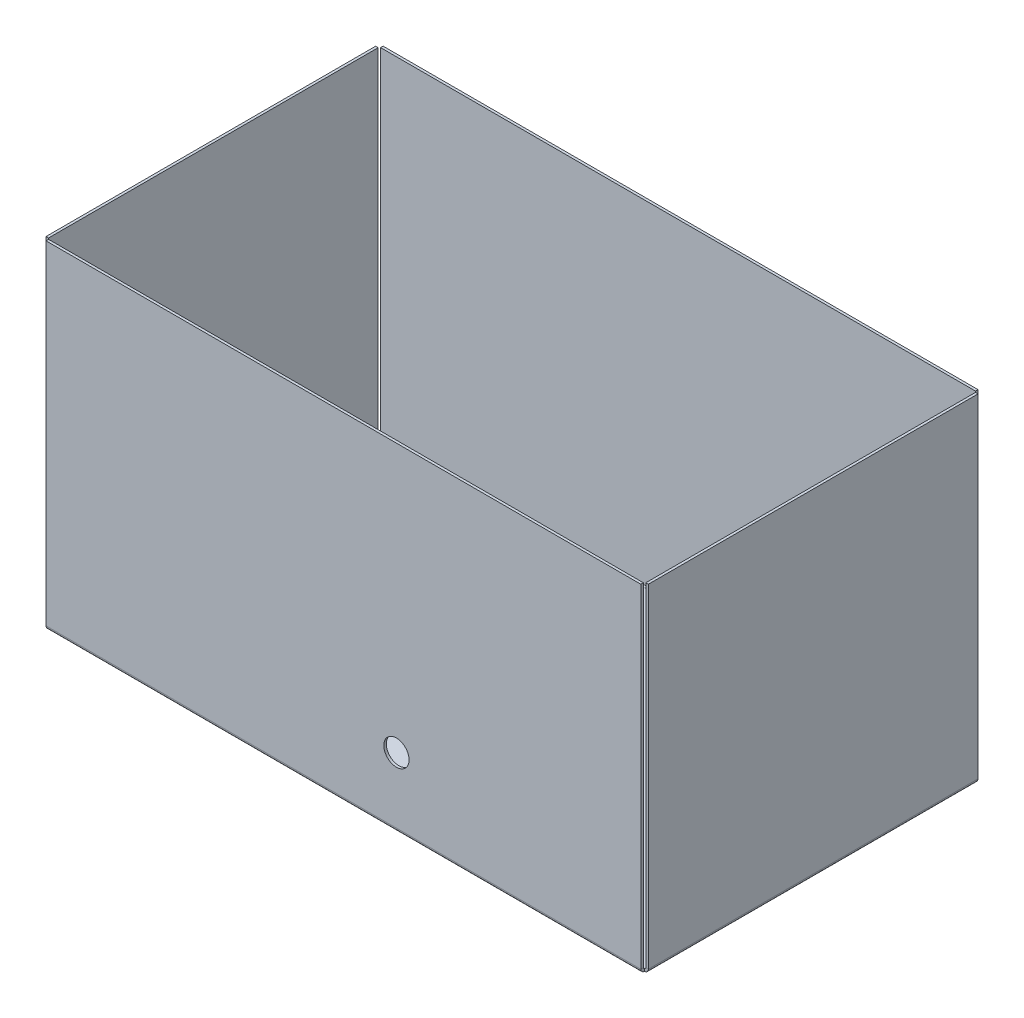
ISO-10303-21;
HEADER;
FILE_DESCRIPTION(('STEP AP214'),'2;1');
FILE_NAME('part.step','',(''),(''),'','','');
FILE_SCHEMA(('AUTOMOTIVE_DESIGN { 1 0 10303 214 1 1 1 1 }'));
ENDSEC;
DATA;
#1=APPLICATION_CONTEXT('core data for automotive mechanical design processes');
#2=APPLICATION_PROTOCOL_DEFINITION('international standard','automotive_design',2000,#1);
#3=PRODUCT_CONTEXT('',#1,'mechanical');
#4=PRODUCT('Part','Part','',(#3));
#5=PRODUCT_RELATED_PRODUCT_CATEGORY('part','',(#4));
#6=PRODUCT_DEFINITION_FORMATION('','',#4);
#7=PRODUCT_DEFINITION_CONTEXT('part definition',#1,'design');
#8=PRODUCT_DEFINITION('design','',#6,#7);
#9=PRODUCT_DEFINITION_SHAPE('','',#8);
#10=(LENGTH_UNIT() NAMED_UNIT(*) SI_UNIT(.MILLI.,.METRE.));
#11=(NAMED_UNIT(*) PLANE_ANGLE_UNIT() SI_UNIT($,.RADIAN.));
#12=(NAMED_UNIT(*) SI_UNIT($,.STERADIAN.) SOLID_ANGLE_UNIT());
#13=UNCERTAINTY_MEASURE_WITH_UNIT(LENGTH_MEASURE(1.E-05),#10,'distance_accuracy_value','');
#14=(GEOMETRIC_REPRESENTATION_CONTEXT(3) GLOBAL_UNCERTAINTY_ASSIGNED_CONTEXT((#13)) GLOBAL_UNIT_ASSIGNED_CONTEXT((#10,
#11,#12)) REPRESENTATION_CONTEXT('',''));
#15=CARTESIAN_POINT('',(0.,0.,0.));
#16=DIRECTION('',(0.,0.,1.));
#17=DIRECTION('',(1.,0.,0.));
#18=AXIS2_PLACEMENT_3D('',#15,#16,#17);
#19=CARTESIAN_POINT('',(-178.65,1.5,100.));
#20=DIRECTION('',(0.,1.,0.));
#21=DIRECTION('',(0.,0.,1.));
#22=AXIS2_PLACEMENT_3D('',#19,#20,#21);
#23=PLANE('',#22);
#24=DIRECTION('',(0.,0.,1.));
#25=VECTOR('',#24,1.);
#26=CARTESIAN_POINT('',(-176.4134,1.5,97.7928932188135));
#27=LINE('',#26,#25);
#28=CARTESIAN_POINT('',(-176.4134,1.5,97.7634));
#29=VERTEX_POINT('',#28);
#30=CARTESIAN_POINT('',(-176.4134,1.5,-97.7634));
#31=VERTEX_POINT('',#30);
#32=EDGE_CURVE('E518',#29,#31,#27,.F.);
#33=ORIENTED_EDGE('',*,*,#32,.F.);
#34=DIRECTION('',(1.,0.,0.));
#35=VECTOR('',#34,1.);
#36=CARTESIAN_POINT('',(176.442893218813,1.50000000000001,97.7634));
#37=LINE('',#36,#35);
#38=CARTESIAN_POINT('',(176.4134,1.5,97.7634));
#39=VERTEX_POINT('',#38);
#40=EDGE_CURVE('E279',#39,#29,#37,.F.);
#41=ORIENTED_EDGE('',*,*,#40,.F.);
#42=DIRECTION('',(0.,0.,-1.));
#43=VECTOR('',#42,1.);
#44=CARTESIAN_POINT('',(176.4134,1.5,-97.7928932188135));
#45=LINE('',#44,#43);
#46=CARTESIAN_POINT('',(176.4134,1.5,-97.7634));
#47=VERTEX_POINT('',#46);
#48=EDGE_CURVE('E131',#47,#39,#45,.F.);
#49=ORIENTED_EDGE('',*,*,#48,.F.);
#50=DIRECTION('',(-1.,0.,0.));
#51=VECTOR('',#50,1.);
#52=CARTESIAN_POINT('',(-176.442893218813,1.5,-97.7634));
#53=LINE('',#52,#51);
#54=EDGE_CURVE('E126',#31,#47,#53,.F.);
#55=ORIENTED_EDGE('',*,*,#54,.F.);
#56=EDGE_LOOP('',(#33,#41,#49,#55));
#57=FACE_BOUND('',#56,.T.);
#58=ADVANCED_FACE('F112',(#57),#23,.T.);
#59=CARTESIAN_POINT('',(-178.65,0.,100.));
#60=DIRECTION('',(0.,1.,0.));
#61=DIRECTION('',(0.,0.,1.));
#62=AXIS2_PLACEMENT_3D('',#59,#60,#61);
#63=PLANE('',#62);
#64=DIRECTION('',(1.,0.,0.));
#65=VECTOR('',#64,1.);
#66=CARTESIAN_POINT('',(176.442893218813,0.,97.7634));
#67=LINE('',#66,#65);
#68=CARTESIAN_POINT('',(176.4134,0.,97.7634));
#69=VERTEX_POINT('',#68);
#70=CARTESIAN_POINT('',(-176.4134,0.,97.7634));
#71=VERTEX_POINT('',#70);
#72=EDGE_CURVE('E289',#69,#71,#67,.F.);
#73=ORIENTED_EDGE('',*,*,#72,.T.);
#74=DIRECTION('',(0.,0.,1.));
#75=VECTOR('',#74,1.);
#76=CARTESIAN_POINT('',(-176.4134,0.,97.7928932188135));
#77=LINE('',#76,#75);
#78=CARTESIAN_POINT('',(-176.4134,0.,-97.7634));
#79=VERTEX_POINT('',#78);
#80=EDGE_CURVE('E526',#71,#79,#77,.F.);
#81=ORIENTED_EDGE('',*,*,#80,.T.);
#82=DIRECTION('',(-1.,0.,0.));
#83=VECTOR('',#82,1.);
#84=CARTESIAN_POINT('',(-176.442893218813,0.,-97.7634));
#85=LINE('',#84,#83);
#86=CARTESIAN_POINT('',(176.4134,0.,-97.7634));
#87=VERTEX_POINT('',#86);
#88=EDGE_CURVE('E445',#79,#87,#85,.F.);
#89=ORIENTED_EDGE('',*,*,#88,.T.);
#90=DIRECTION('',(0.,0.,-1.));
#91=VECTOR('',#90,1.);
#92=CARTESIAN_POINT('',(176.4134,0.,-97.7928932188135));
#93=LINE('',#92,#91);
#94=EDGE_CURVE('E365',#87,#69,#93,.F.);
#95=ORIENTED_EDGE('',*,*,#94,.T.);
#96=EDGE_LOOP('',(#73,#81,#89,#95));
#97=FACE_BOUND('',#96,.T.);
#98=ADVANCED_FACE('F588',(#97),#63,.F.);
#99=CARTESIAN_POINT('',(-176.4134,-0.0149999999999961,-97.7634));
#100=CARTESIAN_POINT('',(-176.708186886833,-0.0149999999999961,-97.7658582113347));
#101=CARTESIAN_POINT('',(-177.002751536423,0.0436031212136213,-97.7683155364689));
#102=CARTESIAN_POINT('',(-177.547348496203,0.269182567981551,-97.7732310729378));
#103=CARTESIAN_POINT('',(-177.797113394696,0.43607013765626,-97.7756888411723));
#104=CARTESIAN_POINT('',(-178.213929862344,0.852886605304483,-97.7806043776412));
#105=CARTESIAN_POINT('',(-178.380817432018,1.10265150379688,-97.7830621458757));
#106=CARTESIAN_POINT('',(-178.606396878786,1.64724846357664,-97.7879776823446));
#107=CARTESIAN_POINT('',(-178.665,1.94181311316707,-97.7904350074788));
#108=CARTESIAN_POINT('',(-178.665,2.2366,-97.7928932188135));
#109=CARTESIAN_POINT('',(-176.4134,0.,-97.7634));
#110=CARTESIAN_POINT('',(-176.706223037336,0.,-97.7658582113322));
#111=CARTESIAN_POINT('',(-176.998825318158,0.058212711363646,-97.7683155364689));
#112=CARTESIAN_POINT('',(-177.539794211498,0.282289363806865,-97.7732310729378));
#113=CARTESIAN_POINT('',(-177.787895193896,0.448065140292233,-97.7756888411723));
#114=CARTESIAN_POINT('',(-178.201934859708,0.862104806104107,-97.7806043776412));
#115=CARTESIAN_POINT('',(-178.367710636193,1.11020578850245,-97.7830621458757));
#116=CARTESIAN_POINT('',(-178.591787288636,1.65117468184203,-97.7879776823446));
#117=CARTESIAN_POINT('',(-178.65,1.94377696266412,-97.7904350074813));
#118=CARTESIAN_POINT('',(-178.65,2.2366,-97.7928932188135));
#119=CARTESIAN_POINT('',(-176.4134,1.5,-97.7634));
#120=CARTESIAN_POINT('',(-176.509838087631,1.5,-97.7658582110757));
#121=CARTESIAN_POINT('',(-176.606203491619,1.51917172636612,-97.7683155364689));
#122=CARTESIAN_POINT('',(-176.784365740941,1.59296894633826,-97.7732310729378));
#123=CARTESIAN_POINT('',(-176.866075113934,1.6475654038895,-97.7756888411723));
#124=CARTESIAN_POINT('',(-177.002434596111,1.78392488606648,-97.7806043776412));
#125=CARTESIAN_POINT('',(-177.057031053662,1.8656342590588,-97.7830621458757));
#126=CARTESIAN_POINT('',(-177.130828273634,2.04379650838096,-97.7879776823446));
#127=CARTESIAN_POINT('',(-177.15,2.14016191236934,-97.7904350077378));
#128=CARTESIAN_POINT('',(-177.15,2.23660000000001,-97.7928932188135));
#129=CARTESIAN_POINT('',(-176.4134,1.51515,-97.7634));
#130=CARTESIAN_POINT('',(-176.507854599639,1.51515,-97.7658582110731));
#131=CARTESIAN_POINT('',(-176.602238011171,1.53392741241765,-97.7683155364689));
#132=CARTESIAN_POINT('',(-176.776735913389,1.60620681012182,-97.7732310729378));
#133=CARTESIAN_POINT('',(-176.856764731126,1.65968035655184,-97.7756888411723));
#134=CARTESIAN_POINT('',(-176.990319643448,1.7932352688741,-97.7806043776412));
#135=CARTESIAN_POINT('',(-177.043793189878,1.87326408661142,-97.7830621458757));
#136=CARTESIAN_POINT('',(-177.116072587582,2.047761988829,-97.7879776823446));
#137=CARTESIAN_POINT('',(-177.13485,2.14214540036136,-97.7904350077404));
#138=CARTESIAN_POINT('',(-177.13485,2.23660000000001,-97.7928932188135));
#139=B_SPLINE_SURFACE_WITH_KNOTS('',1,3,((#99,#100,#101,#102,#103,#104,#105,#106,#107,#108),
(#109,#110,#111,#112,#113,#114,#115,#116,#117,#118),(#119,#120,#121,#122,#123,#124,#125,#126,
#127,#128),(#129,#130,#131,#132,#133,#134,#135,#136,#137,#138)),.UNSPECIFIED.,.F.,.F.,.F.,(2,1,
1,2),(4,2,2,2,4),(-0.01,0.,1.,1.0101),(0.,0.25,0.5,0.75,1.),.UNSPECIFIED.);
#140=DIRECTION('',(1.,0.,0.));
#141=VECTOR('',#140,1.);
#142=CARTESIAN_POINT('',(-177.15,2.23660000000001,-97.7928932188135));
#143=LINE('',#142,#141);
#144=CARTESIAN_POINT('',(-178.65,2.2366,-97.7928932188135));
#145=VERTEX_POINT('',#144);
#146=CARTESIAN_POINT('',(-177.15,2.23660000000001,-97.7928932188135));
#147=VERTEX_POINT('',#146);
#148=EDGE_CURVE('E493',#145,#147,#143,.T.);
#149=CARTESIAN_POINT('',(-176.4134,1.5,-97.7634));
#150=CARTESIAN_POINT('',(-176.425452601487,1.49999974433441,-97.7637072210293));
#151=CARTESIAN_POINT('',(-176.437505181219,1.50029580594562,-97.7640144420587));
#152=CARTESIAN_POINT('',(-176.4615813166,1.50147872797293,-97.7646288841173));
#153=CARTESIAN_POINT('',(-176.473604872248,1.50236558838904,-97.7649361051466));
#154=CARTESIAN_POINT('',(-176.497593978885,1.50472827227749,-97.7655505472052));
#155=CARTESIAN_POINT('',(-176.509559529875,1.50620409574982,-97.7658577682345));
#156=CARTESIAN_POINT('',(-176.533403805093,1.50974106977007,-97.7664722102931));
#157=CARTESIAN_POINT('',(-176.545282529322,1.511802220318,-97.7667794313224));
#158=CARTESIAN_POINT('',(-176.568924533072,1.51650490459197,-97.767393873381));
#159=CARTESIAN_POINT('',(-176.580687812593,1.51914643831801,-97.7677010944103));
#160=CARTESIAN_POINT('',(-176.60407058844,1.5250035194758,-97.7683155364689));
#161=CARTESIAN_POINT('',(-176.615690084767,1.52821906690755,-97.7686227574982));
#162=CARTESIAN_POINT('',(-176.638757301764,1.53521643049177,-97.7692371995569));
#163=CARTESIAN_POINT('',(-176.650205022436,1.53899824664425,-97.7695444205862));
#164=CARTESIAN_POINT('',(-176.672901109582,1.54711903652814,-97.7701588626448));
#165=CARTESIAN_POINT('',(-176.684149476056,1.55145801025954,-97.7704660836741));
#166=CARTESIAN_POINT('',(-176.706419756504,1.56068266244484,-97.7710805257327));
#167=CARTESIAN_POINT('',(-176.717441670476,1.56556834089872,-97.771387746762));
#168=CARTESIAN_POINT('',(-176.739232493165,1.57587463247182,-97.7720021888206));
#169=CARTESIAN_POINT('',(-176.750001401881,1.58129524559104,-97.7723094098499));
#170=CARTESIAN_POINT('',(-176.771260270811,1.59265834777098,-97.7729238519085));
#171=CARTESIAN_POINT('',(-176.781750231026,1.59860083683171,-97.7732310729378));
#172=CARTESIAN_POINT('',(-176.80242593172,1.6109933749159,-97.7738455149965));
#173=CARTESIAN_POINT('',(-176.8126116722,1.61744342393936,-97.7741527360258));
#174=CARTESIAN_POINT('',(-176.832654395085,1.63083554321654,-97.7747671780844));
#175=CARTESIAN_POINT('',(-176.842511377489,1.63777761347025,-97.7750743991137));
#176=CARTESIAN_POINT('',(-176.861872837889,1.65213705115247,-97.7756888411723));
#177=CARTESIAN_POINT('',(-176.871377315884,1.65955441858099,-97.7759960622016));
#178=CARTESIAN_POINT('',(-176.890010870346,1.67484658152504,-97.7766105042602));
#179=CARTESIAN_POINT('',(-176.899139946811,1.68272137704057,-97.7769177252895));
#180=CARTESIAN_POINT('',(-176.917000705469,1.69890942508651,-97.7775321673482));
#181=CARTESIAN_POINT('',(-176.925732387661,1.70722267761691,-97.7778393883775));
#182=CARTESIAN_POINT('',(-176.942777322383,1.72426761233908,-97.778453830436));
#183=CARTESIAN_POINT('',(-176.951090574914,1.73299929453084,-97.7787610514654));
#184=CARTESIAN_POINT('',(-176.967278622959,1.75086005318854,-97.779375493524));
#185=CARTESIAN_POINT('',(-176.975153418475,1.75998912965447,-97.7796827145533));
#186=CARTESIAN_POINT('',(-176.990445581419,1.77862268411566,-97.7802971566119));
#187=CARTESIAN_POINT('',(-176.997862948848,1.78812716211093,-97.7806043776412));
#188=CARTESIAN_POINT('',(-177.01222238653,1.80748862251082,-97.7812188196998));
#189=CARTESIAN_POINT('',(-177.019164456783,1.81734560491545,-97.7815260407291));
#190=CARTESIAN_POINT('',(-177.032556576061,1.83738832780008,-97.7821404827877));
#191=CARTESIAN_POINT('',(-177.039006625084,1.84757406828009,-97.782447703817));
#192=CARTESIAN_POINT('',(-177.051399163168,1.86824976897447,-97.7830621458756));
#193=CARTESIAN_POINT('',(-177.057341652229,1.87873972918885,-97.783369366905));
#194=CARTESIAN_POINT('',(-177.068704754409,1.89999859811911,-97.7839838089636));
#195=CARTESIAN_POINT('',(-177.074125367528,1.91076750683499,-97.7842910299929));
#196=CARTESIAN_POINT('',(-177.084431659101,1.93255832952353,-97.7849054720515));
#197=CARTESIAN_POINT('',(-177.089317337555,1.94358024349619,-97.7852126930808));
#198=CARTESIAN_POINT('',(-177.09854198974,1.96585052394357,-97.7858271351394));
#199=CARTESIAN_POINT('',(-177.102880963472,1.9770988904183,-97.7861343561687));
#200=CARTESIAN_POINT('',(-177.111001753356,1.99979497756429,-97.7867487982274));
#201=CARTESIAN_POINT('',(-177.114783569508,2.01124269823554,-97.7870560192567));
#202=CARTESIAN_POINT('',(-177.121780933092,2.03430991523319,-97.7876704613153));
#203=CARTESIAN_POINT('',(-177.124996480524,2.04592941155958,-97.7879776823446));
#204=CARTESIAN_POINT('',(-177.130853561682,2.06931218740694,-97.7885921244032));
#205=CARTESIAN_POINT('',(-177.133495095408,2.0810754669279,-97.7888993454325));
#206=CARTESIAN_POINT('',(-177.138197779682,2.10471747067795,-97.7895137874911));
#207=CARTESIAN_POINT('',(-177.14025893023,2.11659619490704,-97.7898210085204));
#208=CARTESIAN_POINT('',(-177.14379590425,2.14044047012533,-97.790435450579));
#209=CARTESIAN_POINT('',(-177.145271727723,2.15240602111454,-97.7907426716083));
#210=CARTESIAN_POINT('',(-177.147634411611,2.17639512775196,-97.791357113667));
#211=CARTESIAN_POINT('',(-177.148521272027,2.18841868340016,-97.7916643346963));
#212=CARTESIAN_POINT('',(-177.149704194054,2.2124948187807,-97.7922787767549));
#213=CARTESIAN_POINT('',(-177.150000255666,2.22454739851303,-97.7925859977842));
#214=CARTESIAN_POINT('',(-177.15,2.23660000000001,-97.7928932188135));
#215=B_SPLINE_CURVE_WITH_KNOTS('',3,(#149,#150,#151,#152,#153,#154,#155,#156,#157,#158,#159,
#160,#161,#162,#163,#164,#165,#166,#167,#168,#169,#170,#171,#172,#173,#174,#175,#176,#177,#178,
#179,#180,#181,#182,#183,#184,#185,#186,#187,#188,#189,#190,#191,#192,#193,#194,#195,#196,#197,
#198,#199,#200,#201,#202,#203,#204,#205,#206,#207,#208,#209,#210,#211,#212,#213,#214),
.UNSPECIFIED.,.F.,.F.,(4,2,2,2,2,2,2,2,2,2,2,2,2,2,2,2,2,2,2,2,2,2,2,2,2,2,2,2,2,2,2,2,4),(0.,
0.0361658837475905,0.0723317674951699,0.10849765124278,0.144663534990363,0.180829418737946,
0.216995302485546,0.253161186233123,0.289327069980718,0.325492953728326,0.361658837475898,
0.397824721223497,0.433990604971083,0.470156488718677,0.506322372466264,0.542488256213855,
0.578654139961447,0.614820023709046,0.650985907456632,0.687151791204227,0.723317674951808,
0.759483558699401,0.795649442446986,0.831815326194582,0.867981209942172,0.904147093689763,
0.940312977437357,0.976478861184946,1.01264474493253,1.04881062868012,1.08497651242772,
1.12114239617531,1.1573082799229),.UNSPECIFIED.);
#216=EDGE_CURVE('E520',#31,#147,#215,.T.);
#217=DIRECTION('',(0.,-1.,0.));
#218=VECTOR('',#217,1.);
#219=CARTESIAN_POINT('',(-176.4134,1.5,-97.7634));
#220=LINE('',#219,#218);
#221=EDGE_CURVE('E13',#31,#79,#220,.T.);
#222=CARTESIAN_POINT('',(-176.4134,0.,-97.7634));
#223=CARTESIAN_POINT('',(-176.449996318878,-7.76298750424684E-07,-97.7637072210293));
#224=CARTESIAN_POINT('',(-176.486592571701,0.000898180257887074,-97.7640144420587));
#225=CARTESIAN_POINT('',(-176.5596969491,0.00448998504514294,-97.7646288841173));
#226=CARTESIAN_POINT('',(-176.596205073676,0.00718283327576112,-97.7649361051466));
#227=CARTESIAN_POINT('',(-176.669045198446,0.0143568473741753,-97.7655505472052));
#228=CARTESIAN_POINT('',(-176.705377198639,0.0188380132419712,-97.7658577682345));
#229=CARTESIAN_POINT('',(-176.777777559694,0.0295776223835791,-97.7664722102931));
#230=CARTESIAN_POINT('',(-176.813845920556,0.0358360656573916,-97.7667794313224));
#231=CARTESIAN_POINT('',(-176.885632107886,0.0501152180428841,-97.767393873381));
#232=CARTESIAN_POINT('',(-176.921349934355,0.0581359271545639,-97.7677010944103));
#233=CARTESIAN_POINT('',(-176.992349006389,0.0759202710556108,-97.7683155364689));
#234=CARTESIAN_POINT('',(-177.027630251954,0.0856839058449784,-97.7686227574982));
#235=CARTESIAN_POINT('',(-177.09767116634,0.10693058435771,-97.7692371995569));
#236=CARTESIAN_POINT('',(-177.132430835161,0.118413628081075,-97.7695444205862));
#237=CARTESIAN_POINT('',(-177.201344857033,0.143071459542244,-97.7701588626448));
#238=CARTESIAN_POINT('',(-177.235499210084,0.156246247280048,-97.7704660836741));
#239=CARTESIAN_POINT('',(-177.303120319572,0.184255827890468,-97.7710805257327));
#240=CARTESIAN_POINT('',(-177.336587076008,0.199090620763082,-97.771387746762));
#241=CARTESIAN_POINT('',(-177.402752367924,0.230384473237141,-97.7720021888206));
#242=CARTESIAN_POINT('',(-177.435450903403,0.246843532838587,-97.7723094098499));
#243=CARTESIAN_POINT('',(-177.500000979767,0.281346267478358,-97.7729238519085));
#244=CARTESIAN_POINT('',(-177.531852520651,0.299389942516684,-97.7732310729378));
#245=CARTESIAN_POINT('',(-177.594631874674,0.337018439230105,-97.7738455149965));
#246=CARTESIAN_POINT('',(-177.625559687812,0.3566032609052,-97.7741527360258));
#247=CARTESIAN_POINT('',(-177.686417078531,0.39726686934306,-97.7747671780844));
#248=CARTESIAN_POINT('',(-177.716346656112,0.418345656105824,-97.7750743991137));
#249=CARTESIAN_POINT('',(-177.775135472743,0.461946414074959,-97.7756888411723));
#250=CARTESIAN_POINT('',(-177.803994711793,0.48446838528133,-97.7759960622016));
#251=CARTESIAN_POINT('',(-177.860573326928,0.530901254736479,-97.7766105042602));
#252=CARTESIAN_POINT('',(-177.888292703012,0.554812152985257,-97.7769177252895));
#253=CARTESIAN_POINT('',(-177.94252481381,0.60396527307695,-97.7775321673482));
#254=CARTESIAN_POINT('',(-177.969037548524,0.629207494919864,-97.7778393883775));
#255=CARTESIAN_POINT('',(-178.02079250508,0.680962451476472,-97.778453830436));
#256=CARTESIAN_POINT('',(-178.046034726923,0.707475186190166,-97.7787610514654));
#257=CARTESIAN_POINT('',(-178.095187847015,0.761707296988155,-97.779375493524));
#258=CARTESIAN_POINT('',(-178.119098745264,0.78942667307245,-97.7796827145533));
#259=CARTESIAN_POINT('',(-178.165531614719,0.846005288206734,-97.7802971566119));
#260=CARTESIAN_POINT('',(-178.188053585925,0.874864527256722,-97.7806043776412));
#261=CARTESIAN_POINT('',(-178.231654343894,0.933653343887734,-97.7812188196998));
#262=CARTESIAN_POINT('',(-178.252733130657,0.963582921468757,-97.7815260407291));
#263=CARTESIAN_POINT('',(-178.293396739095,1.02444031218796,-97.7821404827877));
#264=CARTESIAN_POINT('',(-178.31298156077,1.05536812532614,-97.782447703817));
#265=CARTESIAN_POINT('',(-178.350610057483,1.11814747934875,-97.7830621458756));
#266=CARTESIAN_POINT('',(-178.368653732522,1.14999902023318,-97.783369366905));
#267=CARTESIAN_POINT('',(-178.403156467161,1.21454909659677,-97.7839838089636));
#268=CARTESIAN_POINT('',(-178.419615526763,1.24724763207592,-97.7842910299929));
#269=CARTESIAN_POINT('',(-178.450909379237,1.31341292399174,-97.7849054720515));
#270=CARTESIAN_POINT('',(-178.46574417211,1.3468796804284,-97.7852126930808));
#271=CARTESIAN_POINT('',(-178.49375375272,1.41450078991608,-97.7858271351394));
#272=CARTESIAN_POINT('',(-178.506928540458,1.4486551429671,-97.7861343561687));
#273=CARTESIAN_POINT('',(-178.531586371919,1.51756916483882,-97.7867487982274));
#274=CARTESIAN_POINT('',(-178.543069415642,1.55232883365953,-97.7870560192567));
#275=CARTESIAN_POINT('',(-178.564316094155,1.62236974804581,-97.7876704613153));
#276=CARTESIAN_POINT('',(-178.574079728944,1.6576509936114,-97.7879776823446));
#277=CARTESIAN_POINT('',(-178.591864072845,1.72865006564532,-97.7885921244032));
#278=CARTESIAN_POINT('',(-178.599884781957,1.76436789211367,-97.7888993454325));
#279=CARTESIAN_POINT('',(-178.614163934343,1.83615407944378,-97.7895137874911));
#280=CARTESIAN_POINT('',(-178.620422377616,1.87222244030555,-97.7898210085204));
#281=CARTESIAN_POINT('',(-178.631161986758,1.94462280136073,-97.790435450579));
#282=CARTESIAN_POINT('',(-178.635643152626,1.98095480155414,-97.7907426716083));
#283=CARTESIAN_POINT('',(-178.642817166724,2.05379492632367,-97.791357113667));
#284=CARTESIAN_POINT('',(-178.645510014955,2.09030305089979,-97.7916643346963));
#285=CARTESIAN_POINT('',(-178.649101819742,2.1634074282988,-97.7922787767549));
#286=CARTESIAN_POINT('',(-178.650000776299,2.20000368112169,-97.7925859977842));
#287=CARTESIAN_POINT('',(-178.65,2.2366,-97.7928932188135));
#288=B_SPLINE_CURVE_WITH_KNOTS('',3,(#222,#223,#224,#225,#226,#227,#228,#229,#230,#231,#232,
#233,#234,#235,#236,#237,#238,#239,#240,#241,#242,#243,#244,#245,#246,#247,#248,#249,#250,#251,
#252,#253,#254,#255,#256,#257,#258,#259,#260,#261,#262,#263,#264,#265,#266,#267,#268,#269,#270,
#271,#272,#273,#274,#275,#276,#277,#278,#279,#280,#281,#282,#283,#284,#285,#286,#287),
.UNSPECIFIED.,.F.,.F.,(4,2,2,2,2,2,2,2,2,2,2,2,2,2,2,2,2,2,2,2,2,2,2,2,2,2,2,2,2,2,2,2,4),(0.,
0.109781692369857,0.219563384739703,0.32934507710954,0.439126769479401,0.548908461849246,
0.658690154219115,0.768471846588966,0.878253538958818,0.988035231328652,1.09781692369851,
1.20759861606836,1.31738030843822,1.42716200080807,1.53694369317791,1.64672538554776,
1.75650707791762,1.86628877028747,1.97607046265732,2.08585215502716,2.19563384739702,
2.30541553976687,2.41519723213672,2.52497892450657,2.63476061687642,2.74454230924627,
2.85432400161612,2.96410569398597,3.07388738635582,3.18366907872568,3.29345077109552,
3.40323246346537,3.51301415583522),.UNSPECIFIED.);
#289=EDGE_CURVE('E551',#79,#145,#288,.T.);
#290=ORIENTED_EDGE('',*,*,#148,.T.);
#291=ORIENTED_EDGE('',*,*,#216,.F.);
#292=ORIENTED_EDGE('',*,*,#221,.T.);
#293=ORIENTED_EDGE('',*,*,#289,.T.);
#294=EDGE_LOOP('',(#290,#291,#292,#293));
#295=FACE_BOUND('',#294,.T.);
#296=ADVANCED_FACE('F594',(#295),#139,.F.);
#297=CARTESIAN_POINT('',(-178.665,2.2366,97.7928932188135));
#298=CARTESIAN_POINT('',(-178.665,1.94181311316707,97.7904350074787));
#299=CARTESIAN_POINT('',(-178.606396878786,1.64724846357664,97.7879776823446));
#300=CARTESIAN_POINT('',(-178.380817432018,1.10265150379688,97.7830621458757));
#301=CARTESIAN_POINT('',(-178.213929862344,0.852886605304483,97.7806043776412));
#302=CARTESIAN_POINT('',(-177.797113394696,0.43607013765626,97.7756888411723));
#303=CARTESIAN_POINT('',(-177.547348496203,0.269182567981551,97.7732310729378));
#304=CARTESIAN_POINT('',(-177.002751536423,0.0436031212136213,97.7683155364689));
#305=CARTESIAN_POINT('',(-176.708186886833,-0.0149999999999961,97.7658582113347));
#306=CARTESIAN_POINT('',(-176.4134,-0.0149999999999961,97.7634));
#307=CARTESIAN_POINT('',(-178.65,2.2366,97.7928932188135));
#308=CARTESIAN_POINT('',(-178.65,1.94377696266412,97.7904350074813));
#309=CARTESIAN_POINT('',(-178.591787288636,1.65117468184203,97.7879776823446));
#310=CARTESIAN_POINT('',(-178.367710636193,1.11020578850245,97.7830621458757));
#311=CARTESIAN_POINT('',(-178.201934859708,0.862104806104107,97.7806043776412));
#312=CARTESIAN_POINT('',(-177.787895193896,0.448065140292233,97.7756888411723));
#313=CARTESIAN_POINT('',(-177.539794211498,0.282289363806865,97.7732310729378));
#314=CARTESIAN_POINT('',(-176.998825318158,0.058212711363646,97.7683155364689));
#315=CARTESIAN_POINT('',(-176.706223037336,0.,97.7658582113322));
#316=CARTESIAN_POINT('',(-176.4134,0.,97.7634));
#317=CARTESIAN_POINT('',(-177.15,2.23660000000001,97.7928932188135));
#318=CARTESIAN_POINT('',(-177.15,2.14016191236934,97.7904350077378));
#319=CARTESIAN_POINT('',(-177.130828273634,2.04379650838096,97.7879776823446));
#320=CARTESIAN_POINT('',(-177.057031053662,1.8656342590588,97.7830621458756));
#321=CARTESIAN_POINT('',(-177.002434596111,1.78392488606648,97.7806043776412));
#322=CARTESIAN_POINT('',(-176.866075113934,1.6475654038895,97.7756888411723));
#323=CARTESIAN_POINT('',(-176.784365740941,1.59296894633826,97.7732310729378));
#324=CARTESIAN_POINT('',(-176.606203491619,1.51917172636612,97.7683155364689));
#325=CARTESIAN_POINT('',(-176.509838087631,1.5,97.7658582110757));
#326=CARTESIAN_POINT('',(-176.4134,1.5,97.7634));
#327=CARTESIAN_POINT('',(-177.13485,2.23660000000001,97.7928932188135));
#328=CARTESIAN_POINT('',(-177.13485,2.14214540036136,97.7904350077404));
#329=CARTESIAN_POINT('',(-177.116072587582,2.047761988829,97.7879776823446));
#330=CARTESIAN_POINT('',(-177.043793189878,1.87326408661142,97.7830621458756));
#331=CARTESIAN_POINT('',(-176.990319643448,1.7932352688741,97.7806043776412));
#332=CARTESIAN_POINT('',(-176.856764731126,1.65968035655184,97.7756888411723));
#333=CARTESIAN_POINT('',(-176.776735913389,1.60620681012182,97.7732310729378));
#334=CARTESIAN_POINT('',(-176.602238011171,1.53392741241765,97.7683155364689));
#335=CARTESIAN_POINT('',(-176.507854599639,1.51515,97.7658582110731));
#336=CARTESIAN_POINT('',(-176.4134,1.51515,97.7634));
#337=B_SPLINE_SURFACE_WITH_KNOTS('',1,3,((#297,#298,#299,#300,#301,#302,#303,#304,#305,#306),
(#307,#308,#309,#310,#311,#312,#313,#314,#315,#316),(#317,#318,#319,#320,#321,#322,#323,#324,
#325,#326),(#327,#328,#329,#330,#331,#332,#333,#334,#335,#336)),.UNSPECIFIED.,.F.,.F.,.F.,(2,1,
1,2),(4,2,2,2,4),(-0.01,0.,1.,1.0101),(0.,0.25,0.5,0.75,1.),.UNSPECIFIED.);
#338=CARTESIAN_POINT('',(-177.15,2.23660000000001,97.7928932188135));
#339=CARTESIAN_POINT('',(-177.150000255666,2.22454739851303,97.7925859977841));
#340=CARTESIAN_POINT('',(-177.149704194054,2.2124948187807,97.7922787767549));
#341=CARTESIAN_POINT('',(-177.148521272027,2.18841868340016,97.7916643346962));
#342=CARTESIAN_POINT('',(-177.147634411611,2.17639512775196,97.7913571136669));
#343=CARTESIAN_POINT('',(-177.145271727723,2.15240602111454,97.7907426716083));
#344=CARTESIAN_POINT('',(-177.14379590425,2.14044047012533,97.790435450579));
#345=CARTESIAN_POINT('',(-177.14025893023,2.11659619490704,97.7898210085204));
#346=CARTESIAN_POINT('',(-177.138197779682,2.10471747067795,97.7895137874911));
#347=CARTESIAN_POINT('',(-177.133495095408,2.0810754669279,97.7888993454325));
#348=CARTESIAN_POINT('',(-177.130853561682,2.06931218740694,97.7885921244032));
#349=CARTESIAN_POINT('',(-177.124996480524,2.04592941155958,97.7879776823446));
#350=CARTESIAN_POINT('',(-177.121780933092,2.03430991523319,97.7876704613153));
#351=CARTESIAN_POINT('',(-177.114783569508,2.01124269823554,97.7870560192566));
#352=CARTESIAN_POINT('',(-177.111001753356,1.99979497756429,97.7867487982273));
#353=CARTESIAN_POINT('',(-177.102880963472,1.9770988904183,97.7861343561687));
#354=CARTESIAN_POINT('',(-177.09854198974,1.96585052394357,97.7858271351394));
#355=CARTESIAN_POINT('',(-177.089317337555,1.94358024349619,97.7852126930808));
#356=CARTESIAN_POINT('',(-177.084431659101,1.93255832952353,97.7849054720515));
#357=CARTESIAN_POINT('',(-177.074125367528,1.91076750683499,97.7842910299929));
#358=CARTESIAN_POINT('',(-177.068704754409,1.89999859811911,97.7839838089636));
#359=CARTESIAN_POINT('',(-177.057341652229,1.87873972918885,97.7833693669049));
#360=CARTESIAN_POINT('',(-177.051399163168,1.86824976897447,97.7830621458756));
#361=CARTESIAN_POINT('',(-177.039006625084,1.84757406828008,97.782447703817));
#362=CARTESIAN_POINT('',(-177.032556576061,1.83738832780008,97.7821404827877));
#363=CARTESIAN_POINT('',(-177.019164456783,1.81734560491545,97.7815260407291));
#364=CARTESIAN_POINT('',(-177.01222238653,1.80748862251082,97.7812188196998));
#365=CARTESIAN_POINT('',(-176.997862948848,1.78812716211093,97.7806043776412));
#366=CARTESIAN_POINT('',(-176.990445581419,1.77862268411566,97.7802971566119));
#367=CARTESIAN_POINT('',(-176.975153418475,1.75998912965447,97.7796827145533));
#368=CARTESIAN_POINT('',(-176.967278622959,1.75086005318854,97.779375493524));
#369=CARTESIAN_POINT('',(-176.951090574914,1.73299929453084,97.7787610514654));
#370=CARTESIAN_POINT('',(-176.942777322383,1.72426761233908,97.778453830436));
#371=CARTESIAN_POINT('',(-176.925732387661,1.70722267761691,97.7778393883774));
#372=CARTESIAN_POINT('',(-176.917000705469,1.69890942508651,97.7775321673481));
#373=CARTESIAN_POINT('',(-176.899139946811,1.68272137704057,97.7769177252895));
#374=CARTESIAN_POINT('',(-176.890010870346,1.67484658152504,97.7766105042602));
#375=CARTESIAN_POINT('',(-176.871377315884,1.65955441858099,97.7759960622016));
#376=CARTESIAN_POINT('',(-176.861872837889,1.65213705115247,97.7756888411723));
#377=CARTESIAN_POINT('',(-176.842511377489,1.63777761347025,97.7750743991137));
#378=CARTESIAN_POINT('',(-176.832654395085,1.63083554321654,97.7747671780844));
#379=CARTESIAN_POINT('',(-176.8126116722,1.61744342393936,97.7741527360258));
#380=CARTESIAN_POINT('',(-176.80242593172,1.6109933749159,97.7738455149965));
#381=CARTESIAN_POINT('',(-176.781750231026,1.59860083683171,97.7732310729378));
#382=CARTESIAN_POINT('',(-176.771260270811,1.59265834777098,97.7729238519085));
#383=CARTESIAN_POINT('',(-176.750001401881,1.58129524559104,97.7723094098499));
#384=CARTESIAN_POINT('',(-176.739232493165,1.57587463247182,97.7720021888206));
#385=CARTESIAN_POINT('',(-176.717441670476,1.56556834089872,97.771387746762));
#386=CARTESIAN_POINT('',(-176.706419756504,1.56068266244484,97.7710805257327));
#387=CARTESIAN_POINT('',(-176.684149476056,1.55145801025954,97.7704660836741));
#388=CARTESIAN_POINT('',(-176.672901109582,1.54711903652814,97.7701588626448));
#389=CARTESIAN_POINT('',(-176.650205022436,1.53899824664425,97.7695444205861));
#390=CARTESIAN_POINT('',(-176.638757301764,1.53521643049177,97.7692371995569));
#391=CARTESIAN_POINT('',(-176.615690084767,1.52821906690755,97.7686227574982));
#392=CARTESIAN_POINT('',(-176.60407058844,1.5250035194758,97.7683155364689));
#393=CARTESIAN_POINT('',(-176.580687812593,1.51914643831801,97.7677010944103));
#394=CARTESIAN_POINT('',(-176.568924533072,1.51650490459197,97.767393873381));
#395=CARTESIAN_POINT('',(-176.545282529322,1.511802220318,97.7667794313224));
#396=CARTESIAN_POINT('',(-176.533403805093,1.50974106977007,97.7664722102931));
#397=CARTESIAN_POINT('',(-176.509559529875,1.50620409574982,97.7658577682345));
#398=CARTESIAN_POINT('',(-176.497593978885,1.50472827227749,97.7655505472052));
#399=CARTESIAN_POINT('',(-176.473604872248,1.50236558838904,97.7649361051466));
#400=CARTESIAN_POINT('',(-176.4615813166,1.50147872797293,97.7646288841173));
#401=CARTESIAN_POINT('',(-176.437505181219,1.50029580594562,97.7640144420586));
#402=CARTESIAN_POINT('',(-176.425452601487,1.49999974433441,97.7637072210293));
#403=CARTESIAN_POINT('',(-176.4134,1.5,97.7634));
#404=B_SPLINE_CURVE_WITH_KNOTS('',3,(#338,#339,#340,#341,#342,#343,#344,#345,#346,#347,#348,
#349,#350,#351,#352,#353,#354,#355,#356,#357,#358,#359,#360,#361,#362,#363,#364,#365,#366,#367,
#368,#369,#370,#371,#372,#373,#374,#375,#376,#377,#378,#379,#380,#381,#382,#383,#384,#385,#386,
#387,#388,#389,#390,#391,#392,#393,#394,#395,#396,#397,#398,#399,#400,#401,#402,#403),
.UNSPECIFIED.,.F.,.F.,(4,2,2,2,2,2,2,2,2,2,2,2,2,2,2,2,2,2,2,2,2,2,2,2,2,2,2,2,2,2,2,2,4),(0.,
0.0361658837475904,0.0723317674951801,0.108497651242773,0.144663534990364,0.180829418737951,
0.216995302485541,0.253161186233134,0.289327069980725,0.325492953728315,0.361658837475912,
0.397824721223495,0.433990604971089,0.47015648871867,0.506322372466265,0.54248825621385,
0.57865413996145,0.614820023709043,0.650985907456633,0.68715179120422,0.723317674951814,
0.7594835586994,0.795649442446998,0.831815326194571,0.867981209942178,0.904147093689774,
0.94031297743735,0.976478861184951,1.01264474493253,1.04881062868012,1.08497651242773,
1.12114239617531,1.1573082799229),.UNSPECIFIED.);
#405=CARTESIAN_POINT('',(-177.15,2.23660000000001,97.7928932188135));
#406=VERTEX_POINT('',#405);
#407=EDGE_CURVE('E492',#406,#29,#404,.T.);
#408=DIRECTION('',(-1.,0.,0.));
#409=VECTOR('',#408,1.);
#410=CARTESIAN_POINT('',(-177.15,2.23660000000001,97.7928932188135));
#411=LINE('',#410,#409);
#412=CARTESIAN_POINT('',(-178.65,2.2366,97.7928932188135));
#413=VERTEX_POINT('',#412);
#414=EDGE_CURVE('E489',#413,#406,#411,.F.);
#415=CARTESIAN_POINT('',(-178.65,2.2366,97.7928932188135));
#416=CARTESIAN_POINT('',(-178.650000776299,2.20000368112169,97.7925859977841));
#417=CARTESIAN_POINT('',(-178.649101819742,2.1634074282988,97.7922787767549));
#418=CARTESIAN_POINT('',(-178.645510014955,2.09030305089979,97.7916643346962));
#419=CARTESIAN_POINT('',(-178.642817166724,2.05379492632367,97.7913571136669));
#420=CARTESIAN_POINT('',(-178.635643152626,1.98095480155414,97.7907426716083));
#421=CARTESIAN_POINT('',(-178.631161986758,1.94462280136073,97.790435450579));
#422=CARTESIAN_POINT('',(-178.620422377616,1.87222244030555,97.7898210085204));
#423=CARTESIAN_POINT('',(-178.614163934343,1.83615407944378,97.7895137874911));
#424=CARTESIAN_POINT('',(-178.599884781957,1.76436789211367,97.7888993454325));
#425=CARTESIAN_POINT('',(-178.591864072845,1.72865006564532,97.7885921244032));
#426=CARTESIAN_POINT('',(-178.574079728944,1.6576509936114,97.7879776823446));
#427=CARTESIAN_POINT('',(-178.564316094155,1.62236974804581,97.7876704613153));
#428=CARTESIAN_POINT('',(-178.543069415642,1.55232883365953,97.7870560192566));
#429=CARTESIAN_POINT('',(-178.531586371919,1.51756916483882,97.7867487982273));
#430=CARTESIAN_POINT('',(-178.506928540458,1.4486551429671,97.7861343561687));
#431=CARTESIAN_POINT('',(-178.49375375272,1.41450078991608,97.7858271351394));
#432=CARTESIAN_POINT('',(-178.46574417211,1.3468796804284,97.7852126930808));
#433=CARTESIAN_POINT('',(-178.450909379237,1.31341292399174,97.7849054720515));
#434=CARTESIAN_POINT('',(-178.419615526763,1.24724763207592,97.7842910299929));
#435=CARTESIAN_POINT('',(-178.403156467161,1.21454909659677,97.7839838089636));
#436=CARTESIAN_POINT('',(-178.368653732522,1.14999902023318,97.7833693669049));
#437=CARTESIAN_POINT('',(-178.350610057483,1.11814747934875,97.7830621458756));
#438=CARTESIAN_POINT('',(-178.31298156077,1.05536812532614,97.782447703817));
#439=CARTESIAN_POINT('',(-178.293396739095,1.02444031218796,97.7821404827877));
#440=CARTESIAN_POINT('',(-178.252733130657,0.963582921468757,97.7815260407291));
#441=CARTESIAN_POINT('',(-178.231654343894,0.933653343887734,97.7812188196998));
#442=CARTESIAN_POINT('',(-178.188053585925,0.874864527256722,97.7806043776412));
#443=CARTESIAN_POINT('',(-178.165531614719,0.846005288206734,97.7802971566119));
#444=CARTESIAN_POINT('',(-178.119098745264,0.78942667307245,97.7796827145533));
#445=CARTESIAN_POINT('',(-178.095187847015,0.761707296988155,97.779375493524));
#446=CARTESIAN_POINT('',(-178.046034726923,0.707475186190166,97.7787610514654));
#447=CARTESIAN_POINT('',(-178.02079250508,0.680962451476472,97.778453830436));
#448=CARTESIAN_POINT('',(-177.969037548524,0.629207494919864,97.7778393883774));
#449=CARTESIAN_POINT('',(-177.94252481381,0.60396527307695,97.7775321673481));
#450=CARTESIAN_POINT('',(-177.888292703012,0.554812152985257,97.7769177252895));
#451=CARTESIAN_POINT('',(-177.860573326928,0.530901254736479,97.7766105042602));
#452=CARTESIAN_POINT('',(-177.803994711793,0.48446838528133,97.7759960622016));
#453=CARTESIAN_POINT('',(-177.775135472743,0.461946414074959,97.7756888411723));
#454=CARTESIAN_POINT('',(-177.716346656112,0.418345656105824,97.7750743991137));
#455=CARTESIAN_POINT('',(-177.686417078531,0.39726686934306,97.7747671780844));
#456=CARTESIAN_POINT('',(-177.625559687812,0.3566032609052,97.7741527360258));
#457=CARTESIAN_POINT('',(-177.594631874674,0.337018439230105,97.7738455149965));
#458=CARTESIAN_POINT('',(-177.531852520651,0.299389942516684,97.7732310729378));
#459=CARTESIAN_POINT('',(-177.500000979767,0.281346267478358,97.7729238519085));
#460=CARTESIAN_POINT('',(-177.435450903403,0.246843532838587,97.7723094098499));
#461=CARTESIAN_POINT('',(-177.402752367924,0.230384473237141,97.7720021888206));
#462=CARTESIAN_POINT('',(-177.336587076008,0.199090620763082,97.771387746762));
#463=CARTESIAN_POINT('',(-177.303120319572,0.184255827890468,97.7710805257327));
#464=CARTESIAN_POINT('',(-177.235499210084,0.156246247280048,97.7704660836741));
#465=CARTESIAN_POINT('',(-177.201344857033,0.143071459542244,97.7701588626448));
#466=CARTESIAN_POINT('',(-177.132430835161,0.118413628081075,97.7695444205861));
#467=CARTESIAN_POINT('',(-177.09767116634,0.10693058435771,97.7692371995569));
#468=CARTESIAN_POINT('',(-177.027630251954,0.0856839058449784,97.7686227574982));
#469=CARTESIAN_POINT('',(-176.992349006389,0.0759202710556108,97.7683155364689));
#470=CARTESIAN_POINT('',(-176.921349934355,0.0581359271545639,97.7677010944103));
#471=CARTESIAN_POINT('',(-176.885632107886,0.0501152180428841,97.767393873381));
#472=CARTESIAN_POINT('',(-176.813845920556,0.0358360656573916,97.7667794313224));
#473=CARTESIAN_POINT('',(-176.777777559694,0.0295776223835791,97.7664722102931));
#474=CARTESIAN_POINT('',(-176.705377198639,0.0188380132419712,97.7658577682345));
#475=CARTESIAN_POINT('',(-176.669045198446,0.0143568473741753,97.7655505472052));
#476=CARTESIAN_POINT('',(-176.596205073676,0.00718283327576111,97.7649361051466));
#477=CARTESIAN_POINT('',(-176.5596969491,0.00448998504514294,97.7646288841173));
#478=CARTESIAN_POINT('',(-176.486592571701,0.000898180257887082,97.7640144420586));
#479=CARTESIAN_POINT('',(-176.449996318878,-7.76298750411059E-07,97.7637072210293));
#480=CARTESIAN_POINT('',(-176.4134,0.,97.7634));
#481=B_SPLINE_CURVE_WITH_KNOTS('',3,(#415,#416,#417,#418,#419,#420,#421,#422,#423,#424,#425,
#426,#427,#428,#429,#430,#431,#432,#433,#434,#435,#436,#437,#438,#439,#440,#441,#442,#443,#444,
#445,#446,#447,#448,#449,#450,#451,#452,#453,#454,#455,#456,#457,#458,#459,#460,#461,#462,#463,
#464,#465,#466,#467,#468,#469,#470,#471,#472,#473,#474,#475,#476,#477,#478,#479,#480),
.UNSPECIFIED.,.F.,.F.,(4,2,2,2,2,2,2,2,2,2,2,2,2,2,2,2,2,2,2,2,2,2,2,2,2,2,2,2,2,2,2,2,4),(0.,
0.109781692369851,0.219563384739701,0.32934507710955,0.439126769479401,0.548908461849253,
0.658690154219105,0.768471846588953,0.878253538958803,0.988035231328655,1.09781692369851,
1.20759861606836,1.31738030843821,1.42716200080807,1.53694369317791,1.64672538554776,
1.75650707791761,1.86628877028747,1.97607046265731,2.08585215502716,2.19563384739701,
2.30541553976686,2.41519723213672,2.52497892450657,2.63476061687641,2.74454230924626,
2.85432400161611,2.96410569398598,3.07388738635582,3.18366907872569,3.29345077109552,
3.40323246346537,3.51301415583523),.UNSPECIFIED.);
#482=EDGE_CURVE('E525',#413,#71,#481,.T.);
#483=DIRECTION('',(0.,-1.,0.));
#484=VECTOR('',#483,1.);
#485=CARTESIAN_POINT('',(-176.4134,1.5,97.7634));
#486=LINE('',#485,#484);
#487=EDGE_CURVE('E115',#29,#71,#486,.T.);
#488=ORIENTED_EDGE('',*,*,#407,.F.);
#489=ORIENTED_EDGE('',*,*,#414,.F.);
#490=ORIENTED_EDGE('',*,*,#482,.T.);
#491=ORIENTED_EDGE('',*,*,#487,.F.);
#492=EDGE_LOOP('',(#488,#489,#490,#491));
#493=FACE_BOUND('',#492,.T.);
#494=ADVANCED_FACE('F541',(#493),#337,.F.);
#495=CARTESIAN_POINT('',(-176.4134,2.23660000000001,97.7928932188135));
#496=DIRECTION('',(0.,0.,1.));
#497=DIRECTION('',(-1.,0.,0.));
#498=AXIS2_PLACEMENT_3D('',#495,#496,#497);
#499=CYLINDRICAL_SURFACE('',#498,2.2366);
#500=ORIENTED_EDGE('',*,*,#80,.F.);
#501=ORIENTED_EDGE('',*,*,#482,.F.);
#502=DIRECTION('',(0.,0.,1.));
#503=VECTOR('',#502,1.);
#504=CARTESIAN_POINT('',(-178.65,2.2366,-100.));
#505=LINE('',#504,#503);
#506=EDGE_CURVE('E499',#413,#145,#505,.F.);
#507=ORIENTED_EDGE('',*,*,#506,.T.);
#508=ORIENTED_EDGE('',*,*,#289,.F.);
#509=EDGE_LOOP('',(#500,#501,#507,#508));
#510=FACE_BOUND('',#509,.T.);
#511=ADVANCED_FACE('F539',(#510),#499,.T.);
#512=CARTESIAN_POINT('',(-176.4134,2.23660000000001,97.7928932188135));
#513=DIRECTION('',(0.,0.,1.));
#514=DIRECTION('',(-1.,0.,0.));
#515=AXIS2_PLACEMENT_3D('',#512,#513,#514);
#516=CYLINDRICAL_SURFACE('',#515,0.736600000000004);
#517=ORIENTED_EDGE('',*,*,#32,.T.);
#518=ORIENTED_EDGE('',*,*,#216,.T.);
#519=DIRECTION('',(0.,0.,1.));
#520=VECTOR('',#519,1.);
#521=CARTESIAN_POINT('',(-177.15,2.23660000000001,-100.));
#522=LINE('',#521,#520);
#523=EDGE_CURVE('E501',#147,#406,#522,.T.);
#524=ORIENTED_EDGE('',*,*,#523,.T.);
#525=ORIENTED_EDGE('',*,*,#407,.T.);
#526=EDGE_LOOP('',(#517,#518,#524,#525));
#527=FACE_BOUND('',#526,.T.);
#528=ADVANCED_FACE('F528',(#527),#516,.F.);
#529=CARTESIAN_POINT('',(-177.15,1.5,-97.7928932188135));
#530=DIRECTION('',(0.,0.,-1.));
#531=DIRECTION('',(0.,1.,0.));
#532=AXIS2_PLACEMENT_3D('',#529,#530,#531);
#533=PLANE('',#532);
#534=DIRECTION('',(0.,-1.,0.));
#535=VECTOR('',#534,1.);
#536=CARTESIAN_POINT('',(-178.65,1.49999999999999,-97.7928932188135));
#537=LINE('',#536,#535);
#538=CARTESIAN_POINT('',(-178.650000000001,200.,-97.7928932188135));
#539=VERTEX_POINT('',#538);
#540=EDGE_CURVE('E506',#145,#539,#537,.F.);
#541=ORIENTED_EDGE('',*,*,#540,.T.);
#542=DIRECTION('',(-1.,0.,0.));
#543=VECTOR('',#542,1.);
#544=CARTESIAN_POINT('',(-177.150000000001,200.,-97.7928932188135));
#545=LINE('',#544,#543);
#546=CARTESIAN_POINT('',(-177.150000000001,200.,-97.7928932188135));
#547=VERTEX_POINT('',#546);
#548=EDGE_CURVE('E503',#539,#547,#545,.F.);
#549=ORIENTED_EDGE('',*,*,#548,.T.);
#550=DIRECTION('',(0.,1.,0.));
#551=VECTOR('',#550,1.);
#552=CARTESIAN_POINT('',(-177.150000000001,200.,-97.7928932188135));
#553=LINE('',#552,#551);
#554=EDGE_CURVE('E509',#147,#547,#553,.T.);
#555=ORIENTED_EDGE('',*,*,#554,.F.);
#556=ORIENTED_EDGE('',*,*,#148,.F.);
#557=EDGE_LOOP('',(#541,#549,#555,#556));
#558=FACE_BOUND('',#557,.T.);
#559=ADVANCED_FACE('F538',(#558),#533,.T.);
#560=CARTESIAN_POINT('',(-178.650000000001,200.,-100.));
#561=DIRECTION('',(1.,0.,0.));
#562=DIRECTION('',(0.,1.,0.));
#563=AXIS2_PLACEMENT_3D('',#560,#561,#562);
#564=PLANE('',#563);
#565=ORIENTED_EDGE('',*,*,#506,.F.);
#566=DIRECTION('',(0.,1.,0.));
#567=VECTOR('',#566,1.);
#568=CARTESIAN_POINT('',(-178.650000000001,200.,97.7928932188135));
#569=LINE('',#568,#567);
#570=CARTESIAN_POINT('',(-178.650000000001,200.,97.7928932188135));
#571=VERTEX_POINT('',#570);
#572=EDGE_CURVE('E514',#413,#571,#569,.T.);
#573=ORIENTED_EDGE('',*,*,#572,.T.);
#574=DIRECTION('',(0.,0.,-1.));
#575=VECTOR('',#574,1.);
#576=CARTESIAN_POINT('',(-178.650000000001,200.,-100.));
#577=LINE('',#576,#575);
#578=EDGE_CURVE('E495',#571,#539,#577,.T.);
#579=ORIENTED_EDGE('',*,*,#578,.T.);
#580=ORIENTED_EDGE('',*,*,#540,.F.);
#581=EDGE_LOOP('',(#565,#573,#579,#580));
#582=FACE_BOUND('',#581,.T.);
#583=ADVANCED_FACE('F958',(#582),#564,.F.);
#584=CARTESIAN_POINT('',(-177.150000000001,200.,-100.));
#585=DIRECTION('',(1.,0.,0.));
#586=DIRECTION('',(0.,1.,0.));
#587=AXIS2_PLACEMENT_3D('',#584,#585,#586);
#588=PLANE('',#587);
#589=DIRECTION('',(0.,-1.,0.));
#590=VECTOR('',#589,1.);
#591=CARTESIAN_POINT('',(-177.15,1.5,97.7928932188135));
#592=LINE('',#591,#590);
#593=CARTESIAN_POINT('',(-177.150000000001,200.,97.7928932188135));
#594=VERTEX_POINT('',#593);
#595=EDGE_CURVE('E488',#406,#594,#592,.F.);
#596=ORIENTED_EDGE('',*,*,#595,.F.);
#597=ORIENTED_EDGE('',*,*,#523,.F.);
#598=ORIENTED_EDGE('',*,*,#554,.T.);
#599=DIRECTION('',(0.,0.,1.));
#600=VECTOR('',#599,1.);
#601=CARTESIAN_POINT('',(-177.150000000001,200.,-100.));
#602=LINE('',#601,#600);
#603=EDGE_CURVE('E497',#594,#547,#602,.F.);
#604=ORIENTED_EDGE('',*,*,#603,.F.);
#605=EDGE_LOOP('',(#596,#597,#598,#604));
#606=FACE_BOUND('',#605,.T.);
#607=ADVANCED_FACE('F949',(#606),#588,.T.);
#608=CARTESIAN_POINT('',(-178.650000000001,200.,-100.));
#609=DIRECTION('',(0.,-1.,0.));
#610=DIRECTION('',(1.,0.,0.));
#611=AXIS2_PLACEMENT_3D('',#608,#609,#610);
#612=PLANE('',#611);
#613=ORIENTED_EDGE('',*,*,#578,.F.);
#614=DIRECTION('',(1.,0.,0.));
#615=VECTOR('',#614,1.);
#616=CARTESIAN_POINT('',(-178.650000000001,200.,97.7928932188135));
#617=LINE('',#616,#615);
#618=EDGE_CURVE('E512',#571,#594,#617,.T.);
#619=ORIENTED_EDGE('',*,*,#618,.T.);
#620=ORIENTED_EDGE('',*,*,#603,.T.);
#621=ORIENTED_EDGE('',*,*,#548,.F.);
#622=EDGE_LOOP('',(#613,#619,#620,#621));
#623=FACE_BOUND('',#622,.T.);
#624=ADVANCED_FACE('F542',(#623),#612,.F.);
#625=CARTESIAN_POINT('',(-177.15,1.5,97.7928932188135));
#626=DIRECTION('',(0.,0.,-1.));
#627=DIRECTION('',(0.,1.,0.));
#628=AXIS2_PLACEMENT_3D('',#625,#626,#627);
#629=PLANE('',#628);
#630=ORIENTED_EDGE('',*,*,#618,.F.);
#631=ORIENTED_EDGE('',*,*,#572,.F.);
#632=ORIENTED_EDGE('',*,*,#414,.T.);
#633=ORIENTED_EDGE('',*,*,#595,.T.);
#634=EDGE_LOOP('',(#630,#631,#632,#633));
#635=FACE_BOUND('',#634,.T.);
#636=ADVANCED_FACE('F932',(#635),#629,.F.);
#637=CARTESIAN_POINT('',(176.4134,-0.014999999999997,-97.7634));
#638=CARTESIAN_POINT('',(176.415858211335,-0.014999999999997,-98.058186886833));
#639=CARTESIAN_POINT('',(176.418315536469,0.0436031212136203,-98.3527515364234));
#640=CARTESIAN_POINT('',(176.423231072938,0.26918256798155,-98.8973484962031));
#641=CARTESIAN_POINT('',(176.425688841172,0.436070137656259,-99.1471133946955));
#642=CARTESIAN_POINT('',(176.430604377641,0.852886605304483,-99.5639298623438));
#643=CARTESIAN_POINT('',(176.433062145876,1.10265150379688,-99.7308174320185));
#644=CARTESIAN_POINT('',(176.437977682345,1.64724846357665,-99.9563968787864));
#645=CARTESIAN_POINT('',(176.440435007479,1.94181311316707,-100.015));
#646=CARTESIAN_POINT('',(176.442893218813,2.2366,-100.015));
#647=CARTESIAN_POINT('',(176.4134,0.,-97.7634));
#648=CARTESIAN_POINT('',(176.415858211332,0.,-98.0562230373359));
#649=CARTESIAN_POINT('',(176.418315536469,0.0582127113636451,-98.348825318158));
#650=CARTESIAN_POINT('',(176.423231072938,0.282289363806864,-98.8897942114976));
#651=CARTESIAN_POINT('',(176.425688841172,0.448065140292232,-99.1378951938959));
#652=CARTESIAN_POINT('',(176.430604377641,0.862104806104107,-99.5519348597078));
#653=CARTESIAN_POINT('',(176.433062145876,1.11020578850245,-99.7177106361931));
#654=CARTESIAN_POINT('',(176.437977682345,1.65117468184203,-99.9417872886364));
#655=CARTESIAN_POINT('',(176.440435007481,1.94377696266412,-100.));
#656=CARTESIAN_POINT('',(176.442893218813,2.2366,-100.));
#657=CARTESIAN_POINT('',(176.4134,1.5,-97.7634));
#658=CARTESIAN_POINT('',(176.415858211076,1.5,-97.8598380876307));
#659=CARTESIAN_POINT('',(176.418315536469,1.51917172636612,-97.956203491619));
#660=CARTESIAN_POINT('',(176.423231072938,1.59296894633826,-98.1343657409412));
#661=CARTESIAN_POINT('',(176.425688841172,1.6475654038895,-98.2160751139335));
#662=CARTESIAN_POINT('',(176.430604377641,1.78392488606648,-98.3524345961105));
#663=CARTESIAN_POINT('',(176.433062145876,1.8656342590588,-98.4070310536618));
#664=CARTESIAN_POINT('',(176.437977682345,2.04379650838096,-98.4808282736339));
#665=CARTESIAN_POINT('',(176.440435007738,2.14016191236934,-98.5));
#666=CARTESIAN_POINT('',(176.442893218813,2.23660000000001,-98.5));
#667=CARTESIAN_POINT('',(176.4134,1.51515,-97.7634));
#668=CARTESIAN_POINT('',(176.415858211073,1.51515,-97.8578545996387));
#669=CARTESIAN_POINT('',(176.418315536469,1.53392741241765,-97.952238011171));
#670=CARTESIAN_POINT('',(176.423231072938,1.60620681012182,-98.1267359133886));
#671=CARTESIAN_POINT('',(176.425688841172,1.65968035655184,-98.2067647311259));
#672=CARTESIAN_POINT('',(176.430604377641,1.7932352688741,-98.3403196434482));
#673=CARTESIAN_POINT('',(176.433062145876,1.87326408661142,-98.3937931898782));
#674=CARTESIAN_POINT('',(176.437977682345,2.047761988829,-98.4660725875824));
#675=CARTESIAN_POINT('',(176.44043500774,2.14214540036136,-98.48485));
#676=CARTESIAN_POINT('',(176.442893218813,2.23660000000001,-98.48485));
#677=B_SPLINE_SURFACE_WITH_KNOTS('',1,3,((#637,#638,#639,#640,#641,#642,#643,#644,#645,#646),
(#647,#648,#649,#650,#651,#652,#653,#654,#655,#656),(#657,#658,#659,#660,#661,#662,#663,#664,
#665,#666),(#667,#668,#669,#670,#671,#672,#673,#674,#675,#676)),.UNSPECIFIED.,.F.,.F.,.F.,(2,1,
1,2),(4,2,2,2,4),(-0.01,0.,1.,1.0101),(0.,0.25,0.5,0.75,1.),.UNSPECIFIED.);
#678=DIRECTION('',(0.,0.,1.));
#679=VECTOR('',#678,1.);
#680=CARTESIAN_POINT('',(176.442893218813,2.23660000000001,-98.5));
#681=LINE('',#680,#679);
#682=CARTESIAN_POINT('',(176.442893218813,2.2366,-100.));
#683=VERTEX_POINT('',#682);
#684=CARTESIAN_POINT('',(176.442893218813,2.2366,-98.5));
#685=VERTEX_POINT('',#684);
#686=EDGE_CURVE('E413',#683,#685,#681,.T.);
#687=CARTESIAN_POINT('',(176.4134,1.5,-97.7634));
#688=CARTESIAN_POINT('',(176.413707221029,1.49999974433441,-97.775452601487));
#689=CARTESIAN_POINT('',(176.414014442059,1.50029580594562,-97.7875051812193));
#690=CARTESIAN_POINT('',(176.414628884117,1.50147872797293,-97.8115813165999));
#691=CARTESIAN_POINT('',(176.414936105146,1.50236558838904,-97.8236048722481));
#692=CARTESIAN_POINT('',(176.415550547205,1.50472827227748,-97.8475939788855));
#693=CARTESIAN_POINT('',(176.415857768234,1.50620409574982,-97.8595595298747));
#694=CARTESIAN_POINT('',(176.416472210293,1.50974106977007,-97.883403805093));
#695=CARTESIAN_POINT('',(176.416779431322,1.511802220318,-97.8952825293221));
#696=CARTESIAN_POINT('',(176.417393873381,1.51650490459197,-97.9189245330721));
#697=CARTESIAN_POINT('',(176.41770109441,1.51914643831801,-97.9306878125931));
#698=CARTESIAN_POINT('',(176.418315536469,1.5250035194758,-97.9540705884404));
#699=CARTESIAN_POINT('',(176.418622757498,1.52821906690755,-97.9656900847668));
#700=CARTESIAN_POINT('',(176.419237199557,1.53521643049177,-97.9887573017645));
#701=CARTESIAN_POINT('',(176.419544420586,1.53899824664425,-98.0002050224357));
#702=CARTESIAN_POINT('',(176.420158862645,1.54711903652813,-98.0229011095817));
#703=CARTESIAN_POINT('',(176.420466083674,1.55145801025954,-98.0341494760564));
#704=CARTESIAN_POINT('',(176.421080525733,1.56068266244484,-98.0564197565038));
#705=CARTESIAN_POINT('',(176.421387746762,1.56556834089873,-98.0674416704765));
#706=CARTESIAN_POINT('',(176.422002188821,1.57587463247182,-98.089232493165));
#707=CARTESIAN_POINT('',(176.42230940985,1.58129524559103,-98.1000014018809));
#708=CARTESIAN_POINT('',(176.422923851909,1.59265834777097,-98.1212602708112));
#709=CARTESIAN_POINT('',(176.423231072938,1.59860083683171,-98.1317502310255));
#710=CARTESIAN_POINT('',(176.423845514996,1.6109933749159,-98.1524259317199));
#711=CARTESIAN_POINT('',(176.424152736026,1.61744342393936,-98.1626116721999));
#712=CARTESIAN_POINT('',(176.424767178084,1.63083554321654,-98.1826543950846));
#713=CARTESIAN_POINT('',(176.425074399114,1.63777761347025,-98.1925113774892));
#714=CARTESIAN_POINT('',(176.425688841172,1.65213705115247,-98.2118728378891));
#715=CARTESIAN_POINT('',(176.425996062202,1.65955441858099,-98.2213773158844));
#716=CARTESIAN_POINT('',(176.42661050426,1.67484658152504,-98.2400108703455));
#717=CARTESIAN_POINT('',(176.426917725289,1.68272137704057,-98.2491399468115));
#718=CARTESIAN_POINT('',(176.427532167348,1.69890942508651,-98.2670007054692));
#719=CARTESIAN_POINT('',(176.427839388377,1.70722267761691,-98.2757323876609));
#720=CARTESIAN_POINT('',(176.428453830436,1.72426761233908,-98.2927773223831));
#721=CARTESIAN_POINT('',(176.428761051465,1.73299929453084,-98.3010905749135));
#722=CARTESIAN_POINT('',(176.429375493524,1.75086005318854,-98.3172786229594));
#723=CARTESIAN_POINT('',(176.429682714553,1.75998912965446,-98.325153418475));
#724=CARTESIAN_POINT('',(176.430297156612,1.77862268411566,-98.340445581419));
#725=CARTESIAN_POINT('',(176.430604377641,1.78812716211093,-98.3478629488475));
#726=CARTESIAN_POINT('',(176.4312188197,1.80748862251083,-98.3622223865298));
#727=CARTESIAN_POINT('',(176.431526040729,1.81734560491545,-98.3691644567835));
#728=CARTESIAN_POINT('',(176.432140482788,1.83738832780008,-98.3825565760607));
#729=CARTESIAN_POINT('',(176.432447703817,1.84757406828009,-98.3890066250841));
#730=CARTESIAN_POINT('',(176.433062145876,1.86824976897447,-98.4013991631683));
#731=CARTESIAN_POINT('',(176.433369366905,1.87873972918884,-98.4073416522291));
#732=CARTESIAN_POINT('',(176.433983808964,1.8999985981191,-98.418704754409));
#733=CARTESIAN_POINT('',(176.434291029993,1.91076750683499,-98.4241253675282));
#734=CARTESIAN_POINT('',(176.434905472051,1.93255832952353,-98.4344316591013));
#735=CARTESIAN_POINT('',(176.435212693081,1.94358024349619,-98.4393173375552));
#736=CARTESIAN_POINT('',(176.435827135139,1.96585052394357,-98.4485419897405));
#737=CARTESIAN_POINT('',(176.436134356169,1.9770988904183,-98.4528809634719));
#738=CARTESIAN_POINT('',(176.436748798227,1.99979497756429,-98.4610017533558));
#739=CARTESIAN_POINT('',(176.437056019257,2.01124269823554,-98.4647835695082));
#740=CARTESIAN_POINT('',(176.437670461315,2.03430991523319,-98.4717809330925));
#741=CARTESIAN_POINT('',(176.437977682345,2.04592941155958,-98.4749964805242));
#742=CARTESIAN_POINT('',(176.438592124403,2.06931218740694,-98.480853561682));
#743=CARTESIAN_POINT('',(176.438899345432,2.0810754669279,-98.4834950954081));
#744=CARTESIAN_POINT('',(176.439513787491,2.10471747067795,-98.488197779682));
#745=CARTESIAN_POINT('',(176.43982100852,2.11659619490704,-98.4902589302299));
#746=CARTESIAN_POINT('',(176.440435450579,2.14044047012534,-98.4937959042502));
#747=CARTESIAN_POINT('',(176.440742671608,2.15240602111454,-98.4952717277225));
#748=CARTESIAN_POINT('',(176.441357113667,2.17639512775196,-98.497634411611));
#749=CARTESIAN_POINT('',(176.441664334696,2.18841868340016,-98.4985212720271));
#750=CARTESIAN_POINT('',(176.442278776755,2.2124948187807,-98.4997041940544));
#751=CARTESIAN_POINT('',(176.442585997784,2.22454739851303,-98.5000002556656));
#752=CARTESIAN_POINT('',(176.442893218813,2.23660000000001,-98.5));
#753=B_SPLINE_CURVE_WITH_KNOTS('',3,(#687,#688,#689,#690,#691,#692,#693,#694,#695,#696,#697,
#698,#699,#700,#701,#702,#703,#704,#705,#706,#707,#708,#709,#710,#711,#712,#713,#714,#715,#716,
#717,#718,#719,#720,#721,#722,#723,#724,#725,#726,#727,#728,#729,#730,#731,#732,#733,#734,#735,
#736,#737,#738,#739,#740,#741,#742,#743,#744,#745,#746,#747,#748,#749,#750,#751,#752),
.UNSPECIFIED.,.F.,.F.,(4,2,2,2,2,2,2,2,2,2,2,2,2,2,2,2,2,2,2,2,2,2,2,2,2,2,2,2,2,2,2,2,4),(0.,
0.0361658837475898,0.072331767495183,0.108497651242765,0.144663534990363,0.180829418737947,
0.216995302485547,0.253161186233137,0.289327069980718,0.325492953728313,0.361658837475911,
0.397824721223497,0.433990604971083,0.470156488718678,0.506322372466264,0.542488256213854,
0.578654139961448,0.614820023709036,0.650985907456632,0.68715179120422,0.723317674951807,
0.759483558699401,0.795649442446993,0.831815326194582,0.867981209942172,0.904147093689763,
0.940312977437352,0.976478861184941,1.01264474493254,1.04881062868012,1.08497651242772,
1.12114239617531,1.1573082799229),.UNSPECIFIED.);
#754=EDGE_CURVE('E439',#47,#685,#753,.T.);
#755=DIRECTION('',(0.,-1.,0.));
#756=VECTOR('',#755,1.);
#757=CARTESIAN_POINT('',(176.4134,1.5,-97.7634));
#758=LINE('',#757,#756);
#759=EDGE_CURVE('E480',#47,#87,#758,.T.);
#760=CARTESIAN_POINT('',(176.4134,0.,-97.7634));
#761=CARTESIAN_POINT('',(176.413707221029,-7.76298751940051E-07,-97.7999963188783));
#762=CARTESIAN_POINT('',(176.414014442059,0.000898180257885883,-97.8365925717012));
#763=CARTESIAN_POINT('',(176.414628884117,0.0044899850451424,-97.9096969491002));
#764=CARTESIAN_POINT('',(176.414936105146,0.0071828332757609,-97.9462050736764));
#765=CARTESIAN_POINT('',(176.415550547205,0.0143568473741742,-98.0190451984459));
#766=CARTESIAN_POINT('',(176.415857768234,0.0188380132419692,-98.0553771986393));
#767=CARTESIAN_POINT('',(176.416472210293,0.0295776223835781,-98.1277775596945));
#768=CARTESIAN_POINT('',(176.416779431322,0.0358360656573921,-98.1638459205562));
#769=CARTESIAN_POINT('',(176.417393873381,0.0501152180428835,-98.2356321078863));
#770=CARTESIAN_POINT('',(176.41770109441,0.058135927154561,-98.2713499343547));
#771=CARTESIAN_POINT('',(176.418315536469,0.0759202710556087,-98.3423490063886));
#772=CARTESIAN_POINT('',(176.418622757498,0.0856839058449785,-98.3776302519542));
#773=CARTESIAN_POINT('',(176.419237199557,0.106930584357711,-98.4476711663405));
#774=CARTESIAN_POINT('',(176.419544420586,0.118413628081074,-98.4824308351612));
#775=CARTESIAN_POINT('',(176.420158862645,0.143071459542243,-98.5513448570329));
#776=CARTESIAN_POINT('',(176.420466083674,0.156246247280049,-98.5854992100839));
#777=CARTESIAN_POINT('',(176.421080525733,0.184255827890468,-98.6531203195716));
#778=CARTESIAN_POINT('',(176.421387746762,0.199090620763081,-98.6865870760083));
#779=CARTESIAN_POINT('',(176.422002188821,0.23038447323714,-98.7527523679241));
#780=CARTESIAN_POINT('',(176.42230940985,0.246843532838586,-98.7854509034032));
#781=CARTESIAN_POINT('',(176.422923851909,0.281346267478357,-98.8500009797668));
#782=CARTESIAN_POINT('',(176.423231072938,0.299389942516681,-98.8818525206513));
#783=CARTESIAN_POINT('',(176.423845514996,0.337018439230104,-98.9446318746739));
#784=CARTESIAN_POINT('',(176.424152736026,0.356603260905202,-98.9755596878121));
#785=CARTESIAN_POINT('',(176.424767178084,0.397266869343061,-99.0364170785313));
#786=CARTESIAN_POINT('',(176.425074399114,0.418345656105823,-99.0663466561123));
#787=CARTESIAN_POINT('',(176.425688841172,0.461946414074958,-99.1251354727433));
#788=CARTESIAN_POINT('',(176.425996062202,0.484468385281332,-99.1539947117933));
#789=CARTESIAN_POINT('',(176.42661050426,0.530901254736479,-99.2105733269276));
#790=CARTESIAN_POINT('',(176.426917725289,0.554812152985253,-99.2382927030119));
#791=CARTESIAN_POINT('',(176.427532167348,0.603965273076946,-99.2925248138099));
#792=CARTESIAN_POINT('',(176.427839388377,0.629207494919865,-99.3190375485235));
#793=CARTESIAN_POINT('',(176.428453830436,0.680962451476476,-99.3707925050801));
#794=CARTESIAN_POINT('',(176.428761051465,0.707475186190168,-99.3960347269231));
#795=CARTESIAN_POINT('',(176.429375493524,0.761707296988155,-99.4451878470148));
#796=CARTESIAN_POINT('',(176.429682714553,0.789426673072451,-99.4690987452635));
#797=CARTESIAN_POINT('',(176.430297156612,0.846005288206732,-99.5155316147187));
#798=CARTESIAN_POINT('',(176.430604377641,0.874864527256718,-99.5380535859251));
#799=CARTESIAN_POINT('',(176.4312188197,0.933653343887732,-99.5816543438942));
#800=CARTESIAN_POINT('',(176.431526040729,0.96358292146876,-99.602733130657));
#801=CARTESIAN_POINT('',(176.432140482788,1.02444031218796,-99.6433967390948));
#802=CARTESIAN_POINT('',(176.432447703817,1.05536812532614,-99.6629815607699));
#803=CARTESIAN_POINT('',(176.433062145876,1.11814747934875,-99.7006100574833));
#804=CARTESIAN_POINT('',(176.433369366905,1.14999902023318,-99.7186537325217));
#805=CARTESIAN_POINT('',(176.433983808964,1.21454909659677,-99.7531564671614));
#806=CARTESIAN_POINT('',(176.434291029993,1.24724763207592,-99.7696155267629));
#807=CARTESIAN_POINT('',(176.434905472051,1.31341292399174,-99.8009093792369));
#808=CARTESIAN_POINT('',(176.435212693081,1.3468796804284,-99.8157441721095));
#809=CARTESIAN_POINT('',(176.435827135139,1.41450078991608,-99.84375375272));
#810=CARTESIAN_POINT('',(176.436134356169,1.4486551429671,-99.8569285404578));
#811=CARTESIAN_POINT('',(176.436748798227,1.51756916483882,-99.8815863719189));
#812=CARTESIAN_POINT('',(176.437056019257,1.55232883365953,-99.8930694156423));
#813=CARTESIAN_POINT('',(176.437670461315,1.62236974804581,-99.9143160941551));
#814=CARTESIAN_POINT('',(176.437977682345,1.6576509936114,-99.9240797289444));
#815=CARTESIAN_POINT('',(176.438592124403,1.72865006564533,-99.9418640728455));
#816=CARTESIAN_POINT('',(176.438899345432,1.76436789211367,-99.9498847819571));
#817=CARTESIAN_POINT('',(176.439513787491,1.83615407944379,-99.9641639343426));
#818=CARTESIAN_POINT('',(176.43982100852,1.87222244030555,-99.9704223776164));
#819=CARTESIAN_POINT('',(176.440435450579,1.94462280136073,-99.9811619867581));
#820=CARTESIAN_POINT('',(176.440742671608,1.98095480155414,-99.9856431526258));
#821=CARTESIAN_POINT('',(176.441357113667,2.05379492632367,-99.9928171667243));
#822=CARTESIAN_POINT('',(176.441664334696,2.09030305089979,-99.9955100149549));
#823=CARTESIAN_POINT('',(176.442278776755,2.1634074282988,-99.9991018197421));
#824=CARTESIAN_POINT('',(176.442585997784,2.20000368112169,-100.000000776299));
#825=CARTESIAN_POINT('',(176.442893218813,2.2366,-100.));
#826=B_SPLINE_CURVE_WITH_KNOTS('',3,(#760,#761,#762,#763,#764,#765,#766,#767,#768,#769,#770,
#771,#772,#773,#774,#775,#776,#777,#778,#779,#780,#781,#782,#783,#784,#785,#786,#787,#788,#789,
#790,#791,#792,#793,#794,#795,#796,#797,#798,#799,#800,#801,#802,#803,#804,#805,#806,#807,#808,
#809,#810,#811,#812,#813,#814,#815,#816,#817,#818,#819,#820,#821,#822,#823,#824,#825),
.UNSPECIFIED.,.F.,.F.,(4,2,2,2,2,2,2,2,2,2,2,2,2,2,2,2,2,2,2,2,2,2,2,2,2,2,2,2,2,2,2,2,4),(0.,
0.109781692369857,0.219563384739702,0.329345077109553,0.439126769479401,0.54890846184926,
0.658690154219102,0.768471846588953,0.878253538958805,0.988035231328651,1.09781692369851,
1.20759861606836,1.3173803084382,1.42716200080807,1.53694369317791,1.64672538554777,
1.75650707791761,1.86628877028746,1.97607046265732,2.08585215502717,2.19563384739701,
2.30541553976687,2.41519723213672,2.52497892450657,2.63476061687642,2.74454230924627,
2.85432400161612,2.96410569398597,3.07388738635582,3.18366907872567,3.29345077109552,
3.40323246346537,3.51301415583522),.UNSPECIFIED.);
#827=EDGE_CURVE('E470',#87,#683,#826,.T.);
#828=ORIENTED_EDGE('',*,*,#686,.T.);
#829=ORIENTED_EDGE('',*,*,#754,.F.);
#830=ORIENTED_EDGE('',*,*,#759,.T.);
#831=ORIENTED_EDGE('',*,*,#827,.T.);
#832=EDGE_LOOP('',(#828,#829,#830,#831));
#833=FACE_BOUND('',#832,.T.);
#834=ADVANCED_FACE('F618',(#833),#677,.F.);
#835=CARTESIAN_POINT('',(-176.442893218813,2.23660000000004,-100.015));
#836=CARTESIAN_POINT('',(-176.440435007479,1.94181311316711,-100.015));
#837=CARTESIAN_POINT('',(-176.437977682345,1.64724846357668,-99.9563968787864));
#838=CARTESIAN_POINT('',(-176.433062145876,1.1026515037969,-99.7308174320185));
#839=CARTESIAN_POINT('',(-176.430604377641,0.852886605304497,-99.5639298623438));
#840=CARTESIAN_POINT('',(-176.425688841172,0.436070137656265,-99.1471133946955));
#841=CARTESIAN_POINT('',(-176.423231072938,0.269182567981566,-98.8973484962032));
#842=CARTESIAN_POINT('',(-176.418315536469,0.0436031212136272,-98.3527515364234));
#843=CARTESIAN_POINT('',(-176.415858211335,-0.014999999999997,-98.058186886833));
#844=CARTESIAN_POINT('',(-176.4134,-0.014999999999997,-97.7634));
#845=CARTESIAN_POINT('',(-176.442893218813,2.23660000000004,-100.));
#846=CARTESIAN_POINT('',(-176.440435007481,1.94377696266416,-100.));
#847=CARTESIAN_POINT('',(-176.437977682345,1.65117468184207,-99.9417872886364));
#848=CARTESIAN_POINT('',(-176.433062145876,1.11020578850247,-99.7177106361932));
#849=CARTESIAN_POINT('',(-176.430604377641,0.862104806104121,-99.5519348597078));
#850=CARTESIAN_POINT('',(-176.425688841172,0.448065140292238,-99.1378951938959));
#851=CARTESIAN_POINT('',(-176.423231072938,0.28228936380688,-98.8897942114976));
#852=CARTESIAN_POINT('',(-176.418315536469,0.0582127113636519,-98.348825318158));
#853=CARTESIAN_POINT('',(-176.415858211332,0.,-98.0562230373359));
#854=CARTESIAN_POINT('',(-176.4134,0.,-97.7634));
#855=CARTESIAN_POINT('',(-176.442893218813,2.23660000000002,-98.5));
#856=CARTESIAN_POINT('',(-176.440435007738,2.14016191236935,-98.5));
#857=CARTESIAN_POINT('',(-176.437977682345,2.04379650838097,-98.4808282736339));
#858=CARTESIAN_POINT('',(-176.433062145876,1.86563425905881,-98.4070310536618));
#859=CARTESIAN_POINT('',(-176.430604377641,1.78392488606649,-98.3524345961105));
#860=CARTESIAN_POINT('',(-176.425688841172,1.64756540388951,-98.2160751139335));
#861=CARTESIAN_POINT('',(-176.423231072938,1.59296894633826,-98.1343657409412));
#862=CARTESIAN_POINT('',(-176.418315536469,1.51917172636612,-97.9562034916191));
#863=CARTESIAN_POINT('',(-176.415858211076,1.5,-97.8598380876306));
#864=CARTESIAN_POINT('',(-176.4134,1.5,-97.7634));
#865=CARTESIAN_POINT('',(-176.442893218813,2.23660000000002,-98.48485));
#866=CARTESIAN_POINT('',(-176.44043500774,2.14214540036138,-98.48485));
#867=CARTESIAN_POINT('',(-176.437977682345,2.04776198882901,-98.4660725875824));
#868=CARTESIAN_POINT('',(-176.433062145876,1.87326408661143,-98.3937931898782));
#869=CARTESIAN_POINT('',(-176.430604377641,1.79323526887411,-98.3403196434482));
#870=CARTESIAN_POINT('',(-176.425688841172,1.65968035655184,-98.2067647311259));
#871=CARTESIAN_POINT('',(-176.423231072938,1.60620681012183,-98.1267359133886));
#872=CARTESIAN_POINT('',(-176.418315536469,1.53392741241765,-97.952238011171));
#873=CARTESIAN_POINT('',(-176.415858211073,1.51515,-97.8578545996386));
#874=CARTESIAN_POINT('',(-176.4134,1.51515,-97.7634));
#875=B_SPLINE_SURFACE_WITH_KNOTS('',1,3,((#835,#836,#837,#838,#839,#840,#841,#842,#843,#844),
(#845,#846,#847,#848,#849,#850,#851,#852,#853,#854),(#855,#856,#857,#858,#859,#860,#861,#862,
#863,#864),(#865,#866,#867,#868,#869,#870,#871,#872,#873,#874)),.UNSPECIFIED.,.F.,.F.,.F.,(2,1,
1,2),(4,2,2,2,4),(-0.01,0.,1.,1.0101),(0.,0.25,0.5,0.75,1.),.UNSPECIFIED.);
#876=CARTESIAN_POINT('',(-176.442893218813,2.23660000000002,-98.5));
#877=CARTESIAN_POINT('',(-176.442585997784,2.22454739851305,-98.5000002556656));
#878=CARTESIAN_POINT('',(-176.442278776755,2.21249481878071,-98.4997041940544));
#879=CARTESIAN_POINT('',(-176.441664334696,2.18841868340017,-98.4985212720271));
#880=CARTESIAN_POINT('',(-176.441357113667,2.17639512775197,-98.497634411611));
#881=CARTESIAN_POINT('',(-176.440742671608,2.15240602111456,-98.4952717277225));
#882=CARTESIAN_POINT('',(-176.440435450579,2.14044047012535,-98.4937959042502));
#883=CARTESIAN_POINT('',(-176.43982100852,2.11659619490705,-98.4902589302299));
#884=CARTESIAN_POINT('',(-176.439513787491,2.10471747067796,-98.488197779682));
#885=CARTESIAN_POINT('',(-176.438899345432,2.08107546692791,-98.4834950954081));
#886=CARTESIAN_POINT('',(-176.438592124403,2.06931218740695,-98.480853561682));
#887=CARTESIAN_POINT('',(-176.437977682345,2.04592941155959,-98.4749964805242));
#888=CARTESIAN_POINT('',(-176.437670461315,2.0343099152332,-98.4717809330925));
#889=CARTESIAN_POINT('',(-176.437056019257,2.01124269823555,-98.4647835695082));
#890=CARTESIAN_POINT('',(-176.436748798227,1.9997949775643,-98.4610017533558));
#891=CARTESIAN_POINT('',(-176.436134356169,1.97709889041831,-98.4528809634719));
#892=CARTESIAN_POINT('',(-176.435827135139,1.96585052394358,-98.4485419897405));
#893=CARTESIAN_POINT('',(-176.435212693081,1.9435802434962,-98.4393173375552));
#894=CARTESIAN_POINT('',(-176.434905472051,1.93255832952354,-98.4344316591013));
#895=CARTESIAN_POINT('',(-176.434291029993,1.910767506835,-98.4241253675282));
#896=CARTESIAN_POINT('',(-176.433983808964,1.89999859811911,-98.418704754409));
#897=CARTESIAN_POINT('',(-176.433369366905,1.87873972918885,-98.4073416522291));
#898=CARTESIAN_POINT('',(-176.433062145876,1.86824976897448,-98.4013991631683));
#899=CARTESIAN_POINT('',(-176.432447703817,1.84757406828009,-98.3890066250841));
#900=CARTESIAN_POINT('',(-176.432140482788,1.83738832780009,-98.3825565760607));
#901=CARTESIAN_POINT('',(-176.431526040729,1.81734560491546,-98.3691644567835));
#902=CARTESIAN_POINT('',(-176.4312188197,1.80748862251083,-98.3622223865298));
#903=CARTESIAN_POINT('',(-176.430604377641,1.78812716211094,-98.3478629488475));
#904=CARTESIAN_POINT('',(-176.430297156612,1.77862268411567,-98.340445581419));
#905=CARTESIAN_POINT('',(-176.429682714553,1.75998912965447,-98.325153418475));
#906=CARTESIAN_POINT('',(-176.429375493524,1.75086005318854,-98.3172786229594));
#907=CARTESIAN_POINT('',(-176.428761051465,1.73299929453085,-98.3010905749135));
#908=CARTESIAN_POINT('',(-176.428453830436,1.72426761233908,-98.2927773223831));
#909=CARTESIAN_POINT('',(-176.427839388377,1.70722267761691,-98.275732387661));
#910=CARTESIAN_POINT('',(-176.427532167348,1.69890942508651,-98.2670007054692));
#911=CARTESIAN_POINT('',(-176.426917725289,1.68272137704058,-98.2491399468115));
#912=CARTESIAN_POINT('',(-176.42661050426,1.67484658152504,-98.2400108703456));
#913=CARTESIAN_POINT('',(-176.425996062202,1.65955441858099,-98.2213773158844));
#914=CARTESIAN_POINT('',(-176.425688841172,1.65213705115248,-98.2118728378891));
#915=CARTESIAN_POINT('',(-176.425074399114,1.63777761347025,-98.1925113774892));
#916=CARTESIAN_POINT('',(-176.424767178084,1.63083554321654,-98.1826543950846));
#917=CARTESIAN_POINT('',(-176.424152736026,1.61744342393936,-98.1626116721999));
#918=CARTESIAN_POINT('',(-176.423845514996,1.6109933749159,-98.1524259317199));
#919=CARTESIAN_POINT('',(-176.423231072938,1.59860083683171,-98.1317502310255));
#920=CARTESIAN_POINT('',(-176.422923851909,1.59265834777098,-98.1212602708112));
#921=CARTESIAN_POINT('',(-176.42230940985,1.58129524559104,-98.1000014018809));
#922=CARTESIAN_POINT('',(-176.422002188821,1.57587463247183,-98.089232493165));
#923=CARTESIAN_POINT('',(-176.421387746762,1.56556834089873,-98.0674416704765));
#924=CARTESIAN_POINT('',(-176.421080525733,1.56068266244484,-98.0564197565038));
#925=CARTESIAN_POINT('',(-176.420466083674,1.55145801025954,-98.0341494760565));
#926=CARTESIAN_POINT('',(-176.420158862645,1.54711903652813,-98.0229011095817));
#927=CARTESIAN_POINT('',(-176.419544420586,1.53899824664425,-98.0002050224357));
#928=CARTESIAN_POINT('',(-176.419237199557,1.53521643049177,-97.9887573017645));
#929=CARTESIAN_POINT('',(-176.418622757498,1.52821906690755,-97.9656900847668));
#930=CARTESIAN_POINT('',(-176.418315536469,1.5250035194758,-97.9540705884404));
#931=CARTESIAN_POINT('',(-176.41770109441,1.51914643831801,-97.9306878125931));
#932=CARTESIAN_POINT('',(-176.417393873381,1.51650490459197,-97.9189245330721));
#933=CARTESIAN_POINT('',(-176.416779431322,1.511802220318,-97.8952825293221));
#934=CARTESIAN_POINT('',(-176.416472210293,1.50974106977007,-97.883403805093));
#935=CARTESIAN_POINT('',(-176.415857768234,1.50620409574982,-97.8595595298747));
#936=CARTESIAN_POINT('',(-176.415550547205,1.50472827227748,-97.8475939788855));
#937=CARTESIAN_POINT('',(-176.414936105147,1.50236558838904,-97.8236048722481));
#938=CARTESIAN_POINT('',(-176.414628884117,1.50147872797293,-97.8115813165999));
#939=CARTESIAN_POINT('',(-176.414014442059,1.50029580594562,-97.7875051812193));
#940=CARTESIAN_POINT('',(-176.413707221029,1.49999974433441,-97.775452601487));
#941=CARTESIAN_POINT('',(-176.4134,1.5,-97.7634));
#942=B_SPLINE_CURVE_WITH_KNOTS('',3,(#876,#877,#878,#879,#880,#881,#882,#883,#884,#885,#886,
#887,#888,#889,#890,#891,#892,#893,#894,#895,#896,#897,#898,#899,#900,#901,#902,#903,#904,#905,
#906,#907,#908,#909,#910,#911,#912,#913,#914,#915,#916,#917,#918,#919,#920,#921,#922,#923,#924,
#925,#926,#927,#928,#929,#930,#931,#932,#933,#934,#935,#936,#937,#938,#939,#940,#941),
.UNSPECIFIED.,.F.,.F.,(4,2,2,2,2,2,2,2,2,2,2,2,2,2,2,2,2,2,2,2,2,2,2,2,2,2,2,2,2,2,2,2,4),(0.,
0.0361658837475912,0.072331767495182,0.108497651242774,0.144663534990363,0.180829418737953,
0.216995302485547,0.253161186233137,0.289327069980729,0.325492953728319,0.361658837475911,
0.397824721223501,0.433990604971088,0.470156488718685,0.506322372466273,0.542488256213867,
0.578654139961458,0.614820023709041,0.650985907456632,0.68715179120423,0.723317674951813,
0.759483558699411,0.795649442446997,0.831815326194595,0.867981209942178,0.904147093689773,
0.940312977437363,0.97647886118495,1.01264474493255,1.04881062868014,1.08497651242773,
1.12114239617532,1.15730827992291),.UNSPECIFIED.);
#943=CARTESIAN_POINT('',(-176.442893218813,2.2366,-98.5));
#944=VERTEX_POINT('',#943);
#945=EDGE_CURVE('E412',#944,#31,#942,.T.);
#946=DIRECTION('',(0.,0.,-1.));
#947=VECTOR('',#946,1.);
#948=CARTESIAN_POINT('',(-176.442893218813,2.23660000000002,-98.5));
#949=LINE('',#948,#947);
#950=CARTESIAN_POINT('',(-176.442893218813,2.23660000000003,-100.));
#951=VERTEX_POINT('',#950);
#952=EDGE_CURVE('E409',#951,#944,#949,.F.);
#953=CARTESIAN_POINT('',(-176.442893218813,2.23660000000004,-100.));
#954=CARTESIAN_POINT('',(-176.442585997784,2.20000368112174,-100.000000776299));
#955=CARTESIAN_POINT('',(-176.442278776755,2.16340742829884,-99.9991018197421));
#956=CARTESIAN_POINT('',(-176.441664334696,2.09030305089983,-99.9955100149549));
#957=CARTESIAN_POINT('',(-176.441357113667,2.05379492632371,-99.9928171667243));
#958=CARTESIAN_POINT('',(-176.440742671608,1.98095480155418,-99.9856431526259));
#959=CARTESIAN_POINT('',(-176.440435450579,1.94462280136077,-99.9811619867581));
#960=CARTESIAN_POINT('',(-176.43982100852,1.87222244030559,-99.9704223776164));
#961=CARTESIAN_POINT('',(-176.439513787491,1.83615407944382,-99.9641639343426));
#962=CARTESIAN_POINT('',(-176.438899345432,1.76436789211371,-99.9498847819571));
#963=CARTESIAN_POINT('',(-176.438592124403,1.72865006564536,-99.9418640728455));
#964=CARTESIAN_POINT('',(-176.437977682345,1.65765099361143,-99.9240797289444));
#965=CARTESIAN_POINT('',(-176.437670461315,1.62236974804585,-99.9143160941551));
#966=CARTESIAN_POINT('',(-176.437056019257,1.55232883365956,-99.8930694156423));
#967=CARTESIAN_POINT('',(-176.436748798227,1.51756916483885,-99.8815863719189));
#968=CARTESIAN_POINT('',(-176.436134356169,1.44865514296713,-99.8569285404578));
#969=CARTESIAN_POINT('',(-176.435827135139,1.41450078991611,-99.84375375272));
#970=CARTESIAN_POINT('',(-176.435212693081,1.34687968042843,-99.8157441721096));
#971=CARTESIAN_POINT('',(-176.434905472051,1.31341292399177,-99.800909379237));
#972=CARTESIAN_POINT('',(-176.434291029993,1.24724763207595,-99.7696155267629));
#973=CARTESIAN_POINT('',(-176.433983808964,1.2145490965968,-99.7531564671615));
#974=CARTESIAN_POINT('',(-176.433369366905,1.14999902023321,-99.7186537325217));
#975=CARTESIAN_POINT('',(-176.433062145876,1.11814747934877,-99.7006100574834));
#976=CARTESIAN_POINT('',(-176.432447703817,1.05536812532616,-99.6629815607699));
#977=CARTESIAN_POINT('',(-176.432140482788,1.02444031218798,-99.6433967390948));
#978=CARTESIAN_POINT('',(-176.431526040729,0.963582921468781,-99.602733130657));
#979=CARTESIAN_POINT('',(-176.4312188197,0.933653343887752,-99.5816543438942));
#980=CARTESIAN_POINT('',(-176.430604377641,0.874864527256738,-99.5380535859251));
#981=CARTESIAN_POINT('',(-176.430297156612,0.846005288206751,-99.5155316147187));
#982=CARTESIAN_POINT('',(-176.429682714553,0.789426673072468,-99.4690987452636));
#983=CARTESIAN_POINT('',(-176.429375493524,0.761707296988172,-99.4451878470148));
#984=CARTESIAN_POINT('',(-176.428761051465,0.707475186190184,-99.3960347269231));
#985=CARTESIAN_POINT('',(-176.428453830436,0.680962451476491,-99.3707925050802));
#986=CARTESIAN_POINT('',(-176.427839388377,0.629207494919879,-99.3190375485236));
#987=CARTESIAN_POINT('',(-176.427532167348,0.60396527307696,-99.2925248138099));
#988=CARTESIAN_POINT('',(-176.426917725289,0.554812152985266,-99.2382927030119));
#989=CARTESIAN_POINT('',(-176.42661050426,0.530901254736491,-99.2105733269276));
#990=CARTESIAN_POINT('',(-176.425996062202,0.484468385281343,-99.1539947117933));
#991=CARTESIAN_POINT('',(-176.425688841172,0.461946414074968,-99.1251354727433));
#992=CARTESIAN_POINT('',(-176.425074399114,0.418345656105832,-99.0663466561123));
#993=CARTESIAN_POINT('',(-176.424767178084,0.39726686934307,-99.0364170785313));
#994=CARTESIAN_POINT('',(-176.424152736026,0.35660326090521,-98.9755596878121));
#995=CARTESIAN_POINT('',(-176.423845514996,0.337018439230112,-98.9446318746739));
#996=CARTESIAN_POINT('',(-176.423231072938,0.299389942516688,-98.8818525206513));
#997=CARTESIAN_POINT('',(-176.422923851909,0.281346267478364,-98.8500009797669));
#998=CARTESIAN_POINT('',(-176.42230940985,0.246843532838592,-98.7854509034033));
#999=CARTESIAN_POINT('',(-176.422002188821,0.230384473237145,-98.7527523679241));
#1000=CARTESIAN_POINT('',(-176.421387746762,0.199090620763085,-98.6865870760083));
#1001=CARTESIAN_POINT('',(-176.421080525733,0.184255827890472,-98.6531203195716));
#1002=CARTESIAN_POINT('',(-176.420466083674,0.156246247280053,-98.5854992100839));
#1003=CARTESIAN_POINT('',(-176.420158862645,0.143071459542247,-98.5513448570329));
#1004=CARTESIAN_POINT('',(-176.419544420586,0.118413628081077,-98.4824308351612));
#1005=CARTESIAN_POINT('',(-176.419237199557,0.106930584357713,-98.4476711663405));
#1006=CARTESIAN_POINT('',(-176.418622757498,0.0856839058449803,-98.3776302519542));
#1007=CARTESIAN_POINT('',(-176.418315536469,0.0759202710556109,-98.3423490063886));
#1008=CARTESIAN_POINT('',(-176.41770109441,0.0581359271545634,-98.2713499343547));
#1009=CARTESIAN_POINT('',(-176.417393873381,0.0501152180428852,-98.2356321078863));
#1010=CARTESIAN_POINT('',(-176.416779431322,0.035836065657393,-98.1638459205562));
#1011=CARTESIAN_POINT('',(-176.416472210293,0.0295776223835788,-98.1277775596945));
#1012=CARTESIAN_POINT('',(-176.415857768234,0.0188380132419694,-98.0553771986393));
#1013=CARTESIAN_POINT('',(-176.415550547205,0.0143568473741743,-98.0190451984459));
#1014=CARTESIAN_POINT('',(-176.414936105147,0.00718283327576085,-97.9462050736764));
#1015=CARTESIAN_POINT('',(-176.414628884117,0.00448998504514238,-97.9096969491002));
#1016=CARTESIAN_POINT('',(-176.414014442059,0.000898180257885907,-97.8365925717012));
#1017=CARTESIAN_POINT('',(-176.413707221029,-7.76298751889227E-07,-97.7999963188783));
#1018=CARTESIAN_POINT('',(-176.4134,0.,-97.7634));
#1019=B_SPLINE_CURVE_WITH_KNOTS('',3,(#953,#954,#955,#956,#957,#958,#959,#960,#961,#962,#963,
#964,#965,#966,#967,#968,#969,#970,#971,#972,#973,#974,#975,#976,#977,#978,#979,#980,#981,#982,
#983,#984,#985,#986,#987,#988,#989,#990,#991,#992,#993,#994,#995,#996,#997,#998,#999,#1000,
#1001,#1002,#1003,#1004,#1005,#1006,#1007,#1008,#1009,#1010,#1011,#1012,#1013,#1014,#1015,#1016,
#1017,#1018),.UNSPECIFIED.,.F.,.F.,(4,2,2,2,2,2,2,2,2,2,2,2,2,2,2,2,2,2,2,2,2,2,2,2,2,2,2,2,2,2,
2,2,4),(0.,0.109781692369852,0.219563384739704,0.329345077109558,0.439126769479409,
0.548908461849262,0.658690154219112,0.768471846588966,0.878253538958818,0.988035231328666,
1.09781692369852,1.20759861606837,1.31738030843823,1.42716200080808,1.53694369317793,
1.64672538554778,1.75650707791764,1.86628877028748,1.97607046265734,2.08585215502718,
2.19563384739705,2.30541553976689,2.41519723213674,2.5249789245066,2.63476061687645,
2.7445423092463,2.85432400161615,2.96410569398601,3.07388738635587,3.18366907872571,
3.29345077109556,3.40323246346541,3.51301415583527),.UNSPECIFIED.);
#1020=EDGE_CURVE('E444',#951,#79,#1019,.T.);
#1021=ORIENTED_EDGE('',*,*,#945,.F.);
#1022=ORIENTED_EDGE('',*,*,#952,.F.);
#1023=ORIENTED_EDGE('',*,*,#1020,.T.);
#1024=ORIENTED_EDGE('',*,*,#221,.F.);
#1025=EDGE_LOOP('',(#1021,#1022,#1023,#1024));
#1026=FACE_BOUND('',#1025,.T.);
#1027=ADVANCED_FACE('F460',(#1026),#875,.F.);
#1028=CARTESIAN_POINT('',(-176.442893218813,2.23660000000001,-97.7634));
#1029=DIRECTION('',(-1.,0.,0.));
#1030=DIRECTION('',(0.,0.,-1.));
#1031=AXIS2_PLACEMENT_3D('',#1028,#1029,#1030);
#1032=CYLINDRICAL_SURFACE('',#1031,2.2366);
#1033=ORIENTED_EDGE('',*,*,#88,.F.);
#1034=ORIENTED_EDGE('',*,*,#1020,.F.);
#1035=DIRECTION('',(-1.,0.,0.));
#1036=VECTOR('',#1035,1.);
#1037=CARTESIAN_POINT('',(178.65,2.23660000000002,-100.));
#1038=LINE('',#1037,#1036);
#1039=EDGE_CURVE('E419',#951,#683,#1038,.F.);
#1040=ORIENTED_EDGE('',*,*,#1039,.T.);
#1041=ORIENTED_EDGE('',*,*,#827,.F.);
#1042=EDGE_LOOP('',(#1033,#1034,#1040,#1041));
#1043=FACE_BOUND('',#1042,.T.);
#1044=ADVANCED_FACE('F458',(#1043),#1032,.T.);
#1045=CARTESIAN_POINT('',(-176.442893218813,2.23660000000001,-97.7634));
#1046=DIRECTION('',(-1.,0.,0.));
#1047=DIRECTION('',(0.,0.,-1.));
#1048=AXIS2_PLACEMENT_3D('',#1045,#1046,#1047);
#1049=CYLINDRICAL_SURFACE('',#1048,0.736600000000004);
#1050=ORIENTED_EDGE('',*,*,#54,.T.);
#1051=ORIENTED_EDGE('',*,*,#754,.T.);
#1052=DIRECTION('',(-1.,0.,0.));
#1053=VECTOR('',#1052,1.);
#1054=CARTESIAN_POINT('',(178.65,2.23660000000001,-98.5));
#1055=LINE('',#1054,#1053);
#1056=EDGE_CURVE('E421',#685,#944,#1055,.T.);
#1057=ORIENTED_EDGE('',*,*,#1056,.T.);
#1058=ORIENTED_EDGE('',*,*,#945,.T.);
#1059=EDGE_LOOP('',(#1050,#1051,#1057,#1058));
#1060=FACE_BOUND('',#1059,.T.);
#1061=ADVANCED_FACE('F447',(#1060),#1049,.F.);
#1062=CARTESIAN_POINT('',(176.442893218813,1.5,-98.5));
#1063=DIRECTION('',(1.,0.,0.));
#1064=DIRECTION('',(0.,1.,0.));
#1065=AXIS2_PLACEMENT_3D('',#1062,#1063,#1064);
#1066=PLANE('',#1065);
#1067=DIRECTION('',(0.,-1.,0.));
#1068=VECTOR('',#1067,1.);
#1069=CARTESIAN_POINT('',(176.442893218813,1.49999999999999,-100.));
#1070=LINE('',#1069,#1068);
#1071=CARTESIAN_POINT('',(176.442893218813,200.,-100.000000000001));
#1072=VERTEX_POINT('',#1071);
#1073=EDGE_CURVE('E426',#683,#1072,#1070,.F.);
#1074=ORIENTED_EDGE('',*,*,#1073,.T.);
#1075=DIRECTION('',(0.,0.,-1.));
#1076=VECTOR('',#1075,1.);
#1077=CARTESIAN_POINT('',(176.442893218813,200.,-98.5000000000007));
#1078=LINE('',#1077,#1076);
#1079=CARTESIAN_POINT('',(176.442893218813,200.,-98.5000000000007));
#1080=VERTEX_POINT('',#1079);
#1081=EDGE_CURVE('E423',#1072,#1080,#1078,.F.);
#1082=ORIENTED_EDGE('',*,*,#1081,.T.);
#1083=DIRECTION('',(0.,1.,0.));
#1084=VECTOR('',#1083,1.);
#1085=CARTESIAN_POINT('',(176.442893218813,200.,-98.5000000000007));
#1086=LINE('',#1085,#1084);
#1087=EDGE_CURVE('E429',#685,#1080,#1086,.T.);
#1088=ORIENTED_EDGE('',*,*,#1087,.F.);
#1089=ORIENTED_EDGE('',*,*,#686,.F.);
#1090=EDGE_LOOP('',(#1074,#1082,#1088,#1089));
#1091=FACE_BOUND('',#1090,.T.);
#1092=ADVANCED_FACE('F457',(#1091),#1066,.T.);
#1093=CARTESIAN_POINT('',(178.65,200.,-100.000000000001));
#1094=DIRECTION('',(0.,0.,1.));
#1095=DIRECTION('',(0.,-1.,0.));
#1096=AXIS2_PLACEMENT_3D('',#1093,#1094,#1095);
#1097=PLANE('',#1096);
#1098=ORIENTED_EDGE('',*,*,#1039,.F.);
#1099=DIRECTION('',(0.,1.,0.));
#1100=VECTOR('',#1099,1.);
#1101=CARTESIAN_POINT('',(-176.442893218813,200.,-100.000000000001));
#1102=LINE('',#1101,#1100);
#1103=CARTESIAN_POINT('',(-176.442893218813,200.,-100.000000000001));
#1104=VERTEX_POINT('',#1103);
#1105=EDGE_CURVE('E434',#951,#1104,#1102,.T.);
#1106=ORIENTED_EDGE('',*,*,#1105,.T.);
#1107=DIRECTION('',(1.,0.,0.));
#1108=VECTOR('',#1107,1.);
#1109=CARTESIAN_POINT('',(178.65,200.,-100.000000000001));
#1110=LINE('',#1109,#1108);
#1111=EDGE_CURVE('E415',#1104,#1072,#1110,.T.);
#1112=ORIENTED_EDGE('',*,*,#1111,.T.);
#1113=ORIENTED_EDGE('',*,*,#1073,.F.);
#1114=EDGE_LOOP('',(#1098,#1106,#1112,#1113));
#1115=FACE_BOUND('',#1114,.T.);
#1116=ADVANCED_FACE('F612',(#1115),#1097,.F.);
#1117=CARTESIAN_POINT('',(178.65,200.,-98.5000000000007));
#1118=DIRECTION('',(0.,0.,1.));
#1119=DIRECTION('',(0.,-1.,0.));
#1120=AXIS2_PLACEMENT_3D('',#1117,#1118,#1119);
#1121=PLANE('',#1120);
#1122=DIRECTION('',(0.,-1.,0.));
#1123=VECTOR('',#1122,1.);
#1124=CARTESIAN_POINT('',(-176.442893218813,1.5,-98.5));
#1125=LINE('',#1124,#1123);
#1126=CARTESIAN_POINT('',(-176.442893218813,200.,-98.5000000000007));
#1127=VERTEX_POINT('',#1126);
#1128=EDGE_CURVE('E408',#944,#1127,#1125,.F.);
#1129=ORIENTED_EDGE('',*,*,#1128,.F.);
#1130=ORIENTED_EDGE('',*,*,#1056,.F.);
#1131=ORIENTED_EDGE('',*,*,#1087,.T.);
#1132=DIRECTION('',(-1.,0.,0.));
#1133=VECTOR('',#1132,1.);
#1134=CARTESIAN_POINT('',(178.65,200.,-98.5000000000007));
#1135=LINE('',#1134,#1133);
#1136=EDGE_CURVE('E417',#1127,#1080,#1135,.F.);
#1137=ORIENTED_EDGE('',*,*,#1136,.F.);
#1138=EDGE_LOOP('',(#1129,#1130,#1131,#1137));
#1139=FACE_BOUND('',#1138,.T.);
#1140=ADVANCED_FACE('F603',(#1139),#1121,.T.);
#1141=CARTESIAN_POINT('',(178.65,200.,-100.000000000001));
#1142=DIRECTION('',(0.,-1.,0.));
#1143=DIRECTION('',(0.,0.,-1.));
#1144=AXIS2_PLACEMENT_3D('',#1141,#1142,#1143);
#1145=PLANE('',#1144);
#1146=ORIENTED_EDGE('',*,*,#1111,.F.);
#1147=DIRECTION('',(0.,0.,1.));
#1148=VECTOR('',#1147,1.);
#1149=CARTESIAN_POINT('',(-176.442893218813,200.,-100.000000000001));
#1150=LINE('',#1149,#1148);
#1151=EDGE_CURVE('E432',#1104,#1127,#1150,.T.);
#1152=ORIENTED_EDGE('',*,*,#1151,.T.);
#1153=ORIENTED_EDGE('',*,*,#1136,.T.);
#1154=ORIENTED_EDGE('',*,*,#1081,.F.);
#1155=EDGE_LOOP('',(#1146,#1152,#1153,#1154));
#1156=FACE_BOUND('',#1155,.T.);
#1157=ADVANCED_FACE('F461',(#1156),#1145,.F.);
#1158=CARTESIAN_POINT('',(-176.442893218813,1.5,-98.5));
#1159=DIRECTION('',(1.,0.,0.));
#1160=DIRECTION('',(0.,1.,0.));
#1161=AXIS2_PLACEMENT_3D('',#1158,#1159,#1160);
#1162=PLANE('',#1161);
#1163=ORIENTED_EDGE('',*,*,#1151,.F.);
#1164=ORIENTED_EDGE('',*,*,#1105,.F.);
#1165=ORIENTED_EDGE('',*,*,#952,.T.);
#1166=ORIENTED_EDGE('',*,*,#1128,.T.);
#1167=EDGE_LOOP('',(#1163,#1164,#1165,#1166));
#1168=FACE_BOUND('',#1167,.T.);
#1169=ADVANCED_FACE('F608',(#1168),#1162,.F.);
#1170=CARTESIAN_POINT('',(176.4134,-0.0149999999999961,97.7634));
#1171=CARTESIAN_POINT('',(176.708186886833,-0.0149999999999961,97.7658582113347));
#1172=CARTESIAN_POINT('',(177.002751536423,0.0436031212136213,97.7683155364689));
#1173=CARTESIAN_POINT('',(177.547348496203,0.269182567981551,97.7732310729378));
#1174=CARTESIAN_POINT('',(177.797113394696,0.43607013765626,97.7756888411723));
#1175=CARTESIAN_POINT('',(178.213929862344,0.852886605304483,97.7806043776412));
#1176=CARTESIAN_POINT('',(178.380817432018,1.10265150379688,97.7830621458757));
#1177=CARTESIAN_POINT('',(178.606396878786,1.64724846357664,97.7879776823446));
#1178=CARTESIAN_POINT('',(178.665,1.94181311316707,97.7904350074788));
#1179=CARTESIAN_POINT('',(178.665,2.2366,97.7928932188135));
#1180=CARTESIAN_POINT('',(176.4134,0.,97.7634));
#1181=CARTESIAN_POINT('',(176.706223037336,0.,97.7658582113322));
#1182=CARTESIAN_POINT('',(176.998825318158,0.058212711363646,97.7683155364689));
#1183=CARTESIAN_POINT('',(177.539794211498,0.282289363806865,97.7732310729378));
#1184=CARTESIAN_POINT('',(177.787895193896,0.448065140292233,97.7756888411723));
#1185=CARTESIAN_POINT('',(178.201934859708,0.862104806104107,97.7806043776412));
#1186=CARTESIAN_POINT('',(178.367710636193,1.11020578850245,97.7830621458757));
#1187=CARTESIAN_POINT('',(178.591787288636,1.65117468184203,97.7879776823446));
#1188=CARTESIAN_POINT('',(178.65,1.94377696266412,97.7904350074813));
#1189=CARTESIAN_POINT('',(178.65,2.2366,97.7928932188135));
#1190=CARTESIAN_POINT('',(176.4134,1.5,97.7634));
#1191=CARTESIAN_POINT('',(176.509838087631,1.5,97.7658582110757));
#1192=CARTESIAN_POINT('',(176.606203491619,1.51917172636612,97.7683155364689));
#1193=CARTESIAN_POINT('',(176.784365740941,1.59296894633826,97.7732310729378));
#1194=CARTESIAN_POINT('',(176.866075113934,1.6475654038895,97.7756888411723));
#1195=CARTESIAN_POINT('',(177.002434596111,1.78392488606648,97.7806043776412));
#1196=CARTESIAN_POINT('',(177.057031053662,1.8656342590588,97.7830621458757));
#1197=CARTESIAN_POINT('',(177.130828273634,2.04379650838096,97.7879776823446));
#1198=CARTESIAN_POINT('',(177.15,2.14016191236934,97.7904350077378));
#1199=CARTESIAN_POINT('',(177.15,2.23660000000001,97.7928932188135));
#1200=CARTESIAN_POINT('',(176.4134,1.51515,97.7634));
#1201=CARTESIAN_POINT('',(176.507854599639,1.51515,97.7658582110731));
#1202=CARTESIAN_POINT('',(176.602238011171,1.53392741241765,97.7683155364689));
#1203=CARTESIAN_POINT('',(176.776735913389,1.60620681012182,97.7732310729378));
#1204=CARTESIAN_POINT('',(176.856764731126,1.65968035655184,97.7756888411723));
#1205=CARTESIAN_POINT('',(176.990319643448,1.7932352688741,97.7806043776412));
#1206=CARTESIAN_POINT('',(177.043793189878,1.87326408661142,97.7830621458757));
#1207=CARTESIAN_POINT('',(177.116072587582,2.047761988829,97.7879776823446));
#1208=CARTESIAN_POINT('',(177.13485,2.14214540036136,97.7904350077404));
#1209=CARTESIAN_POINT('',(177.13485,2.23660000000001,97.7928932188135));
#1210=B_SPLINE_SURFACE_WITH_KNOTS('',1,3,((#1170,#1171,#1172,#1173,#1174,#1175,#1176,#1177,
#1178,#1179),(#1180,#1181,#1182,#1183,#1184,#1185,#1186,#1187,#1188,#1189),(#1190,#1191,#1192,
#1193,#1194,#1195,#1196,#1197,#1198,#1199),(#1200,#1201,#1202,#1203,#1204,#1205,#1206,#1207,
#1208,#1209)),.UNSPECIFIED.,.F.,.F.,.F.,(2,1,1,2),(4,2,2,2,4),(-0.01,0.,1.,1.0101),(0.,0.25,0.5,
0.75,1.),.UNSPECIFIED.);
#1211=DIRECTION('',(-1.,0.,0.));
#1212=VECTOR('',#1211,1.);
#1213=CARTESIAN_POINT('',(177.15,2.23660000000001,97.7928932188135));
#1214=LINE('',#1213,#1212);
#1215=CARTESIAN_POINT('',(178.65,2.2366,97.7928932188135));
#1216=VERTEX_POINT('',#1215);
#1217=CARTESIAN_POINT('',(177.15,2.23660000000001,97.7928932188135));
#1218=VERTEX_POINT('',#1217);
#1219=EDGE_CURVE('E332',#1216,#1218,#1214,.T.);
#1220=CARTESIAN_POINT('',(176.4134,1.5,97.7634));
#1221=CARTESIAN_POINT('',(176.425452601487,1.49999974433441,97.7637072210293));
#1222=CARTESIAN_POINT('',(176.437505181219,1.50029580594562,97.7640144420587));
#1223=CARTESIAN_POINT('',(176.4615813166,1.50147872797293,97.7646288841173));
#1224=CARTESIAN_POINT('',(176.473604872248,1.50236558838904,97.7649361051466));
#1225=CARTESIAN_POINT('',(176.497593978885,1.50472827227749,97.7655505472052));
#1226=CARTESIAN_POINT('',(176.509559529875,1.50620409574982,97.7658577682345));
#1227=CARTESIAN_POINT('',(176.533403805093,1.50974106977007,97.7664722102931));
#1228=CARTESIAN_POINT('',(176.545282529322,1.511802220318,97.7667794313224));
#1229=CARTESIAN_POINT('',(176.568924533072,1.51650490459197,97.767393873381));
#1230=CARTESIAN_POINT('',(176.580687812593,1.51914643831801,97.7677010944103));
#1231=CARTESIAN_POINT('',(176.60407058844,1.5250035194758,97.7683155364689));
#1232=CARTESIAN_POINT('',(176.615690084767,1.52821906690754,97.7686227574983));
#1233=CARTESIAN_POINT('',(176.638757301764,1.53521643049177,97.7692371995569));
#1234=CARTESIAN_POINT('',(176.650205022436,1.53899824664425,97.7695444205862));
#1235=CARTESIAN_POINT('',(176.672901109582,1.54711903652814,97.7701588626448));
#1236=CARTESIAN_POINT('',(176.684149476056,1.55145801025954,97.7704660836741));
#1237=CARTESIAN_POINT('',(176.706419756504,1.56068266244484,97.7710805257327));
#1238=CARTESIAN_POINT('',(176.717441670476,1.56556834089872,97.771387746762));
#1239=CARTESIAN_POINT('',(176.739232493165,1.57587463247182,97.7720021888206));
#1240=CARTESIAN_POINT('',(176.750001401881,1.58129524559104,97.7723094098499));
#1241=CARTESIAN_POINT('',(176.771260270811,1.59265834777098,97.7729238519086));
#1242=CARTESIAN_POINT('',(176.781750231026,1.59860083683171,97.7732310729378));
#1243=CARTESIAN_POINT('',(176.80242593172,1.6109933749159,97.7738455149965));
#1244=CARTESIAN_POINT('',(176.8126116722,1.61744342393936,97.7741527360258));
#1245=CARTESIAN_POINT('',(176.832654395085,1.63083554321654,97.7747671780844));
#1246=CARTESIAN_POINT('',(176.842511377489,1.63777761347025,97.7750743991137));
#1247=CARTESIAN_POINT('',(176.861872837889,1.65213705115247,97.7756888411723));
#1248=CARTESIAN_POINT('',(176.871377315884,1.65955441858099,97.7759960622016));
#1249=CARTESIAN_POINT('',(176.890010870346,1.67484658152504,97.7766105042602));
#1250=CARTESIAN_POINT('',(176.899139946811,1.68272137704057,97.7769177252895));
#1251=CARTESIAN_POINT('',(176.917000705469,1.69890942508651,97.7775321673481));
#1252=CARTESIAN_POINT('',(176.925732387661,1.70722267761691,97.7778393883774));
#1253=CARTESIAN_POINT('',(176.942777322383,1.72426761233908,97.7784538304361));
#1254=CARTESIAN_POINT('',(176.951090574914,1.73299929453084,97.7787610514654));
#1255=CARTESIAN_POINT('',(176.967278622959,1.75086005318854,97.779375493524));
#1256=CARTESIAN_POINT('',(176.975153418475,1.75998912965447,97.7796827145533));
#1257=CARTESIAN_POINT('',(176.990445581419,1.77862268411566,97.7802971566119));
#1258=CARTESIAN_POINT('',(176.997862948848,1.78812716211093,97.7806043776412));
#1259=CARTESIAN_POINT('',(177.01222238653,1.80748862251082,97.7812188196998));
#1260=CARTESIAN_POINT('',(177.019164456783,1.81734560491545,97.7815260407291));
#1261=CARTESIAN_POINT('',(177.032556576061,1.83738832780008,97.7821404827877));
#1262=CARTESIAN_POINT('',(177.039006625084,1.84757406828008,97.7824477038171));
#1263=CARTESIAN_POINT('',(177.051399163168,1.86824976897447,97.7830621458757));
#1264=CARTESIAN_POINT('',(177.057341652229,1.87873972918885,97.783369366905));
#1265=CARTESIAN_POINT('',(177.068704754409,1.89999859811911,97.7839838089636));
#1266=CARTESIAN_POINT('',(177.074125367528,1.91076750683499,97.7842910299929));
#1267=CARTESIAN_POINT('',(177.084431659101,1.93255832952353,97.7849054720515));
#1268=CARTESIAN_POINT('',(177.089317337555,1.94358024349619,97.7852126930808));
#1269=CARTESIAN_POINT('',(177.09854198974,1.96585052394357,97.7858271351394));
#1270=CARTESIAN_POINT('',(177.102880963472,1.9770988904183,97.7861343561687));
#1271=CARTESIAN_POINT('',(177.111001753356,1.99979497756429,97.7867487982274));
#1272=CARTESIAN_POINT('',(177.114783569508,2.01124269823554,97.7870560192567));
#1273=CARTESIAN_POINT('',(177.121780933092,2.03430991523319,97.7876704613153));
#1274=CARTESIAN_POINT('',(177.124996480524,2.04592941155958,97.7879776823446));
#1275=CARTESIAN_POINT('',(177.130853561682,2.06931218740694,97.7885921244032));
#1276=CARTESIAN_POINT('',(177.133495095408,2.0810754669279,97.7888993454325));
#1277=CARTESIAN_POINT('',(177.138197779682,2.10471747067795,97.7895137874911));
#1278=CARTESIAN_POINT('',(177.14025893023,2.11659619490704,97.7898210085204));
#1279=CARTESIAN_POINT('',(177.14379590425,2.14044047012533,97.790435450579));
#1280=CARTESIAN_POINT('',(177.145271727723,2.15240602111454,97.7907426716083));
#1281=CARTESIAN_POINT('',(177.147634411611,2.17639512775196,97.791357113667));
#1282=CARTESIAN_POINT('',(177.148521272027,2.18841868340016,97.7916643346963));
#1283=CARTESIAN_POINT('',(177.149704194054,2.2124948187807,97.7922787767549));
#1284=CARTESIAN_POINT('',(177.150000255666,2.22454739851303,97.7925859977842));
#1285=CARTESIAN_POINT('',(177.15,2.23660000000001,97.7928932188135));
#1286=B_SPLINE_CURVE_WITH_KNOTS('',3,(#1220,#1221,#1222,#1223,#1224,#1225,#1226,#1227,#1228,
#1229,#1230,#1231,#1232,#1233,#1234,#1235,#1236,#1237,#1238,#1239,#1240,#1241,#1242,#1243,#1244,
#1245,#1246,#1247,#1248,#1249,#1250,#1251,#1252,#1253,#1254,#1255,#1256,#1257,#1258,#1259,#1260,
#1261,#1262,#1263,#1264,#1265,#1266,#1267,#1268,#1269,#1270,#1271,#1272,#1273,#1274,#1275,#1276,
#1277,#1278,#1279,#1280,#1281,#1282,#1283,#1284,#1285),.UNSPECIFIED.,.F.,.F.,(4,2,2,2,2,2,2,2,2,
2,2,2,2,2,2,2,2,2,2,2,2,2,2,2,2,2,2,2,2,2,2,2,4),(0.,0.0361658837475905,0.0723317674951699,
0.10849765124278,0.144663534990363,0.180829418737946,0.216995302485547,0.253161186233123,
0.289327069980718,0.325492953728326,0.361658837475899,0.397824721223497,0.433990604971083,
0.470156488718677,0.506322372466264,0.542488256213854,0.578654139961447,0.614820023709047,
0.650985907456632,0.687151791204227,0.723317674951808,0.759483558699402,0.795649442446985,
0.831815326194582,0.867981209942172,0.904147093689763,0.940312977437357,0.976478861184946,
1.01264474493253,1.04881062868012,1.08497651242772,1.12114239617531,1.1573082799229),.UNSPECIFIED.);
#1287=EDGE_CURVE('E359',#39,#1218,#1286,.T.);
#1288=DIRECTION('',(0.,-1.,0.));
#1289=VECTOR('',#1288,1.);
#1290=CARTESIAN_POINT('',(176.4134,1.5,97.7634));
#1291=LINE('',#1290,#1289);
#1292=EDGE_CURVE('E400',#39,#69,#1291,.T.);
#1293=CARTESIAN_POINT('',(176.4134,0.,97.7634));
#1294=CARTESIAN_POINT('',(176.449996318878,-7.76298750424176E-07,97.7637072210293));
#1295=CARTESIAN_POINT('',(176.486592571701,0.000898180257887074,97.7640144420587));
#1296=CARTESIAN_POINT('',(176.5596969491,0.00448998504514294,97.7646288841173));
#1297=CARTESIAN_POINT('',(176.596205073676,0.00718283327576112,97.7649361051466));
#1298=CARTESIAN_POINT('',(176.669045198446,0.0143568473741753,97.7655505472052));
#1299=CARTESIAN_POINT('',(176.705377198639,0.0188380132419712,97.7658577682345));
#1300=CARTESIAN_POINT('',(176.777777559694,0.0295776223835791,97.7664722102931));
#1301=CARTESIAN_POINT('',(176.813845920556,0.0358360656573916,97.7667794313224));
#1302=CARTESIAN_POINT('',(176.885632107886,0.0501152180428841,97.767393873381));
#1303=CARTESIAN_POINT('',(176.921349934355,0.0581359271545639,97.7677010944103));
#1304=CARTESIAN_POINT('',(176.992349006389,0.0759202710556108,97.7683155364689));
#1305=CARTESIAN_POINT('',(177.027630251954,0.0856839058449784,97.7686227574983));
#1306=CARTESIAN_POINT('',(177.09767116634,0.10693058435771,97.7692371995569));
#1307=CARTESIAN_POINT('',(177.132430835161,0.118413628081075,97.7695444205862));
#1308=CARTESIAN_POINT('',(177.201344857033,0.143071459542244,97.7701588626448));
#1309=CARTESIAN_POINT('',(177.235499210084,0.156246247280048,97.7704660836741));
#1310=CARTESIAN_POINT('',(177.303120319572,0.184255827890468,97.7710805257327));
#1311=CARTESIAN_POINT('',(177.336587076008,0.199090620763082,97.771387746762));
#1312=CARTESIAN_POINT('',(177.402752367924,0.230384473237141,97.7720021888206));
#1313=CARTESIAN_POINT('',(177.435450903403,0.246843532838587,97.7723094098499));
#1314=CARTESIAN_POINT('',(177.500000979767,0.281346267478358,97.7729238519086));
#1315=CARTESIAN_POINT('',(177.531852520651,0.299389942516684,97.7732310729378));
#1316=CARTESIAN_POINT('',(177.594631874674,0.337018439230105,97.7738455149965));
#1317=CARTESIAN_POINT('',(177.625559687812,0.3566032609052,97.7741527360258));
#1318=CARTESIAN_POINT('',(177.686417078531,0.39726686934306,97.7747671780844));
#1319=CARTESIAN_POINT('',(177.716346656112,0.418345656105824,97.7750743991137));
#1320=CARTESIAN_POINT('',(177.775135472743,0.461946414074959,97.7756888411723));
#1321=CARTESIAN_POINT('',(177.803994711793,0.48446838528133,97.7759960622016));
#1322=CARTESIAN_POINT('',(177.860573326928,0.530901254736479,97.7766105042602));
#1323=CARTESIAN_POINT('',(177.888292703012,0.554812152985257,97.7769177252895));
#1324=CARTESIAN_POINT('',(177.94252481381,0.60396527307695,97.7775321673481));
#1325=CARTESIAN_POINT('',(177.969037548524,0.629207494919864,97.7778393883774));
#1326=CARTESIAN_POINT('',(178.02079250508,0.680962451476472,97.7784538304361));
#1327=CARTESIAN_POINT('',(178.046034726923,0.707475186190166,97.7787610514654));
#1328=CARTESIAN_POINT('',(178.095187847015,0.761707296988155,97.779375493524));
#1329=CARTESIAN_POINT('',(178.119098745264,0.78942667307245,97.7796827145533));
#1330=CARTESIAN_POINT('',(178.165531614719,0.846005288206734,97.7802971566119));
#1331=CARTESIAN_POINT('',(178.188053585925,0.874864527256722,97.7806043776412));
#1332=CARTESIAN_POINT('',(178.231654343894,0.933653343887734,97.7812188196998));
#1333=CARTESIAN_POINT('',(178.252733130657,0.963582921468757,97.7815260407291));
#1334=CARTESIAN_POINT('',(178.293396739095,1.02444031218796,97.7821404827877));
#1335=CARTESIAN_POINT('',(178.31298156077,1.05536812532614,97.7824477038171));
#1336=CARTESIAN_POINT('',(178.350610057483,1.11814747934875,97.7830621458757));
#1337=CARTESIAN_POINT('',(178.368653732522,1.14999902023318,97.783369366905));
#1338=CARTESIAN_POINT('',(178.403156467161,1.21454909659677,97.7839838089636));
#1339=CARTESIAN_POINT('',(178.419615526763,1.24724763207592,97.7842910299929));
#1340=CARTESIAN_POINT('',(178.450909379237,1.31341292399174,97.7849054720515));
#1341=CARTESIAN_POINT('',(178.46574417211,1.3468796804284,97.7852126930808));
#1342=CARTESIAN_POINT('',(178.49375375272,1.41450078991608,97.7858271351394));
#1343=CARTESIAN_POINT('',(178.506928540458,1.4486551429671,97.7861343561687));
#1344=CARTESIAN_POINT('',(178.531586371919,1.51756916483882,97.7867487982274));
#1345=CARTESIAN_POINT('',(178.543069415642,1.55232883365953,97.7870560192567));
#1346=CARTESIAN_POINT('',(178.564316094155,1.62236974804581,97.7876704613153));
#1347=CARTESIAN_POINT('',(178.574079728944,1.6576509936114,97.7879776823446));
#1348=CARTESIAN_POINT('',(178.591864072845,1.72865006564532,97.7885921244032));
#1349=CARTESIAN_POINT('',(178.599884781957,1.76436789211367,97.7888993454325));
#1350=CARTESIAN_POINT('',(178.614163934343,1.83615407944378,97.7895137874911));
#1351=CARTESIAN_POINT('',(178.620422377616,1.87222244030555,97.7898210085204));
#1352=CARTESIAN_POINT('',(178.631161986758,1.94462280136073,97.790435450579));
#1353=CARTESIAN_POINT('',(178.635643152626,1.98095480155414,97.7907426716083));
#1354=CARTESIAN_POINT('',(178.642817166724,2.05379492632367,97.791357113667));
#1355=CARTESIAN_POINT('',(178.645510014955,2.09030305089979,97.7916643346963));
#1356=CARTESIAN_POINT('',(178.649101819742,2.1634074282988,97.7922787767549));
#1357=CARTESIAN_POINT('',(178.650000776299,2.20000368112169,97.7925859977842));
#1358=CARTESIAN_POINT('',(178.65,2.2366,97.7928932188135));
#1359=B_SPLINE_CURVE_WITH_KNOTS('',3,(#1293,#1294,#1295,#1296,#1297,#1298,#1299,#1300,#1301,
#1302,#1303,#1304,#1305,#1306,#1307,#1308,#1309,#1310,#1311,#1312,#1313,#1314,#1315,#1316,#1317,
#1318,#1319,#1320,#1321,#1322,#1323,#1324,#1325,#1326,#1327,#1328,#1329,#1330,#1331,#1332,#1333,
#1334,#1335,#1336,#1337,#1338,#1339,#1340,#1341,#1342,#1343,#1344,#1345,#1346,#1347,#1348,#1349,
#1350,#1351,#1352,#1353,#1354,#1355,#1356,#1357,#1358),.UNSPECIFIED.,.F.,.F.,(4,2,2,2,2,2,2,2,2,
2,2,2,2,2,2,2,2,2,2,2,2,2,2,2,2,2,2,2,2,2,2,2,4),(0.,0.109781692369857,0.219563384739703,
0.32934507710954,0.439126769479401,0.548908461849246,0.658690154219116,0.768471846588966,
0.878253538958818,0.988035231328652,1.09781692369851,1.20759861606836,1.31738030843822,
1.42716200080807,1.53694369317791,1.64672538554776,1.75650707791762,1.86628877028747,
1.97607046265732,2.08585215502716,2.19563384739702,2.30541553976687,2.41519723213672,
2.52497892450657,2.63476061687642,2.74454230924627,2.85432400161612,2.96410569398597,
3.07388738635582,3.18366907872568,3.29345077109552,3.40323246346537,3.51301415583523),.UNSPECIFIED.);
#1360=EDGE_CURVE('E390',#69,#1216,#1359,.T.);
#1361=ORIENTED_EDGE('',*,*,#1219,.T.);
#1362=ORIENTED_EDGE('',*,*,#1287,.F.);
#1363=ORIENTED_EDGE('',*,*,#1292,.T.);
#1364=ORIENTED_EDGE('',*,*,#1360,.T.);
#1365=EDGE_LOOP('',(#1361,#1362,#1363,#1364));
#1366=FACE_BOUND('',#1365,.T.);
#1367=ADVANCED_FACE('F628',(#1366),#1210,.F.);
#1368=CARTESIAN_POINT('',(178.665,2.2366,-97.7928932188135));
#1369=CARTESIAN_POINT('',(178.665,1.94181311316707,-97.7904350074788));
#1370=CARTESIAN_POINT('',(178.606396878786,1.64724846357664,-97.7879776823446));
#1371=CARTESIAN_POINT('',(178.380817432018,1.10265150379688,-97.7830621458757));
#1372=CARTESIAN_POINT('',(178.213929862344,0.852886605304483,-97.7806043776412));
#1373=CARTESIAN_POINT('',(177.797113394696,0.43607013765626,-97.7756888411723));
#1374=CARTESIAN_POINT('',(177.547348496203,0.269182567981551,-97.7732310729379));
#1375=CARTESIAN_POINT('',(177.002751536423,0.0436031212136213,-97.7683155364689));
#1376=CARTESIAN_POINT('',(176.708186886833,-0.0149999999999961,-97.7658582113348));
#1377=CARTESIAN_POINT('',(176.4134,-0.0149999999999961,-97.7634));
#1378=CARTESIAN_POINT('',(178.65,2.2366,-97.7928932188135));
#1379=CARTESIAN_POINT('',(178.65,1.94377696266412,-97.7904350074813));
#1380=CARTESIAN_POINT('',(178.591787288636,1.65117468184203,-97.7879776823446));
#1381=CARTESIAN_POINT('',(178.367710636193,1.11020578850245,-97.7830621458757));
#1382=CARTESIAN_POINT('',(178.201934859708,0.862104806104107,-97.7806043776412));
#1383=CARTESIAN_POINT('',(177.787895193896,0.448065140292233,-97.7756888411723));
#1384=CARTESIAN_POINT('',(177.539794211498,0.282289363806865,-97.7732310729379));
#1385=CARTESIAN_POINT('',(176.998825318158,0.058212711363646,-97.7683155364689));
#1386=CARTESIAN_POINT('',(176.706223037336,0.,-97.7658582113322));
#1387=CARTESIAN_POINT('',(176.4134,0.,-97.7634));
#1388=CARTESIAN_POINT('',(177.15,2.23660000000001,-97.7928932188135));
#1389=CARTESIAN_POINT('',(177.15,2.14016191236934,-97.7904350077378));
#1390=CARTESIAN_POINT('',(177.130828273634,2.04379650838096,-97.7879776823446));
#1391=CARTESIAN_POINT('',(177.057031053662,1.8656342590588,-97.7830621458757));
#1392=CARTESIAN_POINT('',(177.002434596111,1.78392488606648,-97.7806043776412));
#1393=CARTESIAN_POINT('',(176.866075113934,1.6475654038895,-97.7756888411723));
#1394=CARTESIAN_POINT('',(176.784365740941,1.59296894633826,-97.7732310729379));
#1395=CARTESIAN_POINT('',(176.606203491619,1.51917172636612,-97.7683155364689));
#1396=CARTESIAN_POINT('',(176.509838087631,1.5,-97.7658582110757));
#1397=CARTESIAN_POINT('',(176.4134,1.5,-97.7634));
#1398=CARTESIAN_POINT('',(177.13485,2.23660000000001,-97.7928932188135));
#1399=CARTESIAN_POINT('',(177.13485,2.14214540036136,-97.7904350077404));
#1400=CARTESIAN_POINT('',(177.116072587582,2.047761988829,-97.7879776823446));
#1401=CARTESIAN_POINT('',(177.043793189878,1.87326408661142,-97.7830621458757));
#1402=CARTESIAN_POINT('',(176.990319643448,1.7932352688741,-97.7806043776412));
#1403=CARTESIAN_POINT('',(176.856764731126,1.65968035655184,-97.7756888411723));
#1404=CARTESIAN_POINT('',(176.776735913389,1.60620681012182,-97.7732310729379));
#1405=CARTESIAN_POINT('',(176.602238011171,1.53392741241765,-97.7683155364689));
#1406=CARTESIAN_POINT('',(176.507854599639,1.51515,-97.7658582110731));
#1407=CARTESIAN_POINT('',(176.4134,1.51515,-97.7634));
#1408=B_SPLINE_SURFACE_WITH_KNOTS('',1,3,((#1368,#1369,#1370,#1371,#1372,#1373,#1374,#1375,
#1376,#1377),(#1378,#1379,#1380,#1381,#1382,#1383,#1384,#1385,#1386,#1387),(#1388,#1389,#1390,
#1391,#1392,#1393,#1394,#1395,#1396,#1397),(#1398,#1399,#1400,#1401,#1402,#1403,#1404,#1405,
#1406,#1407)),.UNSPECIFIED.,.F.,.F.,.F.,(2,1,1,2),(4,2,2,2,4),(-0.01,0.,1.,1.0101),(0.,0.25,0.5,
0.75,1.),.UNSPECIFIED.);
#1409=CARTESIAN_POINT('',(177.15,2.23660000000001,-97.7928932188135));
#1410=CARTESIAN_POINT('',(177.150000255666,2.22454739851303,-97.7925859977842));
#1411=CARTESIAN_POINT('',(177.149704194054,2.2124948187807,-97.7922787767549));
#1412=CARTESIAN_POINT('',(177.148521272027,2.18841868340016,-97.7916643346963));
#1413=CARTESIAN_POINT('',(177.147634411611,2.17639512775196,-97.791357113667));
#1414=CARTESIAN_POINT('',(177.145271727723,2.15240602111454,-97.7907426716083));
#1415=CARTESIAN_POINT('',(177.14379590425,2.14044047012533,-97.790435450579));
#1416=CARTESIAN_POINT('',(177.14025893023,2.11659619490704,-97.7898210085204));
#1417=CARTESIAN_POINT('',(177.138197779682,2.10471747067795,-97.7895137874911));
#1418=CARTESIAN_POINT('',(177.133495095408,2.0810754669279,-97.7888993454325));
#1419=CARTESIAN_POINT('',(177.130853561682,2.06931218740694,-97.7885921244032));
#1420=CARTESIAN_POINT('',(177.124996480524,2.04592941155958,-97.7879776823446));
#1421=CARTESIAN_POINT('',(177.121780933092,2.03430991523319,-97.7876704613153));
#1422=CARTESIAN_POINT('',(177.114783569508,2.01124269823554,-97.7870560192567));
#1423=CARTESIAN_POINT('',(177.111001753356,1.99979497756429,-97.7867487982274));
#1424=CARTESIAN_POINT('',(177.102880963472,1.9770988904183,-97.7861343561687));
#1425=CARTESIAN_POINT('',(177.09854198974,1.96585052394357,-97.7858271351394));
#1426=CARTESIAN_POINT('',(177.089317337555,1.94358024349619,-97.7852126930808));
#1427=CARTESIAN_POINT('',(177.084431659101,1.93255832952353,-97.7849054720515));
#1428=CARTESIAN_POINT('',(177.074125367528,1.91076750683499,-97.7842910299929));
#1429=CARTESIAN_POINT('',(177.068704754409,1.89999859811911,-97.7839838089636));
#1430=CARTESIAN_POINT('',(177.057341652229,1.87873972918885,-97.783369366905));
#1431=CARTESIAN_POINT('',(177.051399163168,1.86824976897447,-97.7830621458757));
#1432=CARTESIAN_POINT('',(177.039006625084,1.84757406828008,-97.7824477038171));
#1433=CARTESIAN_POINT('',(177.032556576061,1.83738832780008,-97.7821404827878));
#1434=CARTESIAN_POINT('',(177.019164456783,1.81734560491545,-97.7815260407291));
#1435=CARTESIAN_POINT('',(177.01222238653,1.80748862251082,-97.7812188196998));
#1436=CARTESIAN_POINT('',(176.997862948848,1.78812716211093,-97.7806043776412));
#1437=CARTESIAN_POINT('',(176.990445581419,1.77862268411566,-97.7802971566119));
#1438=CARTESIAN_POINT('',(176.975153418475,1.75998912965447,-97.7796827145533));
#1439=CARTESIAN_POINT('',(176.967278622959,1.75086005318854,-97.779375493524));
#1440=CARTESIAN_POINT('',(176.951090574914,1.73299929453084,-97.7787610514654));
#1441=CARTESIAN_POINT('',(176.942777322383,1.72426761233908,-97.7784538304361));
#1442=CARTESIAN_POINT('',(176.925732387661,1.70722267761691,-97.7778393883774));
#1443=CARTESIAN_POINT('',(176.917000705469,1.69890942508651,-97.7775321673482));
#1444=CARTESIAN_POINT('',(176.899139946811,1.68272137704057,-97.7769177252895));
#1445=CARTESIAN_POINT('',(176.890010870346,1.67484658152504,-97.7766105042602));
#1446=CARTESIAN_POINT('',(176.871377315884,1.65955441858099,-97.7759960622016));
#1447=CARTESIAN_POINT('',(176.861872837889,1.65213705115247,-97.7756888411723));
#1448=CARTESIAN_POINT('',(176.842511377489,1.63777761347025,-97.7750743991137));
#1449=CARTESIAN_POINT('',(176.832654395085,1.63083554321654,-97.7747671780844));
#1450=CARTESIAN_POINT('',(176.8126116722,1.61744342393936,-97.7741527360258));
#1451=CARTESIAN_POINT('',(176.80242593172,1.6109933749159,-97.7738455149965));
#1452=CARTESIAN_POINT('',(176.781750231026,1.59860083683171,-97.7732310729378));
#1453=CARTESIAN_POINT('',(176.771260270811,1.59265834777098,-97.7729238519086));
#1454=CARTESIAN_POINT('',(176.750001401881,1.58129524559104,-97.7723094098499));
#1455=CARTESIAN_POINT('',(176.739232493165,1.57587463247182,-97.7720021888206));
#1456=CARTESIAN_POINT('',(176.717441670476,1.56556834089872,-97.771387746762));
#1457=CARTESIAN_POINT('',(176.706419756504,1.56068266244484,-97.7710805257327));
#1458=CARTESIAN_POINT('',(176.684149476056,1.55145801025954,-97.7704660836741));
#1459=CARTESIAN_POINT('',(176.672901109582,1.54711903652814,-97.7701588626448));
#1460=CARTESIAN_POINT('',(176.650205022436,1.53899824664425,-97.7695444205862));
#1461=CARTESIAN_POINT('',(176.638757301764,1.53521643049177,-97.7692371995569));
#1462=CARTESIAN_POINT('',(176.615690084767,1.52821906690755,-97.7686227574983));
#1463=CARTESIAN_POINT('',(176.60407058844,1.5250035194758,-97.7683155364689));
#1464=CARTESIAN_POINT('',(176.580687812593,1.51914643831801,-97.7677010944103));
#1465=CARTESIAN_POINT('',(176.568924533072,1.51650490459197,-97.767393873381));
#1466=CARTESIAN_POINT('',(176.545282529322,1.511802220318,-97.7667794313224));
#1467=CARTESIAN_POINT('',(176.533403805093,1.50974106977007,-97.7664722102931));
#1468=CARTESIAN_POINT('',(176.509559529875,1.50620409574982,-97.7658577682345));
#1469=CARTESIAN_POINT('',(176.497593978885,1.50472827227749,-97.7655505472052));
#1470=CARTESIAN_POINT('',(176.473604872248,1.50236558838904,-97.7649361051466));
#1471=CARTESIAN_POINT('',(176.4615813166,1.50147872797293,-97.7646288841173));
#1472=CARTESIAN_POINT('',(176.437505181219,1.50029580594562,-97.7640144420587));
#1473=CARTESIAN_POINT('',(176.425452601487,1.49999974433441,-97.7637072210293));
#1474=CARTESIAN_POINT('',(176.4134,1.5,-97.7634));
#1475=B_SPLINE_CURVE_WITH_KNOTS('',3,(#1409,#1410,#1411,#1412,#1413,#1414,#1415,#1416,#1417,
#1418,#1419,#1420,#1421,#1422,#1423,#1424,#1425,#1426,#1427,#1428,#1429,#1430,#1431,#1432,#1433,
#1434,#1435,#1436,#1437,#1438,#1439,#1440,#1441,#1442,#1443,#1444,#1445,#1446,#1447,#1448,#1449,
#1450,#1451,#1452,#1453,#1454,#1455,#1456,#1457,#1458,#1459,#1460,#1461,#1462,#1463,#1464,#1465,
#1466,#1467,#1468,#1469,#1470,#1471,#1472,#1473,#1474),.UNSPECIFIED.,.F.,.F.,(4,2,2,2,2,2,2,2,2,
2,2,2,2,2,2,2,2,2,2,2,2,2,2,2,2,2,2,2,2,2,2,2,4),(0.,0.0361658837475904,0.0723317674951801,
0.108497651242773,0.144663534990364,0.180829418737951,0.216995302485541,0.253161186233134,
0.289327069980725,0.325492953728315,0.361658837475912,0.397824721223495,0.433990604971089,
0.47015648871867,0.506322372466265,0.54248825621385,0.57865413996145,0.614820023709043,
0.650985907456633,0.68715179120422,0.723317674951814,0.7594835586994,0.795649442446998,
0.831815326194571,0.867981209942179,0.904147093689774,0.94031297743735,0.976478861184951,
1.01264474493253,1.04881062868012,1.08497651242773,1.12114239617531,1.1573082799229),.UNSPECIFIED.);
#1476=CARTESIAN_POINT('',(177.15,2.23660000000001,-97.7928932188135));
#1477=VERTEX_POINT('',#1476);
#1478=EDGE_CURVE('E331',#1477,#47,#1475,.T.);
#1479=DIRECTION('',(1.,0.,0.));
#1480=VECTOR('',#1479,1.);
#1481=CARTESIAN_POINT('',(177.15,2.23660000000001,-97.7928932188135));
#1482=LINE('',#1481,#1480);
#1483=CARTESIAN_POINT('',(178.65,2.2366,-97.7928932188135));
#1484=VERTEX_POINT('',#1483);
#1485=EDGE_CURVE('E323',#1484,#1477,#1482,.F.);
#1486=CARTESIAN_POINT('',(178.65,2.2366,-97.7928932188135));
#1487=CARTESIAN_POINT('',(178.650000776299,2.20000368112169,-97.7925859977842));
#1488=CARTESIAN_POINT('',(178.649101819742,2.1634074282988,-97.7922787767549));
#1489=CARTESIAN_POINT('',(178.645510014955,2.09030305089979,-97.7916643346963));
#1490=CARTESIAN_POINT('',(178.642817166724,2.05379492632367,-97.791357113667));
#1491=CARTESIAN_POINT('',(178.635643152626,1.98095480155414,-97.7907426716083));
#1492=CARTESIAN_POINT('',(178.631161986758,1.94462280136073,-97.790435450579));
#1493=CARTESIAN_POINT('',(178.620422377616,1.87222244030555,-97.7898210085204));
#1494=CARTESIAN_POINT('',(178.614163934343,1.83615407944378,-97.7895137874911));
#1495=CARTESIAN_POINT('',(178.599884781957,1.76436789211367,-97.7888993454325));
#1496=CARTESIAN_POINT('',(178.591864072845,1.72865006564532,-97.7885921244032));
#1497=CARTESIAN_POINT('',(178.574079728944,1.6576509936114,-97.7879776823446));
#1498=CARTESIAN_POINT('',(178.564316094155,1.62236974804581,-97.7876704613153));
#1499=CARTESIAN_POINT('',(178.543069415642,1.55232883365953,-97.7870560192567));
#1500=CARTESIAN_POINT('',(178.531586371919,1.51756916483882,-97.7867487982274));
#1501=CARTESIAN_POINT('',(178.506928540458,1.4486551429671,-97.7861343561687));
#1502=CARTESIAN_POINT('',(178.49375375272,1.41450078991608,-97.7858271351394));
#1503=CARTESIAN_POINT('',(178.46574417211,1.3468796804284,-97.7852126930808));
#1504=CARTESIAN_POINT('',(178.450909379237,1.31341292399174,-97.7849054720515));
#1505=CARTESIAN_POINT('',(178.419615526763,1.24724763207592,-97.7842910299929));
#1506=CARTESIAN_POINT('',(178.403156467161,1.21454909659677,-97.7839838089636));
#1507=CARTESIAN_POINT('',(178.368653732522,1.14999902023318,-97.783369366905));
#1508=CARTESIAN_POINT('',(178.350610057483,1.11814747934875,-97.7830621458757));
#1509=CARTESIAN_POINT('',(178.31298156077,1.05536812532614,-97.7824477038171));
#1510=CARTESIAN_POINT('',(178.293396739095,1.02444031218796,-97.7821404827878));
#1511=CARTESIAN_POINT('',(178.252733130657,0.963582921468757,-97.7815260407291));
#1512=CARTESIAN_POINT('',(178.231654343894,0.933653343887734,-97.7812188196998));
#1513=CARTESIAN_POINT('',(178.188053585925,0.874864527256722,-97.7806043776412));
#1514=CARTESIAN_POINT('',(178.165531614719,0.846005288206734,-97.7802971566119));
#1515=CARTESIAN_POINT('',(178.119098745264,0.78942667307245,-97.7796827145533));
#1516=CARTESIAN_POINT('',(178.095187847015,0.761707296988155,-97.779375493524));
#1517=CARTESIAN_POINT('',(178.046034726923,0.707475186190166,-97.7787610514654));
#1518=CARTESIAN_POINT('',(178.02079250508,0.680962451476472,-97.7784538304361));
#1519=CARTESIAN_POINT('',(177.969037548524,0.629207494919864,-97.7778393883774));
#1520=CARTESIAN_POINT('',(177.94252481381,0.60396527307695,-97.7775321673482));
#1521=CARTESIAN_POINT('',(177.888292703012,0.554812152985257,-97.7769177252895));
#1522=CARTESIAN_POINT('',(177.860573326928,0.530901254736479,-97.7766105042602));
#1523=CARTESIAN_POINT('',(177.803994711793,0.48446838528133,-97.7759960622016));
#1524=CARTESIAN_POINT('',(177.775135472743,0.461946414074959,-97.7756888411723));
#1525=CARTESIAN_POINT('',(177.716346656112,0.418345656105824,-97.7750743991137));
#1526=CARTESIAN_POINT('',(177.686417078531,0.39726686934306,-97.7747671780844));
#1527=CARTESIAN_POINT('',(177.625559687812,0.3566032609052,-97.7741527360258));
#1528=CARTESIAN_POINT('',(177.594631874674,0.337018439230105,-97.7738455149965));
#1529=CARTESIAN_POINT('',(177.531852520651,0.299389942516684,-97.7732310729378));
#1530=CARTESIAN_POINT('',(177.500000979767,0.281346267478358,-97.7729238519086));
#1531=CARTESIAN_POINT('',(177.435450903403,0.246843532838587,-97.7723094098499));
#1532=CARTESIAN_POINT('',(177.402752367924,0.230384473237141,-97.7720021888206));
#1533=CARTESIAN_POINT('',(177.336587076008,0.199090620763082,-97.771387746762));
#1534=CARTESIAN_POINT('',(177.303120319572,0.184255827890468,-97.7710805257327));
#1535=CARTESIAN_POINT('',(177.235499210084,0.156246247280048,-97.7704660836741));
#1536=CARTESIAN_POINT('',(177.201344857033,0.143071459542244,-97.7701588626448));
#1537=CARTESIAN_POINT('',(177.132430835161,0.118413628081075,-97.7695444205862));
#1538=CARTESIAN_POINT('',(177.09767116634,0.10693058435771,-97.7692371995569));
#1539=CARTESIAN_POINT('',(177.027630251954,0.0856839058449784,-97.7686227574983));
#1540=CARTESIAN_POINT('',(176.992349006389,0.0759202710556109,-97.7683155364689));
#1541=CARTESIAN_POINT('',(176.921349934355,0.0581359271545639,-97.7677010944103));
#1542=CARTESIAN_POINT('',(176.885632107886,0.0501152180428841,-97.767393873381));
#1543=CARTESIAN_POINT('',(176.813845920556,0.0358360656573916,-97.7667794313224));
#1544=CARTESIAN_POINT('',(176.777777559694,0.0295776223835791,-97.7664722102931));
#1545=CARTESIAN_POINT('',(176.705377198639,0.0188380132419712,-97.7658577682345));
#1546=CARTESIAN_POINT('',(176.669045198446,0.0143568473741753,-97.7655505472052));
#1547=CARTESIAN_POINT('',(176.596205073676,0.00718283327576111,-97.7649361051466));
#1548=CARTESIAN_POINT('',(176.5596969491,0.00448998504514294,-97.7646288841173));
#1549=CARTESIAN_POINT('',(176.486592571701,0.000898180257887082,-97.7640144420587));
#1550=CARTESIAN_POINT('',(176.449996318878,-7.76298750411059E-07,-97.7637072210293));
#1551=CARTESIAN_POINT('',(176.4134,0.,-97.7634));
#1552=B_SPLINE_CURVE_WITH_KNOTS('',3,(#1486,#1487,#1488,#1489,#1490,#1491,#1492,#1493,#1494,
#1495,#1496,#1497,#1498,#1499,#1500,#1501,#1502,#1503,#1504,#1505,#1506,#1507,#1508,#1509,#1510,
#1511,#1512,#1513,#1514,#1515,#1516,#1517,#1518,#1519,#1520,#1521,#1522,#1523,#1524,#1525,#1526,
#1527,#1528,#1529,#1530,#1531,#1532,#1533,#1534,#1535,#1536,#1537,#1538,#1539,#1540,#1541,#1542,
#1543,#1544,#1545,#1546,#1547,#1548,#1549,#1550,#1551),.UNSPECIFIED.,.F.,.F.,(4,2,2,2,2,2,2,2,2,
2,2,2,2,2,2,2,2,2,2,2,2,2,2,2,2,2,2,2,2,2,2,2,4),(0.,0.109781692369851,0.219563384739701,
0.32934507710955,0.439126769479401,0.548908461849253,0.658690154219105,0.768471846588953,
0.878253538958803,0.988035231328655,1.09781692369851,1.20759861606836,1.31738030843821,
1.42716200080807,1.53694369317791,1.64672538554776,1.75650707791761,1.86628877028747,
1.97607046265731,2.08585215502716,2.19563384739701,2.30541553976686,2.41519723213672,
2.52497892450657,2.63476061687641,2.74454230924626,2.85432400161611,2.96410569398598,
3.07388738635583,3.18366907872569,3.29345077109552,3.40323246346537,3.51301415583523),.UNSPECIFIED.);
#1553=EDGE_CURVE('E364',#1484,#87,#1552,.T.);
#1554=ORIENTED_EDGE('',*,*,#1478,.F.);
#1555=ORIENTED_EDGE('',*,*,#1485,.F.);
#1556=ORIENTED_EDGE('',*,*,#1553,.T.);
#1557=ORIENTED_EDGE('',*,*,#759,.F.);
#1558=EDGE_LOOP('',(#1554,#1555,#1556,#1557));
#1559=FACE_BOUND('',#1558,.T.);
#1560=ADVANCED_FACE('F380',(#1559),#1408,.F.);
#1561=CARTESIAN_POINT('',(176.4134,2.23660000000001,-97.7928932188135));
#1562=DIRECTION('',(0.,0.,-1.));
#1563=DIRECTION('',(1.,0.,0.));
#1564=AXIS2_PLACEMENT_3D('',#1561,#1562,#1563);
#1565=CYLINDRICAL_SURFACE('',#1564,2.2366);
#1566=ORIENTED_EDGE('',*,*,#94,.F.);
#1567=ORIENTED_EDGE('',*,*,#1553,.F.);
#1568=DIRECTION('',(0.,0.,-1.));
#1569=VECTOR('',#1568,1.);
#1570=CARTESIAN_POINT('',(178.65,2.2366,100.));
#1571=LINE('',#1570,#1569);
#1572=EDGE_CURVE('E338',#1484,#1216,#1571,.F.);
#1573=ORIENTED_EDGE('',*,*,#1572,.T.);
#1574=ORIENTED_EDGE('',*,*,#1360,.F.);
#1575=EDGE_LOOP('',(#1566,#1567,#1573,#1574));
#1576=FACE_BOUND('',#1575,.T.);
#1577=ADVANCED_FACE('F378',(#1576),#1565,.T.);
#1578=CARTESIAN_POINT('',(176.4134,2.23660000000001,-97.7928932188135));
#1579=DIRECTION('',(0.,0.,-1.));
#1580=DIRECTION('',(1.,0.,0.));
#1581=AXIS2_PLACEMENT_3D('',#1578,#1579,#1580);
#1582=CYLINDRICAL_SURFACE('',#1581,0.736600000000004);
#1583=ORIENTED_EDGE('',*,*,#48,.T.);
#1584=ORIENTED_EDGE('',*,*,#1287,.T.);
#1585=DIRECTION('',(0.,0.,-1.));
#1586=VECTOR('',#1585,1.);
#1587=CARTESIAN_POINT('',(177.15,2.23660000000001,100.));
#1588=LINE('',#1587,#1586);
#1589=EDGE_CURVE('E340',#1218,#1477,#1588,.T.);
#1590=ORIENTED_EDGE('',*,*,#1589,.T.);
#1591=ORIENTED_EDGE('',*,*,#1478,.T.);
#1592=EDGE_LOOP('',(#1583,#1584,#1590,#1591));
#1593=FACE_BOUND('',#1592,.T.);
#1594=ADVANCED_FACE('F367',(#1593),#1582,.F.);
#1595=CARTESIAN_POINT('',(177.15,1.5,97.7928932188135));
#1596=DIRECTION('',(0.,0.,1.));
#1597=DIRECTION('',(0.,-1.,0.));
#1598=AXIS2_PLACEMENT_3D('',#1595,#1596,#1597);
#1599=PLANE('',#1598);
#1600=DIRECTION('',(0.,-1.,0.));
#1601=VECTOR('',#1600,1.);
#1602=CARTESIAN_POINT('',(178.65,1.49999999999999,97.7928932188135));
#1603=LINE('',#1602,#1601);
#1604=CARTESIAN_POINT('',(178.650000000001,200.,97.7928932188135));
#1605=VERTEX_POINT('',#1604);
#1606=EDGE_CURVE('E345',#1216,#1605,#1603,.F.);
#1607=ORIENTED_EDGE('',*,*,#1606,.T.);
#1608=DIRECTION('',(1.,0.,0.));
#1609=VECTOR('',#1608,1.);
#1610=CARTESIAN_POINT('',(177.150000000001,200.,97.7928932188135));
#1611=LINE('',#1610,#1609);
#1612=CARTESIAN_POINT('',(177.150000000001,200.,97.7928932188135));
#1613=VERTEX_POINT('',#1612);
#1614=EDGE_CURVE('E342',#1605,#1613,#1611,.F.);
#1615=ORIENTED_EDGE('',*,*,#1614,.T.);
#1616=DIRECTION('',(0.,1.,0.));
#1617=VECTOR('',#1616,1.);
#1618=CARTESIAN_POINT('',(177.150000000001,200.,97.7928932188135));
#1619=LINE('',#1618,#1617);
#1620=EDGE_CURVE('E348',#1218,#1613,#1619,.T.);
#1621=ORIENTED_EDGE('',*,*,#1620,.F.);
#1622=ORIENTED_EDGE('',*,*,#1219,.F.);
#1623=EDGE_LOOP('',(#1607,#1615,#1621,#1622));
#1624=FACE_BOUND('',#1623,.T.);
#1625=ADVANCED_FACE('F377',(#1624),#1599,.T.);
#1626=CARTESIAN_POINT('',(178.650000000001,200.,100.));
#1627=DIRECTION('',(-1.,0.,0.));
#1628=DIRECTION('',(0.,-1.,0.));
#1629=AXIS2_PLACEMENT_3D('',#1626,#1627,#1628);
#1630=PLANE('',#1629);
#1631=ORIENTED_EDGE('',*,*,#1572,.F.);
#1632=DIRECTION('',(0.,1.,0.));
#1633=VECTOR('',#1632,1.);
#1634=CARTESIAN_POINT('',(178.650000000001,200.,-97.7928932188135));
#1635=LINE('',#1634,#1633);
#1636=CARTESIAN_POINT('',(178.650000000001,200.,-97.7928932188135));
#1637=VERTEX_POINT('',#1636);
#1638=EDGE_CURVE('E353',#1484,#1637,#1635,.T.);
#1639=ORIENTED_EDGE('',*,*,#1638,.T.);
#1640=DIRECTION('',(0.,0.,1.));
#1641=VECTOR('',#1640,1.);
#1642=CARTESIAN_POINT('',(178.650000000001,200.,100.));
#1643=LINE('',#1642,#1641);
#1644=EDGE_CURVE('E334',#1637,#1605,#1643,.T.);
#1645=ORIENTED_EDGE('',*,*,#1644,.T.);
#1646=ORIENTED_EDGE('',*,*,#1606,.F.);
#1647=EDGE_LOOP('',(#1631,#1639,#1645,#1646));
#1648=FACE_BOUND('',#1647,.T.);
#1649=ADVANCED_FACE('F664',(#1648),#1630,.F.);
#1650=CARTESIAN_POINT('',(177.150000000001,200.,100.));
#1651=DIRECTION('',(-1.,0.,0.));
#1652=DIRECTION('',(0.,-1.,0.));
#1653=AXIS2_PLACEMENT_3D('',#1650,#1651,#1652);
#1654=PLANE('',#1653);
#1655=DIRECTION('',(0.,-1.,0.));
#1656=VECTOR('',#1655,1.);
#1657=CARTESIAN_POINT('',(177.15,1.5,-97.7928932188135));
#1658=LINE('',#1657,#1656);
#1659=CARTESIAN_POINT('',(177.150000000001,200.,-97.7928932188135));
#1660=VERTEX_POINT('',#1659);
#1661=EDGE_CURVE('E355',#1477,#1660,#1658,.F.);
#1662=ORIENTED_EDGE('',*,*,#1661,.F.);
#1663=ORIENTED_EDGE('',*,*,#1589,.F.);
#1664=ORIENTED_EDGE('',*,*,#1620,.T.);
#1665=DIRECTION('',(0.,0.,-1.));
#1666=VECTOR('',#1665,1.);
#1667=CARTESIAN_POINT('',(177.150000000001,200.,100.));
#1668=LINE('',#1667,#1666);
#1669=EDGE_CURVE('E336',#1660,#1613,#1668,.F.);
#1670=ORIENTED_EDGE('',*,*,#1669,.F.);
#1671=EDGE_LOOP('',(#1662,#1663,#1664,#1670));
#1672=FACE_BOUND('',#1671,.T.);
#1673=ADVANCED_FACE('F655',(#1672),#1654,.T.);
#1674=CARTESIAN_POINT('',(178.650000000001,200.,100.));
#1675=DIRECTION('',(0.,-1.,0.));
#1676=DIRECTION('',(1.,0.,0.));
#1677=AXIS2_PLACEMENT_3D('',#1674,#1675,#1676);
#1678=PLANE('',#1677);
#1679=ORIENTED_EDGE('',*,*,#1644,.F.);
#1680=DIRECTION('',(-1.,0.,0.));
#1681=VECTOR('',#1680,1.);
#1682=CARTESIAN_POINT('',(178.650000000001,200.,-97.7928932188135));
#1683=LINE('',#1682,#1681);
#1684=EDGE_CURVE('E351',#1637,#1660,#1683,.T.);
#1685=ORIENTED_EDGE('',*,*,#1684,.T.);
#1686=ORIENTED_EDGE('',*,*,#1669,.T.);
#1687=ORIENTED_EDGE('',*,*,#1614,.F.);
#1688=EDGE_LOOP('',(#1679,#1685,#1686,#1687));
#1689=FACE_BOUND('',#1688,.T.);
#1690=ADVANCED_FACE('F381',(#1689),#1678,.F.);
#1691=CARTESIAN_POINT('',(177.15,1.5,-97.7928932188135));
#1692=DIRECTION('',(0.,0.,1.));
#1693=DIRECTION('',(0.,-1.,0.));
#1694=AXIS2_PLACEMENT_3D('',#1691,#1692,#1693);
#1695=PLANE('',#1694);
#1696=ORIENTED_EDGE('',*,*,#1684,.F.);
#1697=ORIENTED_EDGE('',*,*,#1638,.F.);
#1698=ORIENTED_EDGE('',*,*,#1485,.T.);
#1699=ORIENTED_EDGE('',*,*,#1661,.T.);
#1700=EDGE_LOOP('',(#1696,#1697,#1698,#1699));
#1701=FACE_BOUND('',#1700,.T.);
#1702=ADVANCED_FACE('F660',(#1701),#1695,.F.);
#1703=CARTESIAN_POINT('',(-176.4134,-0.0149999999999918,97.7634));
#1704=CARTESIAN_POINT('',(-176.415858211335,-0.0149999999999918,98.0581868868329));
#1705=CARTESIAN_POINT('',(-176.418315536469,0.0436031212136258,98.3527515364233));
#1706=CARTESIAN_POINT('',(-176.423231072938,0.269182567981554,98.8973484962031));
#1707=CARTESIAN_POINT('',(-176.425688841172,0.436070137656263,99.1471133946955));
#1708=CARTESIAN_POINT('',(-176.430604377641,0.852886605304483,99.5639298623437));
#1709=CARTESIAN_POINT('',(-176.433062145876,1.10265150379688,99.7308174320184));
#1710=CARTESIAN_POINT('',(-176.437977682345,1.64724846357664,99.9563968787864));
#1711=CARTESIAN_POINT('',(-176.440435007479,1.94181311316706,100.015));
#1712=CARTESIAN_POINT('',(-176.442893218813,2.23659999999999,100.015));
#1713=CARTESIAN_POINT('',(-176.4134,0.,97.7634));
#1714=CARTESIAN_POINT('',(-176.415858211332,0.,98.0562230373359));
#1715=CARTESIAN_POINT('',(-176.418315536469,0.0582127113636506,98.3488253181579));
#1716=CARTESIAN_POINT('',(-176.423231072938,0.282289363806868,98.8897942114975));
#1717=CARTESIAN_POINT('',(-176.425688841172,0.448065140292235,99.1378951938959));
#1718=CARTESIAN_POINT('',(-176.430604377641,0.862104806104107,99.5519348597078));
#1719=CARTESIAN_POINT('',(-176.433062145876,1.11020578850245,99.7177106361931));
#1720=CARTESIAN_POINT('',(-176.437977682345,1.65117468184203,99.9417872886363));
#1721=CARTESIAN_POINT('',(-176.440435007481,1.94377696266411,100.));
#1722=CARTESIAN_POINT('',(-176.442893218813,2.23659999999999,100.));
#1723=CARTESIAN_POINT('',(-176.4134,1.50000000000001,97.7634));
#1724=CARTESIAN_POINT('',(-176.415858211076,1.50000000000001,97.8598380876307));
#1725=CARTESIAN_POINT('',(-176.418315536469,1.51917172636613,97.956203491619));
#1726=CARTESIAN_POINT('',(-176.423231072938,1.59296894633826,98.1343657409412));
#1727=CARTESIAN_POINT('',(-176.425688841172,1.64756540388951,98.2160751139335));
#1728=CARTESIAN_POINT('',(-176.430604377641,1.78392488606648,98.3524345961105));
#1729=CARTESIAN_POINT('',(-176.433062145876,1.8656342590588,98.4070310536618));
#1730=CARTESIAN_POINT('',(-176.437977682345,2.04379650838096,98.4808282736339));
#1731=CARTESIAN_POINT('',(-176.440435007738,2.14016191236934,98.5));
#1732=CARTESIAN_POINT('',(-176.442893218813,2.23660000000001,98.5));
#1733=CARTESIAN_POINT('',(-176.4134,1.51515000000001,97.7634));
#1734=CARTESIAN_POINT('',(-176.415858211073,1.51515000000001,97.8578545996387));
#1735=CARTESIAN_POINT('',(-176.418315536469,1.53392741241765,97.952238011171));
#1736=CARTESIAN_POINT('',(-176.423231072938,1.60620681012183,98.1267359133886));
#1737=CARTESIAN_POINT('',(-176.425688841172,1.65968035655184,98.2067647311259));
#1738=CARTESIAN_POINT('',(-176.430604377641,1.7932352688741,98.3403196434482));
#1739=CARTESIAN_POINT('',(-176.433062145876,1.87326408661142,98.3937931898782));
#1740=CARTESIAN_POINT('',(-176.437977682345,2.047761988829,98.4660725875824));
#1741=CARTESIAN_POINT('',(-176.44043500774,2.14214540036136,98.48485));
#1742=CARTESIAN_POINT('',(-176.442893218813,2.23660000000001,98.48485));
#1743=B_SPLINE_SURFACE_WITH_KNOTS('',1,3,((#1703,#1704,#1705,#1706,#1707,#1708,#1709,#1710,
#1711,#1712),(#1713,#1714,#1715,#1716,#1717,#1718,#1719,#1720,#1721,#1722),(#1723,#1724,#1725,
#1726,#1727,#1728,#1729,#1730,#1731,#1732),(#1733,#1734,#1735,#1736,#1737,#1738,#1739,#1740,
#1741,#1742)),.UNSPECIFIED.,.F.,.F.,.F.,(2,1,1,2),(4,2,2,2,4),(-0.01,0.,1.,1.0101),(0.,0.25,0.5,
0.75,1.),.UNSPECIFIED.);
#1744=DIRECTION('',(0.,0.,-1.));
#1745=VECTOR('',#1744,1.);
#1746=CARTESIAN_POINT('',(-176.442893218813,2.23660000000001,98.5));
#1747=LINE('',#1746,#1745);
#1748=CARTESIAN_POINT('',(-176.442893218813,2.23660000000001,100.));
#1749=VERTEX_POINT('',#1748);
#1750=CARTESIAN_POINT('',(-176.442893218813,2.23660000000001,98.5));
#1751=VERTEX_POINT('',#1750);
#1752=EDGE_CURVE('E1090',#1749,#1751,#1747,.T.);
#1753=CARTESIAN_POINT('',(-176.4134,1.50000000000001,97.7634));
#1754=CARTESIAN_POINT('',(-176.413707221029,1.49999974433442,97.775452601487));
#1755=CARTESIAN_POINT('',(-176.414014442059,1.50029580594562,97.7875051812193));
#1756=CARTESIAN_POINT('',(-176.414628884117,1.50147872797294,97.8115813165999));
#1757=CARTESIAN_POINT('',(-176.414936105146,1.50236558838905,97.823604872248));
#1758=CARTESIAN_POINT('',(-176.415550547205,1.50472827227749,97.8475939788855));
#1759=CARTESIAN_POINT('',(-176.415857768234,1.50620409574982,97.8595595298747));
#1760=CARTESIAN_POINT('',(-176.416472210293,1.50974106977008,97.883403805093));
#1761=CARTESIAN_POINT('',(-176.416779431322,1.511802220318,97.8952825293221));
#1762=CARTESIAN_POINT('',(-176.417393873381,1.51650490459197,97.9189245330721));
#1763=CARTESIAN_POINT('',(-176.41770109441,1.51914643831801,97.9306878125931));
#1764=CARTESIAN_POINT('',(-176.418315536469,1.5250035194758,97.9540705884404));
#1765=CARTESIAN_POINT('',(-176.418622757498,1.52821906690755,97.9656900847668));
#1766=CARTESIAN_POINT('',(-176.419237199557,1.53521643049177,97.9887573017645));
#1767=CARTESIAN_POINT('',(-176.419544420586,1.53899824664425,98.0002050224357));
#1768=CARTESIAN_POINT('',(-176.420158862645,1.54711903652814,98.0229011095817));
#1769=CARTESIAN_POINT('',(-176.420466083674,1.55145801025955,98.0341494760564));
#1770=CARTESIAN_POINT('',(-176.421080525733,1.56068266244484,98.0564197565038));
#1771=CARTESIAN_POINT('',(-176.421387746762,1.56556834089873,98.0674416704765));
#1772=CARTESIAN_POINT('',(-176.422002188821,1.57587463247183,98.089232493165));
#1773=CARTESIAN_POINT('',(-176.42230940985,1.58129524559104,98.1000014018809));
#1774=CARTESIAN_POINT('',(-176.422923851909,1.59265834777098,98.1212602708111));
#1775=CARTESIAN_POINT('',(-176.423231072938,1.59860083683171,98.1317502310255));
#1776=CARTESIAN_POINT('',(-176.423845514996,1.6109933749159,98.1524259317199));
#1777=CARTESIAN_POINT('',(-176.424152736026,1.61744342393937,98.1626116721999));
#1778=CARTESIAN_POINT('',(-176.424767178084,1.63083554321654,98.1826543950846));
#1779=CARTESIAN_POINT('',(-176.425074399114,1.63777761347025,98.1925113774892));
#1780=CARTESIAN_POINT('',(-176.425688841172,1.65213705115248,98.2118728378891));
#1781=CARTESIAN_POINT('',(-176.425996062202,1.65955441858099,98.2213773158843));
#1782=CARTESIAN_POINT('',(-176.42661050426,1.67484658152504,98.2400108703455));
#1783=CARTESIAN_POINT('',(-176.426917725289,1.68272137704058,98.2491399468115));
#1784=CARTESIAN_POINT('',(-176.427532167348,1.69890942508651,98.2670007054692));
#1785=CARTESIAN_POINT('',(-176.427839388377,1.70722267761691,98.2757323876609));
#1786=CARTESIAN_POINT('',(-176.428453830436,1.72426761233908,98.2927773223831));
#1787=CARTESIAN_POINT('',(-176.428761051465,1.73299929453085,98.3010905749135));
#1788=CARTESIAN_POINT('',(-176.429375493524,1.75086005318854,98.3172786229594));
#1789=CARTESIAN_POINT('',(-176.429682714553,1.75998912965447,98.325153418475));
#1790=CARTESIAN_POINT('',(-176.430297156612,1.77862268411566,98.340445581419));
#1791=CARTESIAN_POINT('',(-176.430604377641,1.78812716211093,98.3478629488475));
#1792=CARTESIAN_POINT('',(-176.4312188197,1.80748862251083,98.3622223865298));
#1793=CARTESIAN_POINT('',(-176.431526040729,1.81734560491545,98.3691644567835));
#1794=CARTESIAN_POINT('',(-176.432140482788,1.83738832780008,98.3825565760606));
#1795=CARTESIAN_POINT('',(-176.432447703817,1.84757406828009,98.3890066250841));
#1796=CARTESIAN_POINT('',(-176.433062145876,1.86824976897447,98.4013991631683));
#1797=CARTESIAN_POINT('',(-176.433369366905,1.87873972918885,98.407341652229));
#1798=CARTESIAN_POINT('',(-176.433983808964,1.89999859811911,98.418704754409));
#1799=CARTESIAN_POINT('',(-176.434291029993,1.91076750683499,98.4241253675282));
#1800=CARTESIAN_POINT('',(-176.434905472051,1.93255832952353,98.4344316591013));
#1801=CARTESIAN_POINT('',(-176.435212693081,1.94358024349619,98.4393173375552));
#1802=CARTESIAN_POINT('',(-176.435827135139,1.96585052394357,98.4485419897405));
#1803=CARTESIAN_POINT('',(-176.436134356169,1.9770988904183,98.4528809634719));
#1804=CARTESIAN_POINT('',(-176.436748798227,1.99979497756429,98.4610017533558));
#1805=CARTESIAN_POINT('',(-176.437056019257,2.01124269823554,98.4647835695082));
#1806=CARTESIAN_POINT('',(-176.437670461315,2.03430991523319,98.4717809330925));
#1807=CARTESIAN_POINT('',(-176.437977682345,2.04592941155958,98.4749964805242));
#1808=CARTESIAN_POINT('',(-176.438592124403,2.06931218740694,98.480853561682));
#1809=CARTESIAN_POINT('',(-176.438899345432,2.0810754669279,98.483495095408));
#1810=CARTESIAN_POINT('',(-176.439513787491,2.10471747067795,98.488197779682));
#1811=CARTESIAN_POINT('',(-176.43982100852,2.11659619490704,98.4902589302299));
#1812=CARTESIAN_POINT('',(-176.440435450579,2.14044047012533,98.4937959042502));
#1813=CARTESIAN_POINT('',(-176.440742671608,2.15240602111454,98.4952717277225));
#1814=CARTESIAN_POINT('',(-176.441357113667,2.17639512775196,98.497634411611));
#1815=CARTESIAN_POINT('',(-176.441664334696,2.18841868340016,98.4985212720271));
#1816=CARTESIAN_POINT('',(-176.442278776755,2.2124948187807,98.4997041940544));
#1817=CARTESIAN_POINT('',(-176.442585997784,2.22454739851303,98.5000002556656));
#1818=CARTESIAN_POINT('',(-176.442893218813,2.23660000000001,98.5));
#1819=B_SPLINE_CURVE_WITH_KNOTS('',3,(#1753,#1754,#1755,#1756,#1757,#1758,#1759,#1760,#1761,
#1762,#1763,#1764,#1765,#1766,#1767,#1768,#1769,#1770,#1771,#1772,#1773,#1774,#1775,#1776,#1777,
#1778,#1779,#1780,#1781,#1782,#1783,#1784,#1785,#1786,#1787,#1788,#1789,#1790,#1791,#1792,#1793,
#1794,#1795,#1796,#1797,#1798,#1799,#1800,#1801,#1802,#1803,#1804,#1805,#1806,#1807,#1808,#1809,
#1810,#1811,#1812,#1813,#1814,#1815,#1816,#1817,#1818),.UNSPECIFIED.,.F.,.F.,(4,2,2,2,2,2,2,2,2,
2,2,2,2,2,2,2,2,2,2,2,2,2,2,2,2,2,2,2,2,2,2,2,4),(0.,0.0361658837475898,0.072331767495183,
0.108497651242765,0.144663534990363,0.180829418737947,0.216995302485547,0.253161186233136,
0.289327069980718,0.325492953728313,0.361658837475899,0.397824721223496,0.433990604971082,
0.470156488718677,0.506322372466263,0.542488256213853,0.578654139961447,0.614820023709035,
0.65098590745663,0.687151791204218,0.723317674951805,0.759483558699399,0.795649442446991,
0.831815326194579,0.867981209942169,0.90414709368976,0.940312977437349,0.976478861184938,
1.01264474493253,1.04881062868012,1.08497651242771,1.1211423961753,1.15730827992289),.UNSPECIFIED.);
#1820=EDGE_CURVE('E282',#29,#1751,#1819,.T.);
#1821=CARTESIAN_POINT('',(-176.4134,0.,97.7634));
#1822=CARTESIAN_POINT('',(-176.413707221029,-7.7629874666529E-07,97.7999963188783));
#1823=CARTESIAN_POINT('',(-176.414014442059,0.000898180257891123,97.8365925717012));
#1824=CARTESIAN_POINT('',(-176.414628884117,0.00448998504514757,97.9096969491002));
#1825=CARTESIAN_POINT('',(-176.414936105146,0.00718283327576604,97.9462050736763));
#1826=CARTESIAN_POINT('',(-176.415550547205,0.0143568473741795,98.0190451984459));
#1827=CARTESIAN_POINT('',(-176.415857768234,0.0188380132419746,98.0553771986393));
#1828=CARTESIAN_POINT('',(-176.416472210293,0.0295776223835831,98.1277775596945));
#1829=CARTESIAN_POINT('',(-176.416779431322,0.0358360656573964,98.1638459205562));
#1830=CARTESIAN_POINT('',(-176.417393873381,0.0501152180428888,98.2356321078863));
#1831=CARTESIAN_POINT('',(-176.41770109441,0.0581359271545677,98.2713499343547));
#1832=CARTESIAN_POINT('',(-176.418315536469,0.0759202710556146,98.3423490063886));
#1833=CARTESIAN_POINT('',(-176.418622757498,0.0856839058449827,98.3776302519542));
#1834=CARTESIAN_POINT('',(-176.419237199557,0.106930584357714,98.4476711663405));
#1835=CARTESIAN_POINT('',(-176.419544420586,0.118413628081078,98.4824308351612));
#1836=CARTESIAN_POINT('',(-176.420158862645,0.143071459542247,98.5513448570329));
#1837=CARTESIAN_POINT('',(-176.420466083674,0.156246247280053,98.5854992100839));
#1838=CARTESIAN_POINT('',(-176.421080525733,0.184255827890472,98.6531203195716));
#1839=CARTESIAN_POINT('',(-176.421387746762,0.199090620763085,98.6865870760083));
#1840=CARTESIAN_POINT('',(-176.422002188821,0.230384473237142,98.7527523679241));
#1841=CARTESIAN_POINT('',(-176.42230940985,0.246843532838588,98.7854509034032));
#1842=CARTESIAN_POINT('',(-176.422923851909,0.28134626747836,98.8500009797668));
#1843=CARTESIAN_POINT('',(-176.423231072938,0.299389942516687,98.8818525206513));
#1844=CARTESIAN_POINT('',(-176.423845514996,0.337018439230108,98.9446318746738));
#1845=CARTESIAN_POINT('',(-176.424152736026,0.356603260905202,98.975559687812));
#1846=CARTESIAN_POINT('',(-176.424767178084,0.397266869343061,99.0364170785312));
#1847=CARTESIAN_POINT('',(-176.425074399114,0.418345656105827,99.0663466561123));
#1848=CARTESIAN_POINT('',(-176.425688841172,0.461946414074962,99.1251354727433));
#1849=CARTESIAN_POINT('',(-176.425996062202,0.484468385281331,99.1539947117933));
#1850=CARTESIAN_POINT('',(-176.42661050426,0.530901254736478,99.2105733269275));
#1851=CARTESIAN_POINT('',(-176.426917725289,0.554812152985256,99.2382927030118));
#1852=CARTESIAN_POINT('',(-176.427532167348,0.603965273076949,99.2925248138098));
#1853=CARTESIAN_POINT('',(-176.427839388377,0.629207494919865,99.3190375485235));
#1854=CARTESIAN_POINT('',(-176.428453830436,0.680962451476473,99.3707925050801));
#1855=CARTESIAN_POINT('',(-176.428761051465,0.707475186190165,99.3960347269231));
#1856=CARTESIAN_POINT('',(-176.429375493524,0.761707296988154,99.4451878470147));
#1857=CARTESIAN_POINT('',(-176.429682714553,0.78942667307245,99.4690987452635));
#1858=CARTESIAN_POINT('',(-176.430297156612,0.846005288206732,99.5155316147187));
#1859=CARTESIAN_POINT('',(-176.430604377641,0.874864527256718,99.538053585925));
#1860=CARTESIAN_POINT('',(-176.4312188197,0.93365334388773,99.5816543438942));
#1861=CARTESIAN_POINT('',(-176.431526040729,0.963582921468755,99.6027331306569));
#1862=CARTESIAN_POINT('',(-176.432140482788,1.02444031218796,99.6433967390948));
#1863=CARTESIAN_POINT('',(-176.432447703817,1.05536812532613,99.6629815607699));
#1864=CARTESIAN_POINT('',(-176.433062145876,1.11814747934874,99.7006100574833));
#1865=CARTESIAN_POINT('',(-176.433369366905,1.14999902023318,99.7186537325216));
#1866=CARTESIAN_POINT('',(-176.433983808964,1.21454909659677,99.7531564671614));
#1867=CARTESIAN_POINT('',(-176.434291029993,1.24724763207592,99.7696155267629));
#1868=CARTESIAN_POINT('',(-176.434905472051,1.31341292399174,99.8009093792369));
#1869=CARTESIAN_POINT('',(-176.435212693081,1.3468796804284,99.8157441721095));
#1870=CARTESIAN_POINT('',(-176.435827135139,1.41450078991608,99.8437537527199));
#1871=CARTESIAN_POINT('',(-176.436134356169,1.44865514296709,99.8569285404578));
#1872=CARTESIAN_POINT('',(-176.436748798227,1.51756916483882,99.8815863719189));
#1873=CARTESIAN_POINT('',(-176.437056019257,1.55232883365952,99.8930694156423));
#1874=CARTESIAN_POINT('',(-176.437670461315,1.62236974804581,99.914316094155));
#1875=CARTESIAN_POINT('',(-176.437977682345,1.65765099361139,99.9240797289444));
#1876=CARTESIAN_POINT('',(-176.438592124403,1.72865006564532,99.9418640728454));
#1877=CARTESIAN_POINT('',(-176.438899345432,1.76436789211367,99.9498847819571));
#1878=CARTESIAN_POINT('',(-176.439513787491,1.83615407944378,99.9641639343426));
#1879=CARTESIAN_POINT('',(-176.43982100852,1.87222244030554,99.9704223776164));
#1880=CARTESIAN_POINT('',(-176.440435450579,1.94462280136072,99.981161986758));
#1881=CARTESIAN_POINT('',(-176.440742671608,1.98095480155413,99.9856431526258));
#1882=CARTESIAN_POINT('',(-176.441357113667,2.05379492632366,99.9928171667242));
#1883=CARTESIAN_POINT('',(-176.441664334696,2.09030305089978,99.9955100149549));
#1884=CARTESIAN_POINT('',(-176.442278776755,2.16340742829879,99.9991018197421));
#1885=CARTESIAN_POINT('',(-176.442585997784,2.20000368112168,100.000000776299));
#1886=CARTESIAN_POINT('',(-176.442893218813,2.23659999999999,100.));
#1887=B_SPLINE_CURVE_WITH_KNOTS('',3,(#1821,#1822,#1823,#1824,#1825,#1826,#1827,#1828,#1829,
#1830,#1831,#1832,#1833,#1834,#1835,#1836,#1837,#1838,#1839,#1840,#1841,#1842,#1843,#1844,#1845,
#1846,#1847,#1848,#1849,#1850,#1851,#1852,#1853,#1854,#1855,#1856,#1857,#1858,#1859,#1860,#1861,
#1862,#1863,#1864,#1865,#1866,#1867,#1868,#1869,#1870,#1871,#1872,#1873,#1874,#1875,#1876,#1877,
#1878,#1879,#1880,#1881,#1882,#1883,#1884,#1885,#1886),.UNSPECIFIED.,.F.,.F.,(4,2,2,2,2,2,2,2,2,
2,2,2,2,2,2,2,2,2,2,2,2,2,2,2,2,2,2,2,2,2,2,2,4),(0.,0.109781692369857,0.219563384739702,
0.329345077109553,0.439126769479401,0.548908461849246,0.658690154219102,0.768471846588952,
0.878253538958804,0.98803523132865,1.09781692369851,1.20759861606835,1.3173803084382,
1.42716200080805,1.53694369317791,1.64672538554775,1.75650707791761,1.86628877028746,
1.9760704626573,2.08585215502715,2.19563384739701,2.30541553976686,2.41519723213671,
2.52497892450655,2.63476061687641,2.74454230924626,2.85432400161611,2.96410569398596,
3.07388738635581,3.18366907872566,3.29345077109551,3.40323246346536,3.51301415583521),.UNSPECIFIED.);
#1888=EDGE_CURVE('E313',#71,#1749,#1887,.T.);
#1889=ORIENTED_EDGE('',*,*,#1752,.T.);
#1890=ORIENTED_EDGE('',*,*,#1820,.F.);
#1891=ORIENTED_EDGE('',*,*,#487,.T.);
#1892=ORIENTED_EDGE('',*,*,#1888,.T.);
#1893=EDGE_LOOP('',(#1889,#1890,#1891,#1892));
#1894=FACE_BOUND('',#1893,.T.);
#1895=ADVANCED_FACE('F581',(#1894),#1743,.F.);
#1896=CARTESIAN_POINT('',(176.442893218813,2.23660000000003,100.015));
#1897=CARTESIAN_POINT('',(176.440435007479,1.9418131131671,100.015));
#1898=CARTESIAN_POINT('',(176.437977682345,1.64724846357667,99.9563968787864));
#1899=CARTESIAN_POINT('',(176.433062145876,1.1026515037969,99.7308174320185));
#1900=CARTESIAN_POINT('',(176.430604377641,0.852886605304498,99.5639298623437));
#1901=CARTESIAN_POINT('',(176.425688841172,0.436070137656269,99.1471133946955));
#1902=CARTESIAN_POINT('',(176.423231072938,0.26918256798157,98.8973484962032));
#1903=CARTESIAN_POINT('',(176.418315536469,0.0436031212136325,98.3527515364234));
#1904=CARTESIAN_POINT('',(176.415858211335,-0.0149999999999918,98.0581868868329));
#1905=CARTESIAN_POINT('',(176.4134,-0.0149999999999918,97.7634));
#1906=CARTESIAN_POINT('',(176.442893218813,2.23660000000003,100.));
#1907=CARTESIAN_POINT('',(176.440435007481,1.94377696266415,100.));
#1908=CARTESIAN_POINT('',(176.437977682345,1.65117468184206,99.9417872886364));
#1909=CARTESIAN_POINT('',(176.433062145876,1.11020578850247,99.7177106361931));
#1910=CARTESIAN_POINT('',(176.430604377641,0.862104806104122,99.5519348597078));
#1911=CARTESIAN_POINT('',(176.425688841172,0.448065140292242,99.1378951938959));
#1912=CARTESIAN_POINT('',(176.423231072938,0.282289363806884,98.8897942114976));
#1913=CARTESIAN_POINT('',(176.418315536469,0.0582127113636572,98.348825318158));
#1914=CARTESIAN_POINT('',(176.415858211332,0.,98.0562230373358));
#1915=CARTESIAN_POINT('',(176.4134,0.,97.7634));
#1916=CARTESIAN_POINT('',(176.442893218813,2.23660000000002,98.5));
#1917=CARTESIAN_POINT('',(176.440435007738,2.14016191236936,98.5));
#1918=CARTESIAN_POINT('',(176.437977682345,2.04379650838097,98.4808282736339));
#1919=CARTESIAN_POINT('',(176.433062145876,1.86563425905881,98.4070310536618));
#1920=CARTESIAN_POINT('',(176.430604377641,1.78392488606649,98.3524345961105));
#1921=CARTESIAN_POINT('',(176.425688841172,1.64756540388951,98.2160751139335));
#1922=CARTESIAN_POINT('',(176.423231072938,1.59296894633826,98.1343657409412));
#1923=CARTESIAN_POINT('',(176.418315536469,1.51917172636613,97.956203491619));
#1924=CARTESIAN_POINT('',(176.415858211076,1.50000000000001,97.8598380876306));
#1925=CARTESIAN_POINT('',(176.4134,1.50000000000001,97.7634));
#1926=CARTESIAN_POINT('',(176.442893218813,2.23660000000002,98.48485));
#1927=CARTESIAN_POINT('',(176.44043500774,2.14214540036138,98.48485));
#1928=CARTESIAN_POINT('',(176.437977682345,2.04776198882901,98.4660725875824));
#1929=CARTESIAN_POINT('',(176.433062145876,1.87326408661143,98.3937931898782));
#1930=CARTESIAN_POINT('',(176.430604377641,1.79323526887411,98.3403196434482));
#1931=CARTESIAN_POINT('',(176.425688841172,1.65968035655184,98.2067647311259));
#1932=CARTESIAN_POINT('',(176.423231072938,1.60620681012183,98.1267359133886));
#1933=CARTESIAN_POINT('',(176.418315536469,1.53392741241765,97.952238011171));
#1934=CARTESIAN_POINT('',(176.415858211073,1.51515000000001,97.8578545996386));
#1935=CARTESIAN_POINT('',(176.4134,1.51515000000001,97.7634));
#1936=B_SPLINE_SURFACE_WITH_KNOTS('',1,3,((#1896,#1897,#1898,#1899,#1900,#1901,#1902,#1903,
#1904,#1905),(#1906,#1907,#1908,#1909,#1910,#1911,#1912,#1913,#1914,#1915),(#1916,#1917,#1918,
#1919,#1920,#1921,#1922,#1923,#1924,#1925),(#1926,#1927,#1928,#1929,#1930,#1931,#1932,#1933,
#1934,#1935)),.UNSPECIFIED.,.F.,.F.,.F.,(2,1,1,2),(4,2,2,2,4),(-0.01,0.,1.,1.0101),(0.,0.25,0.5,
0.75,1.),.UNSPECIFIED.);
#1937=CARTESIAN_POINT('',(176.442893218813,2.23660000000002,98.5));
#1938=CARTESIAN_POINT('',(176.442585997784,2.22454739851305,98.5000002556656));
#1939=CARTESIAN_POINT('',(176.442278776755,2.21249481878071,98.4997041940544));
#1940=CARTESIAN_POINT('',(176.441664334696,2.18841868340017,98.4985212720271));
#1941=CARTESIAN_POINT('',(176.441357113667,2.17639512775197,98.497634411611));
#1942=CARTESIAN_POINT('',(176.440742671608,2.15240602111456,98.4952717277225));
#1943=CARTESIAN_POINT('',(176.440435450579,2.14044047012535,98.4937959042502));
#1944=CARTESIAN_POINT('',(176.43982100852,2.11659619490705,98.4902589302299));
#1945=CARTESIAN_POINT('',(176.439513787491,2.10471747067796,98.488197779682));
#1946=CARTESIAN_POINT('',(176.438899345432,2.08107546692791,98.483495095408));
#1947=CARTESIAN_POINT('',(176.438592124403,2.06931218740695,98.480853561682));
#1948=CARTESIAN_POINT('',(176.437977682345,2.0459294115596,98.4749964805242));
#1949=CARTESIAN_POINT('',(176.437670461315,2.0343099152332,98.4717809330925));
#1950=CARTESIAN_POINT('',(176.437056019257,2.01124269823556,98.4647835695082));
#1951=CARTESIAN_POINT('',(176.436748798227,1.9997949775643,98.4610017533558));
#1952=CARTESIAN_POINT('',(176.436134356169,1.97709889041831,98.4528809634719));
#1953=CARTESIAN_POINT('',(176.435827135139,1.96585052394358,98.4485419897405));
#1954=CARTESIAN_POINT('',(176.435212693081,1.9435802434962,98.4393173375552));
#1955=CARTESIAN_POINT('',(176.434905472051,1.93255832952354,98.4344316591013));
#1956=CARTESIAN_POINT('',(176.434291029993,1.910767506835,98.4241253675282));
#1957=CARTESIAN_POINT('',(176.433983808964,1.89999859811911,98.418704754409));
#1958=CARTESIAN_POINT('',(176.433369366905,1.87873972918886,98.407341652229));
#1959=CARTESIAN_POINT('',(176.433062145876,1.86824976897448,98.4013991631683));
#1960=CARTESIAN_POINT('',(176.432447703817,1.8475740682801,98.3890066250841));
#1961=CARTESIAN_POINT('',(176.432140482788,1.83738832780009,98.3825565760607));
#1962=CARTESIAN_POINT('',(176.431526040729,1.81734560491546,98.3691644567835));
#1963=CARTESIAN_POINT('',(176.4312188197,1.80748862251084,98.3622223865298));
#1964=CARTESIAN_POINT('',(176.430604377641,1.78812716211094,98.3478629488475));
#1965=CARTESIAN_POINT('',(176.430297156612,1.77862268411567,98.340445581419));
#1966=CARTESIAN_POINT('',(176.429682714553,1.75998912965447,98.325153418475));
#1967=CARTESIAN_POINT('',(176.429375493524,1.75086005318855,98.3172786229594));
#1968=CARTESIAN_POINT('',(176.428761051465,1.73299929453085,98.3010905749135));
#1969=CARTESIAN_POINT('',(176.428453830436,1.72426761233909,98.2927773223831));
#1970=CARTESIAN_POINT('',(176.427839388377,1.70722267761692,98.2757323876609));
#1971=CARTESIAN_POINT('',(176.427532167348,1.69890942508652,98.2670007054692));
#1972=CARTESIAN_POINT('',(176.426917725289,1.68272137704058,98.2491399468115));
#1973=CARTESIAN_POINT('',(176.42661050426,1.67484658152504,98.2400108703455));
#1974=CARTESIAN_POINT('',(176.425996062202,1.659554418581,98.2213773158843));
#1975=CARTESIAN_POINT('',(176.425688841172,1.65213705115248,98.2118728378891));
#1976=CARTESIAN_POINT('',(176.425074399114,1.63777761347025,98.1925113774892));
#1977=CARTESIAN_POINT('',(176.424767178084,1.63083554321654,98.1826543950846));
#1978=CARTESIAN_POINT('',(176.424152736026,1.61744342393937,98.1626116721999));
#1979=CARTESIAN_POINT('',(176.423845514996,1.61099337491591,98.1524259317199));
#1980=CARTESIAN_POINT('',(176.423231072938,1.59860083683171,98.1317502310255));
#1981=CARTESIAN_POINT('',(176.422923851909,1.59265834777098,98.1212602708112));
#1982=CARTESIAN_POINT('',(176.42230940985,1.58129524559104,98.1000014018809));
#1983=CARTESIAN_POINT('',(176.422002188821,1.57587463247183,98.089232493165));
#1984=CARTESIAN_POINT('',(176.421387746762,1.56556834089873,98.0674416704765));
#1985=CARTESIAN_POINT('',(176.421080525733,1.56068266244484,98.0564197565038));
#1986=CARTESIAN_POINT('',(176.420466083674,1.55145801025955,98.0341494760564));
#1987=CARTESIAN_POINT('',(176.420158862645,1.54711903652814,98.0229011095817));
#1988=CARTESIAN_POINT('',(176.419544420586,1.53899824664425,98.0002050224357));
#1989=CARTESIAN_POINT('',(176.419237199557,1.53521643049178,97.9887573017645));
#1990=CARTESIAN_POINT('',(176.418622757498,1.52821906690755,97.9656900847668));
#1991=CARTESIAN_POINT('',(176.418315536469,1.5250035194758,97.9540705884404));
#1992=CARTESIAN_POINT('',(176.41770109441,1.51914643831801,97.9306878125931));
#1993=CARTESIAN_POINT('',(176.417393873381,1.51650490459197,97.9189245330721));
#1994=CARTESIAN_POINT('',(176.416779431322,1.51180222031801,97.8952825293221));
#1995=CARTESIAN_POINT('',(176.416472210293,1.50974106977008,97.883403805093));
#1996=CARTESIAN_POINT('',(176.415857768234,1.50620409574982,97.8595595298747));
#1997=CARTESIAN_POINT('',(176.415550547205,1.50472827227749,97.8475939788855));
#1998=CARTESIAN_POINT('',(176.414936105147,1.50236558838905,97.823604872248));
#1999=CARTESIAN_POINT('',(176.414628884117,1.50147872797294,97.8115813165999));
#2000=CARTESIAN_POINT('',(176.414014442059,1.50029580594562,97.7875051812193));
#2001=CARTESIAN_POINT('',(176.413707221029,1.49999974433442,97.775452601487));
#2002=CARTESIAN_POINT('',(176.4134,1.50000000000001,97.7634));
#2003=B_SPLINE_CURVE_WITH_KNOTS('',3,(#1937,#1938,#1939,#1940,#1941,#1942,#1943,#1944,#1945,
#1946,#1947,#1948,#1949,#1950,#1951,#1952,#1953,#1954,#1955,#1956,#1957,#1958,#1959,#1960,#1961,
#1962,#1963,#1964,#1965,#1966,#1967,#1968,#1969,#1970,#1971,#1972,#1973,#1974,#1975,#1976,#1977,
#1978,#1979,#1980,#1981,#1982,#1983,#1984,#1985,#1986,#1987,#1988,#1989,#1990,#1991,#1992,#1993,
#1994,#1995,#1996,#1997,#1998,#1999,#2000,#2001,#2002),.UNSPECIFIED.,.F.,.F.,(4,2,2,2,2,2,2,2,2,
2,2,2,2,2,2,2,2,2,2,2,2,2,2,2,2,2,2,2,2,2,2,2,4),(0.,0.0361658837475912,0.072331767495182,
0.108497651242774,0.144663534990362,0.180829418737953,0.216995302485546,0.253161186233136,
0.289327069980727,0.325492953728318,0.361658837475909,0.3978247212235,0.433990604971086,
0.470156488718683,0.506322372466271,0.542488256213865,0.578654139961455,0.614820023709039,
0.65098590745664,0.687151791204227,0.723317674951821,0.759483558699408,0.795649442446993,
0.831815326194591,0.867981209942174,0.904147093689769,0.940312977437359,0.976478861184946,
1.01264474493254,1.04881062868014,1.08497651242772,1.12114239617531,1.15730827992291),.UNSPECIFIED.);
#2004=CARTESIAN_POINT('',(176.442893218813,2.23660000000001,98.5));
#2005=VERTEX_POINT('',#2004);
#2006=EDGE_CURVE('E283',#2005,#39,#2003,.T.);
#2007=DIRECTION('',(0.,0.,1.));
#2008=VECTOR('',#2007,1.);
#2009=CARTESIAN_POINT('',(176.442893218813,2.23660000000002,98.5));
#2010=LINE('',#2009,#2008);
#2011=CARTESIAN_POINT('',(176.442893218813,2.23660000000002,100.));
#2012=VERTEX_POINT('',#2011);
#2013=EDGE_CURVE('E271',#2012,#2005,#2010,.F.);
#2014=CARTESIAN_POINT('',(176.442893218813,2.23660000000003,100.));
#2015=CARTESIAN_POINT('',(176.442585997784,2.20000368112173,100.000000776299));
#2016=CARTESIAN_POINT('',(176.442278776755,2.16340742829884,99.9991018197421));
#2017=CARTESIAN_POINT('',(176.441664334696,2.09030305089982,99.9955100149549));
#2018=CARTESIAN_POINT('',(176.441357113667,2.0537949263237,99.9928171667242));
#2019=CARTESIAN_POINT('',(176.440742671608,1.98095480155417,99.9856431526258));
#2020=CARTESIAN_POINT('',(176.440435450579,1.94462280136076,99.981161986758));
#2021=CARTESIAN_POINT('',(176.43982100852,1.87222244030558,99.9704223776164));
#2022=CARTESIAN_POINT('',(176.439513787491,1.83615407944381,99.9641639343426));
#2023=CARTESIAN_POINT('',(176.438899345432,1.7643678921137,99.9498847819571));
#2024=CARTESIAN_POINT('',(176.438592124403,1.72865006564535,99.9418640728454));
#2025=CARTESIAN_POINT('',(176.437977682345,1.65765099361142,99.9240797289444));
#2026=CARTESIAN_POINT('',(176.437670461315,1.62236974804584,99.914316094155));
#2027=CARTESIAN_POINT('',(176.437056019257,1.55232883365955,99.8930694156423));
#2028=CARTESIAN_POINT('',(176.436748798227,1.51756916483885,99.8815863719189));
#2029=CARTESIAN_POINT('',(176.436134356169,1.44865514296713,99.8569285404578));
#2030=CARTESIAN_POINT('',(176.435827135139,1.41450078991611,99.84375375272));
#2031=CARTESIAN_POINT('',(176.435212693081,1.34687968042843,99.8157441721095));
#2032=CARTESIAN_POINT('',(176.434905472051,1.31341292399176,99.8009093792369));
#2033=CARTESIAN_POINT('',(176.434291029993,1.24724763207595,99.7696155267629));
#2034=CARTESIAN_POINT('',(176.433983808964,1.21454909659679,99.7531564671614));
#2035=CARTESIAN_POINT('',(176.433369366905,1.1499990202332,99.7186537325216));
#2036=CARTESIAN_POINT('',(176.433062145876,1.11814747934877,99.7006100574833));
#2037=CARTESIAN_POINT('',(176.432447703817,1.05536812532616,99.6629815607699));
#2038=CARTESIAN_POINT('',(176.432140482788,1.02444031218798,99.6433967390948));
#2039=CARTESIAN_POINT('',(176.431526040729,0.963582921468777,99.602733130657));
#2040=CARTESIAN_POINT('',(176.4312188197,0.933653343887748,99.5816543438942));
#2041=CARTESIAN_POINT('',(176.430604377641,0.874864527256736,99.5380535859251));
#2042=CARTESIAN_POINT('',(176.430297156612,0.846005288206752,99.5155316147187));
#2043=CARTESIAN_POINT('',(176.429682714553,0.78942667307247,99.4690987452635));
#2044=CARTESIAN_POINT('',(176.429375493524,0.761707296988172,99.4451878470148));
#2045=CARTESIAN_POINT('',(176.428761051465,0.707475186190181,99.3960347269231));
#2046=CARTESIAN_POINT('',(176.428453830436,0.680962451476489,99.3707925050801));
#2047=CARTESIAN_POINT('',(176.427839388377,0.62920749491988,99.3190375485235));
#2048=CARTESIAN_POINT('',(176.427532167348,0.603965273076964,99.2925248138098));
#2049=CARTESIAN_POINT('',(176.426917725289,0.554812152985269,99.2382927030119));
#2050=CARTESIAN_POINT('',(176.42661050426,0.53090125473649,99.2105733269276));
#2051=CARTESIAN_POINT('',(176.425996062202,0.484468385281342,99.1539947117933));
#2052=CARTESIAN_POINT('',(176.425688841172,0.461946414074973,99.1251354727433));
#2053=CARTESIAN_POINT('',(176.425074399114,0.418345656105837,99.0663466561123));
#2054=CARTESIAN_POINT('',(176.424767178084,0.397266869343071,99.0364170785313));
#2055=CARTESIAN_POINT('',(176.424152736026,0.35660326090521,98.9755596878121));
#2056=CARTESIAN_POINT('',(176.423845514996,0.337018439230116,98.9446318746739));
#2057=CARTESIAN_POINT('',(176.423231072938,0.299389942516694,98.8818525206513));
#2058=CARTESIAN_POINT('',(176.422923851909,0.281346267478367,98.8500009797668));
#2059=CARTESIAN_POINT('',(176.42230940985,0.246843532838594,98.7854509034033));
#2060=CARTESIAN_POINT('',(176.422002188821,0.230384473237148,98.7527523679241));
#2061=CARTESIAN_POINT('',(176.421387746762,0.199090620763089,98.6865870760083));
#2062=CARTESIAN_POINT('',(176.421080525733,0.184255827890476,98.6531203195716));
#2063=CARTESIAN_POINT('',(176.420466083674,0.156246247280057,98.5854992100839));
#2064=CARTESIAN_POINT('',(176.420158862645,0.143071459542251,98.5513448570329));
#2065=CARTESIAN_POINT('',(176.419544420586,0.118413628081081,98.4824308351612));
#2066=CARTESIAN_POINT('',(176.419237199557,0.106930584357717,98.4476711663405));
#2067=CARTESIAN_POINT('',(176.418622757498,0.0856839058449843,98.3776302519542));
#2068=CARTESIAN_POINT('',(176.418315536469,0.0759202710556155,98.3423490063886));
#2069=CARTESIAN_POINT('',(176.41770109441,0.0581359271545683,98.2713499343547));
#2070=CARTESIAN_POINT('',(176.417393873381,0.05011521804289,98.2356321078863));
#2071=CARTESIAN_POINT('',(176.416779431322,0.0358360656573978,98.1638459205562));
#2072=CARTESIAN_POINT('',(176.416472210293,0.0295776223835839,98.1277775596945));
#2073=CARTESIAN_POINT('',(176.415857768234,0.0188380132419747,98.0553771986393));
#2074=CARTESIAN_POINT('',(176.415550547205,0.0143568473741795,98.0190451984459));
#2075=CARTESIAN_POINT('',(176.414936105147,0.00718283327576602,97.9462050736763));
#2076=CARTESIAN_POINT('',(176.414628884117,0.00448998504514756,97.9096969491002));
#2077=CARTESIAN_POINT('',(176.414014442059,0.000898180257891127,97.8365925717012));
#2078=CARTESIAN_POINT('',(176.413707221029,-7.76298746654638E-07,97.7999963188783));
#2079=CARTESIAN_POINT('',(176.4134,0.,97.7634));
#2080=B_SPLINE_CURVE_WITH_KNOTS('',3,(#2014,#2015,#2016,#2017,#2018,#2019,#2020,#2021,#2022,
#2023,#2024,#2025,#2026,#2027,#2028,#2029,#2030,#2031,#2032,#2033,#2034,#2035,#2036,#2037,#2038,
#2039,#2040,#2041,#2042,#2043,#2044,#2045,#2046,#2047,#2048,#2049,#2050,#2051,#2052,#2053,#2054,
#2055,#2056,#2057,#2058,#2059,#2060,#2061,#2062,#2063,#2064,#2065,#2066,#2067,#2068,#2069,#2070,
#2071,#2072,#2073,#2074,#2075,#2076,#2077,#2078,#2079),.UNSPECIFIED.,.F.,.F.,(4,2,2,2,2,2,2,2,2,
2,2,2,2,2,2,2,2,2,2,2,2,2,2,2,2,2,2,2,2,2,2,2,4),(0.,0.109781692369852,0.219563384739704,
0.329345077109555,0.439126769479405,0.548908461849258,0.658690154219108,0.768471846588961,
0.878253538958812,0.988035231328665,1.09781692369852,1.20759861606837,1.31738030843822,
1.42716200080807,1.53694369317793,1.64672538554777,1.75650707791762,1.86628877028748,
1.97607046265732,2.08585215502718,2.19563384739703,2.30541553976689,2.41519723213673,
2.52497892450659,2.63476061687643,2.74454230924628,2.85432400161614,2.96410569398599,
3.07388738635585,3.1836690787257,3.29345077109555,3.40323246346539,3.51301415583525),.UNSPECIFIED.);
#2081=EDGE_CURVE('E288',#2012,#69,#2080,.T.);
#2082=ORIENTED_EDGE('',*,*,#2006,.F.);
#2083=ORIENTED_EDGE('',*,*,#2013,.F.);
#2084=ORIENTED_EDGE('',*,*,#2081,.T.);
#2085=ORIENTED_EDGE('',*,*,#1292,.F.);
#2086=EDGE_LOOP('',(#2082,#2083,#2084,#2085));
#2087=FACE_BOUND('',#2086,.T.);
#2088=ADVANCED_FACE('F304',(#2087),#1936,.F.);
#2089=CARTESIAN_POINT('',(176.442893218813,2.23660000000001,97.7634));
#2090=DIRECTION('',(1.,0.,0.));
#2091=DIRECTION('',(0.,0.,1.));
#2092=AXIS2_PLACEMENT_3D('',#2089,#2090,#2091);
#2093=CYLINDRICAL_SURFACE('',#2092,2.2366);
#2094=ORIENTED_EDGE('',*,*,#72,.F.);
#2095=ORIENTED_EDGE('',*,*,#2081,.F.);
#2096=DIRECTION('',(1.,0.,0.));
#2097=VECTOR('',#2096,1.);
#2098=CARTESIAN_POINT('',(-178.65,2.23660000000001,100.));
#2099=LINE('',#2098,#2097);
#2100=EDGE_CURVE('E267',#2012,#1749,#2099,.F.);
#2101=ORIENTED_EDGE('',*,*,#2100,.T.);
#2102=ORIENTED_EDGE('',*,*,#1888,.F.);
#2103=EDGE_LOOP('',(#2094,#2095,#2101,#2102));
#2104=FACE_BOUND('',#2103,.T.);
#2105=ADVANCED_FACE('F302',(#2104),#2093,.T.);
#2106=CARTESIAN_POINT('',(176.442893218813,2.23660000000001,97.7634));
#2107=DIRECTION('',(1.,0.,0.));
#2108=DIRECTION('',(0.,0.,1.));
#2109=AXIS2_PLACEMENT_3D('',#2106,#2107,#2108);
#2110=CYLINDRICAL_SURFACE('',#2109,0.736600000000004);
#2111=ORIENTED_EDGE('',*,*,#40,.T.);
#2112=ORIENTED_EDGE('',*,*,#1820,.T.);
#2113=DIRECTION('',(1.,0.,0.));
#2114=VECTOR('',#2113,1.);
#2115=CARTESIAN_POINT('',(-178.65,2.23660000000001,98.5));
#2116=LINE('',#2115,#2114);
#2117=EDGE_CURVE('E639',#1751,#2005,#2116,.T.);
#2118=ORIENTED_EDGE('',*,*,#2117,.T.);
#2119=ORIENTED_EDGE('',*,*,#2006,.T.);
#2120=EDGE_LOOP('',(#2111,#2112,#2118,#2119));
#2121=FACE_BOUND('',#2120,.T.);
#2122=ADVANCED_FACE('F291',(#2121),#2110,.F.);
#2123=CARTESIAN_POINT('',(-176.442893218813,1.5,98.5));
#2124=DIRECTION('',(-1.,0.,0.));
#2125=DIRECTION('',(0.,-1.,0.));
#2126=AXIS2_PLACEMENT_3D('',#2123,#2124,#2125);
#2127=PLANE('',#2126);
#2128=DIRECTION('',(0.,-1.,0.));
#2129=VECTOR('',#2128,1.);
#2130=CARTESIAN_POINT('',(-176.442893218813,1.5,100.));
#2131=LINE('',#2130,#2129);
#2132=CARTESIAN_POINT('',(-176.442893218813,200.,100.));
#2133=VERTEX_POINT('',#2132);
#2134=EDGE_CURVE('E1097',#1749,#2133,#2131,.F.);
#2135=ORIENTED_EDGE('',*,*,#2134,.T.);
#2136=DIRECTION('',(0.,0.,1.));
#2137=VECTOR('',#2136,1.);
#2138=CARTESIAN_POINT('',(-176.442893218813,200.,98.5));
#2139=LINE('',#2138,#2137);
#2140=CARTESIAN_POINT('',(-176.442893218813,200.,98.5));
#2141=VERTEX_POINT('',#2140);
#2142=EDGE_CURVE('E1095',#2133,#2141,#2139,.F.);
#2143=ORIENTED_EDGE('',*,*,#2142,.T.);
#2144=DIRECTION('',(0.,1.,0.));
#2145=VECTOR('',#2144,1.);
#2146=CARTESIAN_POINT('',(-176.442893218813,200.,98.5));
#2147=LINE('',#2146,#2145);
#2148=EDGE_CURVE('E256',#1751,#2141,#2147,.T.);
#2149=ORIENTED_EDGE('',*,*,#2148,.F.);
#2150=ORIENTED_EDGE('',*,*,#1752,.F.);
#2151=EDGE_LOOP('',(#2135,#2143,#2149,#2150));
#2152=FACE_BOUND('',#2151,.T.);
#2153=ADVANCED_FACE('F301',(#2152),#2127,.T.);
#2154=CARTESIAN_POINT('',(-178.65,200.,100.));
#2155=DIRECTION('',(0.,0.,-1.));
#2156=DIRECTION('',(-1.,0.,0.));
#2157=AXIS2_PLACEMENT_3D('',#2154,#2155,#2156);
#2158=PLANE('',#2157);
#2159=CARTESIAN_POINT('',(31.4428932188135,41.,100.));
#2160=DIRECTION('',(0.,0.,1.));
#2161=DIRECTION('',(1.,0.,0.));
#2162=AXIS2_PLACEMENT_3D('',#2159,#2160,#2161);
#2163=CIRCLE('',#2162,7.5);
#2164=CARTESIAN_POINT('',(38.9428932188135,41.,100.));
#2165=VERTEX_POINT('',#2164);
#2166=EDGE_CURVE('E276',#2165,#2165,#2163,.T.);
#2167=ORIENTED_EDGE('',*,*,#2166,.F.);
#2168=EDGE_LOOP('',(#2167));
#2169=FACE_BOUND('',#2168,.T.);
#2170=ORIENTED_EDGE('',*,*,#2100,.F.);
#2171=DIRECTION('',(0.,1.,0.));
#2172=VECTOR('',#2171,1.);
#2173=CARTESIAN_POINT('',(176.442893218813,200.,100.));
#2174=LINE('',#2173,#2172);
#2175=CARTESIAN_POINT('',(176.442893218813,200.,100.));
#2176=VERTEX_POINT('',#2175);
#2177=EDGE_CURVE('E257',#2012,#2176,#2174,.T.);
#2178=ORIENTED_EDGE('',*,*,#2177,.T.);
#2179=DIRECTION('',(-1.,0.,0.));
#2180=VECTOR('',#2179,1.);
#2181=CARTESIAN_POINT('',(-178.65,200.,100.));
#2182=LINE('',#2181,#2180);
#2183=EDGE_CURVE('E252',#2176,#2133,#2182,.T.);
#2184=ORIENTED_EDGE('',*,*,#2183,.T.);
#2185=ORIENTED_EDGE('',*,*,#2134,.F.);
#2186=EDGE_LOOP('',(#2170,#2178,#2184,#2185));
#2187=FACE_BOUND('',#2186,.T.);
#2188=ADVANCED_FACE('F822',(#2169,#2187),#2158,.F.);
#2189=CARTESIAN_POINT('',(-178.65,200.,98.5));
#2190=DIRECTION('',(0.,0.,-1.));
#2191=DIRECTION('',(-1.,0.,0.));
#2192=AXIS2_PLACEMENT_3D('',#2189,#2190,#2191);
#2193=PLANE('',#2192);
#2194=CARTESIAN_POINT('',(31.4428932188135,41.,98.5));
#2195=DIRECTION('',(0.,0.,1.));
#2196=DIRECTION('',(1.,0.,0.));
#2197=AXIS2_PLACEMENT_3D('',#2194,#2195,#2196);
#2198=CIRCLE('',#2197,7.5);
#2199=CARTESIAN_POINT('',(38.9428932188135,41.,98.5));
#2200=VERTEX_POINT('',#2199);
#2201=EDGE_CURVE('E272',#2200,#2200,#2198,.T.);
#2202=ORIENTED_EDGE('',*,*,#2201,.T.);
#2203=EDGE_LOOP('',(#2202));
#2204=FACE_BOUND('',#2203,.T.);
#2205=DIRECTION('',(0.,-1.,0.));
#2206=VECTOR('',#2205,1.);
#2207=CARTESIAN_POINT('',(176.442893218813,1.5,98.5));
#2208=LINE('',#2207,#2206);
#2209=CARTESIAN_POINT('',(176.442893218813,200.,98.5));
#2210=VERTEX_POINT('',#2209);
#2211=EDGE_CURVE('E264',#2005,#2210,#2208,.F.);
#2212=ORIENTED_EDGE('',*,*,#2211,.F.);
#2213=ORIENTED_EDGE('',*,*,#2117,.F.);
#2214=ORIENTED_EDGE('',*,*,#2148,.T.);
#2215=DIRECTION('',(1.,0.,0.));
#2216=VECTOR('',#2215,1.);
#2217=CARTESIAN_POINT('',(-178.65,200.,98.5));
#2218=LINE('',#2217,#2216);
#2219=EDGE_CURVE('E250',#2210,#2141,#2218,.F.);
#2220=ORIENTED_EDGE('',*,*,#2219,.F.);
#2221=EDGE_LOOP('',(#2212,#2213,#2214,#2220));
#2222=FACE_BOUND('',#2221,.T.);
#2223=ADVANCED_FACE('F262',(#2204,#2222),#2193,.T.);
#2224=CARTESIAN_POINT('',(-178.65,200.,100.));
#2225=DIRECTION('',(0.,-1.,0.));
#2226=DIRECTION('',(0.,0.,-1.));
#2227=AXIS2_PLACEMENT_3D('',#2224,#2225,#2226);
#2228=PLANE('',#2227);
#2229=ORIENTED_EDGE('',*,*,#2183,.F.);
#2230=DIRECTION('',(0.,0.,-1.));
#2231=VECTOR('',#2230,1.);
#2232=CARTESIAN_POINT('',(176.442893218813,200.,100.));
#2233=LINE('',#2232,#2231);
#2234=EDGE_CURVE('E246',#2176,#2210,#2233,.T.);
#2235=ORIENTED_EDGE('',*,*,#2234,.T.);
#2236=ORIENTED_EDGE('',*,*,#2219,.T.);
#2237=ORIENTED_EDGE('',*,*,#2142,.F.);
#2238=EDGE_LOOP('',(#2229,#2235,#2236,#2237));
#2239=FACE_BOUND('',#2238,.T.);
#2240=ADVANCED_FACE('F248',(#2239),#2228,.F.);
#2241=CARTESIAN_POINT('',(176.442893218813,1.5,98.5));
#2242=DIRECTION('',(-1.,0.,0.));
#2243=DIRECTION('',(0.,-1.,0.));
#2244=AXIS2_PLACEMENT_3D('',#2241,#2242,#2243);
#2245=PLANE('',#2244);
#2246=ORIENTED_EDGE('',*,*,#2234,.F.);
#2247=ORIENTED_EDGE('',*,*,#2177,.F.);
#2248=ORIENTED_EDGE('',*,*,#2013,.T.);
#2249=ORIENTED_EDGE('',*,*,#2211,.T.);
#2250=EDGE_LOOP('',(#2246,#2247,#2248,#2249));
#2251=FACE_BOUND('',#2250,.T.);
#2252=ADVANCED_FACE('F269',(#2251),#2245,.F.);
#2253=CARTESIAN_POINT('',(31.4428932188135,41.,98.5));
#2254=DIRECTION('',(0.,0.,1.));
#2255=DIRECTION('',(1.,0.,0.));
#2256=AXIS2_PLACEMENT_3D('',#2253,#2254,#2255);
#2257=CYLINDRICAL_SURFACE('',#2256,7.5);
#2258=ORIENTED_EDGE('',*,*,#2201,.F.);
#2259=EDGE_LOOP('',(#2258));
#2260=FACE_BOUND('',#2259,.T.);
#2261=ORIENTED_EDGE('',*,*,#2166,.T.);
#2262=EDGE_LOOP('',(#2261));
#2263=FACE_BOUND('',#2262,.T.);
#2264=ADVANCED_FACE('F845',(#2260,#2263),#2257,.F.);
#2265=CLOSED_SHELL('',(#58,#98,#296,#494,#511,#528,#559,#583,#607,#624,#636,#834,#1027,#1044,
#1061,#1092,#1116,#1140,#1157,#1169,#1367,#1560,#1577,#1594,#1625,#1649,#1673,#1690,#1702,#1895,
#2088,#2105,#2122,#2153,#2188,#2223,#2240,#2252,#2264));
#2266=MANIFOLD_SOLID_BREP('B2',#2265);
#2267=ADVANCED_BREP_SHAPE_REPRESENTATION('',(#18,#2266),#14);
#2268=SHAPE_DEFINITION_REPRESENTATION(#9,#2267);
ENDSEC;
END-ISO-10303-21;
